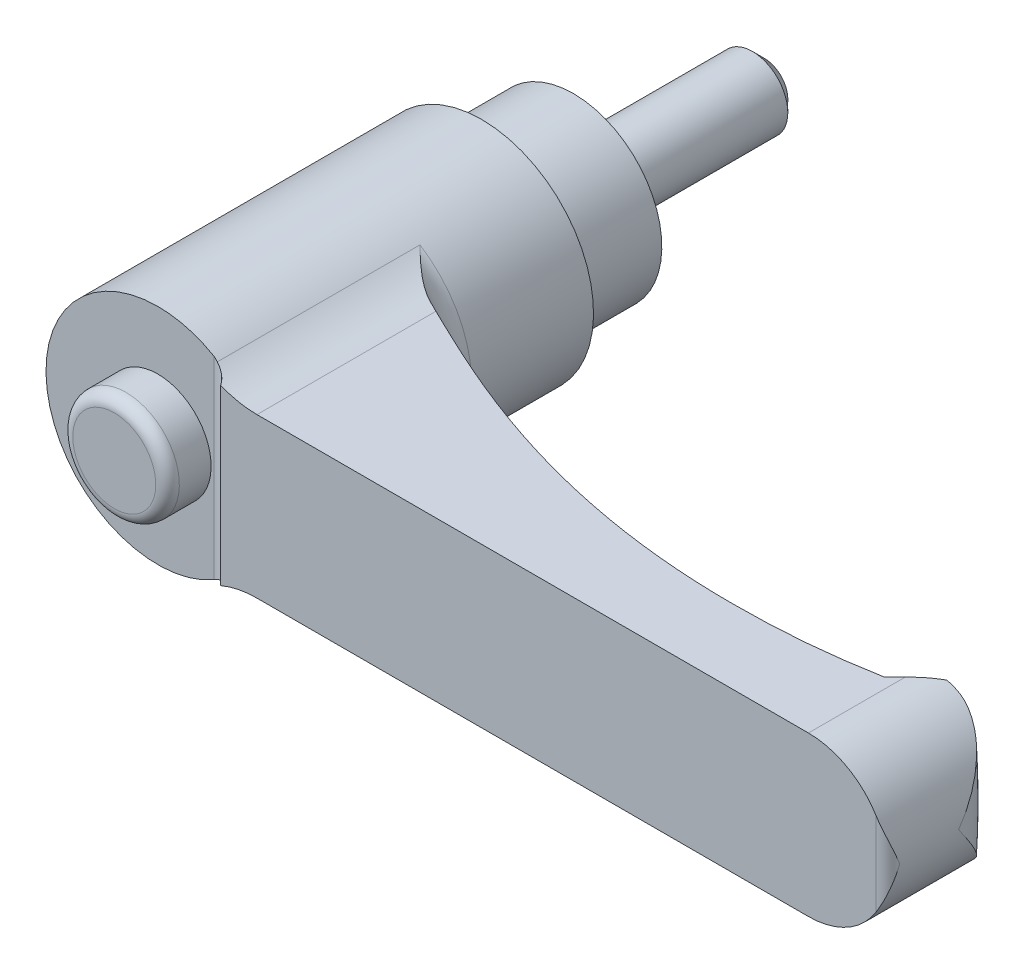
ISO-10303-21;
HEADER;
FILE_DESCRIPTION(('STEP AP214'),'2;1');
FILE_NAME('part.step','',(''),(''),'','','');
FILE_SCHEMA(('AUTOMOTIVE_DESIGN { 1 0 10303 214 1 1 1 1 }'));
ENDSEC;
DATA;
#1=APPLICATION_CONTEXT('core data for automotive mechanical design processes');
#2=APPLICATION_PROTOCOL_DEFINITION('international standard','automotive_design',2000,#1);
#3=PRODUCT_CONTEXT('',#1,'mechanical');
#4=PRODUCT('Part','Part','',(#3));
#5=PRODUCT_RELATED_PRODUCT_CATEGORY('part','',(#4));
#6=PRODUCT_DEFINITION_FORMATION('','',#4);
#7=PRODUCT_DEFINITION_CONTEXT('part definition',#1,'design');
#8=PRODUCT_DEFINITION('design','',#6,#7);
#9=PRODUCT_DEFINITION_SHAPE('','',#8);
#10=(LENGTH_UNIT() NAMED_UNIT(*) SI_UNIT(.MILLI.,.METRE.));
#11=(NAMED_UNIT(*) PLANE_ANGLE_UNIT() SI_UNIT($,.RADIAN.));
#12=(NAMED_UNIT(*) SI_UNIT($,.STERADIAN.) SOLID_ANGLE_UNIT());
#13=UNCERTAINTY_MEASURE_WITH_UNIT(LENGTH_MEASURE(1.E-05),#10,'distance_accuracy_value','');
#14=(GEOMETRIC_REPRESENTATION_CONTEXT(3) GLOBAL_UNCERTAINTY_ASSIGNED_CONTEXT((#13)) GLOBAL_UNIT_ASSIGNED_CONTEXT((#10,
#11,#12)) REPRESENTATION_CONTEXT('',''));
#15=CARTESIAN_POINT('',(0.,0.,0.));
#16=DIRECTION('',(0.,0.,1.));
#17=DIRECTION('',(1.,0.,0.));
#18=AXIS2_PLACEMENT_3D('',#15,#16,#17);
#19=CARTESIAN_POINT('',(6.,0.,0.));
#20=DIRECTION('',(0.,0.,1.));
#21=DIRECTION('',(0.,-1.,0.));
#22=AXIS2_PLACEMENT_3D('',#19,#20,#21);
#23=PLANE('',#22);
#24=CARTESIAN_POINT('',(0.,0.,0.));
#25=DIRECTION('',(0.,0.,-1.));
#26=DIRECTION('',(0.,1.,0.));
#27=AXIS2_PLACEMENT_3D('',#24,#25,#26);
#28=CIRCLE('',#27,3.);
#29=CARTESIAN_POINT('',(0.,3.,0.));
#30=VERTEX_POINT('',#29);
#31=EDGE_CURVE('E423',#30,#30,#28,.T.);
#32=ORIENTED_EDGE('',*,*,#31,.F.);
#33=EDGE_LOOP('',(#32));
#34=FACE_BOUND('',#33,.T.);
#35=CARTESIAN_POINT('',(0.,0.,0.));
#36=DIRECTION('',(0.,0.,-1.));
#37=DIRECTION('',(0.,1.,0.));
#38=AXIS2_PLACEMENT_3D('',#35,#36,#37);
#39=CIRCLE('',#38,6.);
#40=CARTESIAN_POINT('',(0.,6.,0.));
#41=VERTEX_POINT('',#40);
#42=EDGE_CURVE('E347',#41,#41,#39,.T.);
#43=ORIENTED_EDGE('',*,*,#42,.T.);
#44=EDGE_LOOP('',(#43));
#45=FACE_BOUND('',#44,.T.);
#46=ADVANCED_FACE('F14',(#34,#45),#23,.F.);
#47=CARTESIAN_POINT('',(0.,0.,35.5));
#48=DIRECTION('',(0.,0.,-1.));
#49=DIRECTION('',(0.,1.,0.));
#50=AXIS2_PLACEMENT_3D('',#47,#48,#49);
#51=PLANE('',#50);
#52=CARTESIAN_POINT('',(0.,0.,35.5));
#53=DIRECTION('',(0.,0.,-1.));
#54=DIRECTION('',(0.,1.,0.));
#55=AXIS2_PLACEMENT_3D('',#52,#53,#54);
#56=CIRCLE('',#55,9.5);
#57=CARTESIAN_POINT('',(4.75,-8.22724133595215,35.5));
#58=VERTEX_POINT('',#57);
#59=CARTESIAN_POINT('',(4.75,8.22724133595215,35.5));
#60=VERTEX_POINT('',#59);
#61=EDGE_CURVE('E332',#58,#60,#56,.T.);
#62=ORIENTED_EDGE('',*,*,#61,.F.);
#63=DIRECTION('',(0.,1.,0.));
#64=VECTOR('',#63,1.);
#65=CARTESIAN_POINT('',(4.75,-13.5,35.5));
#66=LINE('',#65,#64);
#67=EDGE_CURVE('E383',#58,#60,#66,.T.);
#68=ORIENTED_EDGE('',*,*,#67,.T.);
#69=EDGE_LOOP('',(#62,#68));
#70=FACE_BOUND('',#69,.T.);
#71=CARTESIAN_POINT('',(0.,0.,35.5));
#72=DIRECTION('',(0.,0.,-1.));
#73=DIRECTION('',(0.,1.,0.));
#74=AXIS2_PLACEMENT_3D('',#71,#72,#73);
#75=CIRCLE('',#74,4.52380952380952);
#76=CARTESIAN_POINT('',(0.,4.52380952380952,35.5));
#77=VERTEX_POINT('',#76);
#78=EDGE_CURVE('E183',#77,#77,#75,.F.);
#79=ORIENTED_EDGE('',*,*,#78,.F.);
#80=EDGE_LOOP('',(#79));
#81=FACE_BOUND('',#80,.T.);
#82=ADVANCED_FACE('F158',(#70,#81),#51,.F.);
#83=CARTESIAN_POINT('',(56.25,0.,0.));
#84=DIRECTION('',(0.,0.,1.));
#85=DIRECTION('',(0.,-1.,0.));
#86=AXIS2_PLACEMENT_3D('',#83,#84,#85);
#87=CYLINDRICAL_SURFACE('',#86,6.75);
#88=CARTESIAN_POINT('',(63.,0.,30.5));
#89=CARTESIAN_POINT('',(63.0000000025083,-0.0046874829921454,30.4965903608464));
#90=CARTESIAN_POINT('',(62.9999951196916,-0.0093750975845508,30.4931806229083));
#91=CARTESIAN_POINT('',(62.9990237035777,-0.475524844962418,30.1541065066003));
#92=CARTESIAN_POINT('',(62.9507141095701,-0.938185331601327,29.8175642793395));
#93=CARTESIAN_POINT('',(62.8060463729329,-1.62346497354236,29.3225480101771));
#94=CARTESIAN_POINT('',(62.7456147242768,-1.85084323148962,29.1588881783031));
#95=CARTESIAN_POINT('',(62.6000044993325,-2.30127271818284,28.8365968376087));
#96=CARTESIAN_POINT('',(62.5148384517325,-2.52432607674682,28.6779628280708));
#97=CARTESIAN_POINT('',(62.344804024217,-2.90644000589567,28.4087021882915));
#98=CARTESIAN_POINT('',(62.2657268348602,-3.06692788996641,28.2964051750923));
#99=CARTESIAN_POINT('',(62.0934111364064,-3.38371909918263,28.0768184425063));
#100=CARTESIAN_POINT('',(62.0001726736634,-3.5400224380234,27.9695287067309));
#101=CARTESIAN_POINT('',(61.7993668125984,-3.84715615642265,27.7614384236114));
#102=CARTESIAN_POINT('',(61.6918275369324,-3.99799655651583,27.6606257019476));
#103=CARTESIAN_POINT('',(61.4620426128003,-4.29326696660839,27.4668757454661));
#104=CARTESIAN_POINT('',(61.3398014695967,-4.43769892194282,27.3739361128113));
#105=CARTESIAN_POINT('',(61.0188552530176,-4.78536684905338,27.1560724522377));
#106=CARTESIAN_POINT('',(60.8112818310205,-4.9842025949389,27.0367418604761));
#107=CARTESIAN_POINT('',(60.4758984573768,-5.26551240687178,26.8795376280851));
#108=CARTESIAN_POINT('',(60.3601030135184,-5.35645651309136,26.8307690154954));
#109=CARTESIAN_POINT('',(60.1206554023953,-5.53195453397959,26.7416778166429));
#110=CARTESIAN_POINT('',(59.997005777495,-5.61651049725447,26.7013525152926));
#111=CARTESIAN_POINT('',(59.7699445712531,-5.76076929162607,26.6381973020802));
#112=CARTESIAN_POINT('',(59.667954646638,-5.82188686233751,26.6134697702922));
#113=CARTESIAN_POINT('',(59.4598154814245,-5.93917869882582,26.5707512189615));
#114=CARTESIAN_POINT('',(59.3536672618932,-5.99535416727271,26.5527585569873));
#115=CARTESIAN_POINT('',(59.1377410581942,-6.10229132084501,26.5242546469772));
#116=CARTESIAN_POINT('',(59.0279645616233,-6.15305518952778,26.5137403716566));
#117=CARTESIAN_POINT('',(58.8054681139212,-6.24873887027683,26.5009304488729));
#118=CARTESIAN_POINT('',(58.6927495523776,-6.29366138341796,26.4986309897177));
#119=CARTESIAN_POINT('',(58.4641163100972,-6.37770798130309,26.502966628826));
#120=CARTESIAN_POINT('',(58.3481815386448,-6.41677354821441,26.5096859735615));
#121=CARTESIAN_POINT('',(58.1152313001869,-6.48831686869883,26.5328398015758));
#122=CARTESIAN_POINT('',(57.9982157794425,-6.52079429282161,26.5492747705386));
#123=CARTESIAN_POINT('',(57.7644328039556,-6.57901960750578,26.5923251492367));
#124=CARTESIAN_POINT('',(57.6476652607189,-6.60477054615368,26.618935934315));
#125=CARTESIAN_POINT('',(57.41573023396,-6.64962508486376,26.6826067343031));
#126=CARTESIAN_POINT('',(57.3005622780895,-6.66873068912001,26.7196635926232));
#127=CARTESIAN_POINT('',(57.104290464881,-6.69624244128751,26.7926929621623));
#128=CARTESIAN_POINT('',(57.0224673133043,-6.70614558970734,26.8262017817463));
#129=CARTESIAN_POINT('',(56.8609556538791,-6.72278366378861,26.8986767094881));
#130=CARTESIAN_POINT('',(56.781266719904,-6.72951922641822,26.9376417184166));
#131=CARTESIAN_POINT('',(56.624433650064,-6.74006528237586,27.0209540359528));
#132=CARTESIAN_POINT('',(56.5472927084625,-6.74387222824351,27.0653077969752));
#133=CARTESIAN_POINT('',(56.3961054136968,-6.74884425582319,27.1591719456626));
#134=CARTESIAN_POINT('',(56.3220596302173,-6.75000885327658,27.2086832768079));
#135=CARTESIAN_POINT('',(56.2498,-6.74999999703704,27.2606710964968));
#136=B_SPLINE_CURVE_WITH_KNOTS('',3,(#88,#89,#90,#91,#92,#93,#94,#95,#96,#97,#98,#99,#100,#101,
#102,#103,#104,#105,#106,#107,#108,#109,#110,#111,#112,#113,#114,#115,#116,#117,#118,#119,#120,
#121,#122,#123,#124,#125,#126,#127,#128,#129,#130,#131,#132,#133,#134,#135),.UNSPECIFIED.,.F.,
.F.,(4,2,2,2,2,2,2,2,2,2,2,2,2,2,2,2,2,2,2,2,2,2,2,4),(0.,0.0173896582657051,1.7292315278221,
2.5882674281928,3.44686895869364,4.08007105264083,4.71327107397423,5.34524382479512,
5.97702340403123,6.9068284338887,7.37170994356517,7.83644173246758,8.20045511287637,
8.56437966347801,8.92815681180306,9.29176514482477,9.65879376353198,10.0258407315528,
10.3927210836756,10.7594906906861,11.0261722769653,11.2928002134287,11.5597506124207,
11.8267499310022),.UNSPECIFIED.);
#137=CARTESIAN_POINT('',(58.6622222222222,-6.30425919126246,26.5));
#138=VERTEX_POINT('',#137);
#139=CARTESIAN_POINT('',(63.,0.,30.5));
#140=VERTEX_POINT('',#139);
#141=EDGE_CURVE('E126',#138,#140,#136,.F.);
#142=ORIENTED_EDGE('',*,*,#141,.T.);
#143=CARTESIAN_POINT('',(63.,0.,30.5));
#144=CARTESIAN_POINT('',(63.0000000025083,0.00468748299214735,30.4965903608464));
#145=CARTESIAN_POINT('',(62.9999951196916,0.00937509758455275,30.4931806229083));
#146=CARTESIAN_POINT('',(62.9990237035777,0.47552484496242,30.1541065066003));
#147=CARTESIAN_POINT('',(62.9507141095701,0.938185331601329,29.8175642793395));
#148=CARTESIAN_POINT('',(62.8060463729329,1.62346497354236,29.3225480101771));
#149=CARTESIAN_POINT('',(62.7456147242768,1.85084323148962,29.1588881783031));
#150=CARTESIAN_POINT('',(62.6000044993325,2.30127271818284,28.8365968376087));
#151=CARTESIAN_POINT('',(62.5148384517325,2.52432607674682,28.6779628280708));
#152=CARTESIAN_POINT('',(62.344804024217,2.90644000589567,28.4087021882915));
#153=CARTESIAN_POINT('',(62.2657268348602,3.06692788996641,28.2964051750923));
#154=CARTESIAN_POINT('',(62.0934111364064,3.38371909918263,28.0768184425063));
#155=CARTESIAN_POINT('',(62.0001726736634,3.5400224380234,27.9695287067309));
#156=CARTESIAN_POINT('',(61.7993668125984,3.84715615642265,27.7614384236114));
#157=CARTESIAN_POINT('',(61.6918275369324,3.99799655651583,27.6606257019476));
#158=CARTESIAN_POINT('',(61.4620426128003,4.29326696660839,27.4668757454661));
#159=CARTESIAN_POINT('',(61.3398014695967,4.43769892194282,27.3739361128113));
#160=CARTESIAN_POINT('',(61.0188552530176,4.78536684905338,27.1560724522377));
#161=CARTESIAN_POINT('',(60.8112818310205,4.9842025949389,27.0367418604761));
#162=CARTESIAN_POINT('',(60.4758984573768,5.26551240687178,26.8795376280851));
#163=CARTESIAN_POINT('',(60.3601030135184,5.35645651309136,26.8307690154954));
#164=CARTESIAN_POINT('',(60.1206554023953,5.53195453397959,26.7416778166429));
#165=CARTESIAN_POINT('',(59.997005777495,5.61651049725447,26.7013525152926));
#166=CARTESIAN_POINT('',(59.7699445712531,5.76076929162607,26.6381973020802));
#167=CARTESIAN_POINT('',(59.667954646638,5.82188686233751,26.6134697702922));
#168=CARTESIAN_POINT('',(59.4598154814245,5.93917869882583,26.5707512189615));
#169=CARTESIAN_POINT('',(59.3536672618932,5.99535416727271,26.5527585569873));
#170=CARTESIAN_POINT('',(59.1377410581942,6.10229132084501,26.5242546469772));
#171=CARTESIAN_POINT('',(59.0279645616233,6.15305518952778,26.5137403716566));
#172=CARTESIAN_POINT('',(58.8054681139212,6.24873887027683,26.5009304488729));
#173=CARTESIAN_POINT('',(58.6927495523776,6.29366138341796,26.4986309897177));
#174=CARTESIAN_POINT('',(58.4641163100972,6.37770798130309,26.502966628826));
#175=CARTESIAN_POINT('',(58.3481815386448,6.41677354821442,26.5096859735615));
#176=CARTESIAN_POINT('',(58.1152313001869,6.48831686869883,26.5328398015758));
#177=CARTESIAN_POINT('',(57.9982157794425,6.52079429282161,26.5492747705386));
#178=CARTESIAN_POINT('',(57.7644328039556,6.57901960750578,26.5923251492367));
#179=CARTESIAN_POINT('',(57.6476652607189,6.60477054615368,26.618935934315));
#180=CARTESIAN_POINT('',(57.41573023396,6.64962508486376,26.6826067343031));
#181=CARTESIAN_POINT('',(57.3005622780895,6.66873068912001,26.7196635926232));
#182=CARTESIAN_POINT('',(57.1042904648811,6.69624244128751,26.7926929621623));
#183=CARTESIAN_POINT('',(57.0224673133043,6.70614558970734,26.8262017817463));
#184=CARTESIAN_POINT('',(56.8609556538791,6.72278366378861,26.8986767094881));
#185=CARTESIAN_POINT('',(56.781266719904,6.72951922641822,26.9376417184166));
#186=CARTESIAN_POINT('',(56.624433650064,6.74006528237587,27.0209540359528));
#187=CARTESIAN_POINT('',(56.5472927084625,6.74387222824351,27.0653077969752));
#188=CARTESIAN_POINT('',(56.3961054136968,6.74884425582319,27.1591719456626));
#189=CARTESIAN_POINT('',(56.3220596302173,6.75000885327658,27.2086832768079));
#190=CARTESIAN_POINT('',(56.2498,6.74999999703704,27.2606710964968));
#191=B_SPLINE_CURVE_WITH_KNOTS('',3,(#143,#144,#145,#146,#147,#148,#149,#150,#151,#152,#153,
#154,#155,#156,#157,#158,#159,#160,#161,#162,#163,#164,#165,#166,#167,#168,#169,#170,#171,#172,
#173,#174,#175,#176,#177,#178,#179,#180,#181,#182,#183,#184,#185,#186,#187,#188,#189,#190),
.UNSPECIFIED.,.F.,.F.,(4,2,2,2,2,2,2,2,2,2,2,2,2,2,2,2,2,2,2,2,2,2,2,4),(0.,0.0173896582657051,
1.7292315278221,2.5882674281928,3.44686895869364,4.08007105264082,4.71327107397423,
5.34524382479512,5.97702340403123,6.9068284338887,7.37170994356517,7.83644173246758,
8.20045511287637,8.56437966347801,8.92815681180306,9.29176514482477,9.65879376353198,
10.0258407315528,10.3927210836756,10.7594906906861,11.0261722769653,11.2928002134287,
11.5597506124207,11.8267499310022),.UNSPECIFIED.);
#192=CARTESIAN_POINT('',(58.6622222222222,6.30425919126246,26.5));
#193=VERTEX_POINT('',#192);
#194=EDGE_CURVE('E123',#140,#193,#191,.T.);
#195=ORIENTED_EDGE('',*,*,#194,.T.);
#196=CARTESIAN_POINT('',(56.25,0.,26.5));
#197=DIRECTION('',(0.,0.,-1.));
#198=DIRECTION('',(0.,1.,0.));
#199=AXIS2_PLACEMENT_3D('',#196,#197,#198);
#200=CIRCLE('',#199,6.75);
#201=CARTESIAN_POINT('',(58.,6.51920240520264,26.5));
#202=VERTEX_POINT('',#201);
#203=EDGE_CURVE('E308',#193,#202,#200,.F.);
#204=ORIENTED_EDGE('',*,*,#203,.T.);
#205=CARTESIAN_POINT('',(56.25,0.,28.25));
#206=DIRECTION('',(-0.707106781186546,0.,-0.70710678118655));
#207=DIRECTION('',(-0.70710678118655,0.,0.707106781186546));
#208=AXIS2_PLACEMENT_3D('',#205,#206,#207);
#209=ELLIPSE('',#208,9.54594154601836,6.75);
#210=CARTESIAN_POINT('',(56.25,6.75,28.25));
#211=VERTEX_POINT('',#210);
#212=EDGE_CURVE('E374',#202,#211,#209,.F.);
#213=ORIENTED_EDGE('',*,*,#212,.T.);
#214=DIRECTION('',(0.,0.,1.));
#215=VECTOR('',#214,1.);
#216=CARTESIAN_POINT('',(56.25,6.75,0.));
#217=LINE('',#216,#215);
#218=CARTESIAN_POINT('',(56.25,6.75,36.5));
#219=VERTEX_POINT('',#218);
#220=EDGE_CURVE('E330',#211,#219,#217,.T.);
#221=ORIENTED_EDGE('',*,*,#220,.T.);
#222=CARTESIAN_POINT('',(56.25,0.,36.5));
#223=DIRECTION('',(0.,0.,1.));
#224=DIRECTION('',(0.,-1.,0.));
#225=AXIS2_PLACEMENT_3D('',#222,#223,#224);
#226=CIRCLE('',#225,6.75);
#227=CARTESIAN_POINT('',(62.,3.53553390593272,36.5));
#228=VERTEX_POINT('',#227);
#229=EDGE_CURVE('E322',#228,#219,#226,.T.);
#230=ORIENTED_EDGE('',*,*,#229,.F.);
#231=CARTESIAN_POINT('',(62.,3.53553390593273,36.5));
#232=CARTESIAN_POINT('',(62.0299932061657,3.48675666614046,36.4999933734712));
#233=CARTESIAN_POINT('',(62.0593538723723,3.43761273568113,36.4986515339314));
#234=CARTESIAN_POINT('',(62.1167538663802,3.33870692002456,36.4935798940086));
#235=CARTESIAN_POINT('',(62.1447937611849,3.28894531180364,36.489851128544));
#236=CARTESIAN_POINT('',(62.2267562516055,3.13908056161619,36.4755285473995));
#237=CARTESIAN_POINT('',(62.2786643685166,3.03816514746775,36.4617957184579));
#238=CARTESIAN_POINT('',(62.3766467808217,2.83536966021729,36.4277987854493));
#239=CARTESIAN_POINT('',(62.4227515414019,2.73349792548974,36.4075709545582));
#240=CARTESIAN_POINT('',(62.509502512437,2.52854152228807,36.3618646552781));
#241=CARTESIAN_POINT('',(62.550144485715,2.42545597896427,36.3363821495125));
#242=CARTESIAN_POINT('',(62.6493297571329,2.15471359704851,36.2642737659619));
#243=CARTESIAN_POINT('',(62.7035065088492,1.98634279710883,36.2142841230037));
#244=CARTESIAN_POINT('',(62.7980553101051,1.64812969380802,36.1068184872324));
#245=CARTESIAN_POINT('',(62.8384218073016,1.4782868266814,36.0493394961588));
#246=CARTESIAN_POINT('',(62.9057483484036,1.1374266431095,35.9293690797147));
#247=CARTESIAN_POINT('',(62.9326868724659,0.966407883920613,35.8668697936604));
#248=CARTESIAN_POINT('',(62.9733111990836,0.623942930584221,35.7390768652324));
#249=CARTESIAN_POINT('',(62.9870036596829,0.452496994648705,35.6737846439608));
#250=CARTESIAN_POINT('',(62.997837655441,0.192449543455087,35.5740662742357));
#251=CARTESIAN_POINT('',(62.999781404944,0.103891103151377,35.539987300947));
#252=CARTESIAN_POINT('',(62.9999941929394,0.0102233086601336,35.5039349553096));
#253=CARTESIAN_POINT('',(62.9999999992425,0.00511164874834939,35.5019674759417));
#254=CARTESIAN_POINT('',(63.,0.,35.5));
#255=B_SPLINE_CURVE_WITH_KNOTS('',3,(#231,#232,#233,#234,#235,#236,#237,#238,#239,#240,#241,
#242,#243,#244,#245,#246,#247,#248,#249,#250,#251,#252,#253,#254),.UNSPECIFIED.,.F.,.F.,(4,2,2,
2,2,2,2,2,2,2,2,4),(0.,0.171732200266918,0.343389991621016,0.685890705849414,1.02651095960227,
1.36739390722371,1.91796289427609,2.46875297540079,3.02042294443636,3.57181547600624,
3.85648313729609,3.87291482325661),.UNSPECIFIED.);
#256=CARTESIAN_POINT('',(63.,0.,35.5));
#257=VERTEX_POINT('',#256);
#258=EDGE_CURVE('E169',#257,#228,#255,.F.);
#259=ORIENTED_EDGE('',*,*,#258,.F.);
#260=CARTESIAN_POINT('',(62.,-3.53553390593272,36.5));
#261=CARTESIAN_POINT('',(62.0299932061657,-3.48675666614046,36.4999933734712));
#262=CARTESIAN_POINT('',(62.0593538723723,-3.43761273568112,36.4986515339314));
#263=CARTESIAN_POINT('',(62.1167538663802,-3.33870692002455,36.4935798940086));
#264=CARTESIAN_POINT('',(62.1447937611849,-3.28894531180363,36.489851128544));
#265=CARTESIAN_POINT('',(62.2267562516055,-3.13908056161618,36.4755285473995));
#266=CARTESIAN_POINT('',(62.2786643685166,-3.03816514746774,36.4617957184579));
#267=CARTESIAN_POINT('',(62.3766467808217,-2.83536966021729,36.4277987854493));
#268=CARTESIAN_POINT('',(62.4227515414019,-2.73349792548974,36.4075709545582));
#269=CARTESIAN_POINT('',(62.509502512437,-2.52854152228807,36.3618646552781));
#270=CARTESIAN_POINT('',(62.550144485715,-2.42545597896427,36.3363821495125));
#271=CARTESIAN_POINT('',(62.6493297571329,-2.15471359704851,36.2642737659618));
#272=CARTESIAN_POINT('',(62.7035065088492,-1.98634279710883,36.2142841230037));
#273=CARTESIAN_POINT('',(62.7980553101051,-1.64812969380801,36.1068184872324));
#274=CARTESIAN_POINT('',(62.8384218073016,-1.4782868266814,36.0493394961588));
#275=CARTESIAN_POINT('',(62.9057483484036,-1.1374266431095,35.9293690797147));
#276=CARTESIAN_POINT('',(62.9326868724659,-0.966407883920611,35.8668697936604));
#277=CARTESIAN_POINT('',(62.9733111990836,-0.623942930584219,35.7390768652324));
#278=CARTESIAN_POINT('',(62.9870036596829,-0.452496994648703,35.6737846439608));
#279=CARTESIAN_POINT('',(62.997837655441,-0.192449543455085,35.5740662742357));
#280=CARTESIAN_POINT('',(62.999781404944,-0.103891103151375,35.539987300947));
#281=CARTESIAN_POINT('',(62.9999941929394,-0.0102233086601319,35.5039349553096));
#282=CARTESIAN_POINT('',(62.9999999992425,-0.00511164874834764,35.5019674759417));
#283=CARTESIAN_POINT('',(63.,0.,35.5));
#284=B_SPLINE_CURVE_WITH_KNOTS('',3,(#260,#261,#262,#263,#264,#265,#266,#267,#268,#269,#270,
#271,#272,#273,#274,#275,#276,#277,#278,#279,#280,#281,#282,#283),.UNSPECIFIED.,.F.,.F.,(4,2,2,
2,2,2,2,2,2,2,2,4),(0.,0.171732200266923,0.34338999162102,0.685890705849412,1.02651095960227,
1.36739390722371,1.91796289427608,2.46875297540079,3.02042294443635,3.57181547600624,
3.85648313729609,3.8729148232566),.UNSPECIFIED.);
#285=CARTESIAN_POINT('',(62.,-3.53553390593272,36.5));
#286=VERTEX_POINT('',#285);
#287=EDGE_CURVE('E177',#286,#257,#284,.T.);
#288=ORIENTED_EDGE('',*,*,#287,.F.);
#289=CARTESIAN_POINT('',(56.25,-6.75,36.5));
#290=VERTEX_POINT('',#289);
#291=EDGE_CURVE('E310',#290,#286,#226,.T.);
#292=ORIENTED_EDGE('',*,*,#291,.F.);
#293=DIRECTION('',(0.,0.,1.));
#294=VECTOR('',#293,1.);
#295=CARTESIAN_POINT('',(56.25,-6.75,0.));
#296=LINE('',#295,#294);
#297=CARTESIAN_POINT('',(56.25,-6.75,28.25));
#298=VERTEX_POINT('',#297);
#299=EDGE_CURVE('E355',#298,#290,#296,.T.);
#300=ORIENTED_EDGE('',*,*,#299,.F.);
#301=CARTESIAN_POINT('',(58.,-6.51920240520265,26.5));
#302=VERTEX_POINT('',#301);
#303=EDGE_CURVE('E375',#298,#302,#209,.F.);
#304=ORIENTED_EDGE('',*,*,#303,.T.);
#305=EDGE_CURVE('E134',#302,#138,#200,.F.);
#306=ORIENTED_EDGE('',*,*,#305,.T.);
#307=EDGE_LOOP('',(#142,#195,#204,#213,#221,#230,#259,#288,#292,#300,#304,#306));
#308=FACE_BOUND('',#307,.T.);
#309=ADVANCED_FACE('F132',(#308),#87,.T.);
#310=CARTESIAN_POINT('',(59.,-13.5,26.5));
#311=DIRECTION('',(0.,0.,-1.));
#312=DIRECTION('',(0.,1.,0.));
#313=AXIS2_PLACEMENT_3D('',#310,#311,#312);
#314=PLANE('',#313);
#315=ORIENTED_EDGE('',*,*,#203,.F.);
#316=CARTESIAN_POINT('',(0.,0.,26.5));
#317=DIRECTION('',(0.,0.,-1.));
#318=DIRECTION('',(0.,1.,0.));
#319=AXIS2_PLACEMENT_3D('',#316,#317,#318);
#320=CIRCLE('',#319,59.);
#321=EDGE_CURVE('E37',#193,#138,#320,.T.);
#322=ORIENTED_EDGE('',*,*,#321,.T.);
#323=ORIENTED_EDGE('',*,*,#305,.F.);
#324=DIRECTION('',(0.,1.,0.));
#325=VECTOR('',#324,1.);
#326=CARTESIAN_POINT('',(58.,-13.5,26.5));
#327=LINE('',#326,#325);
#328=EDGE_CURVE('E327',#302,#202,#327,.T.);
#329=ORIENTED_EDGE('',*,*,#328,.T.);
#330=EDGE_LOOP('',(#315,#322,#323,#329));
#331=FACE_BOUND('',#330,.T.);
#332=ADVANCED_FACE('F157',(#331),#314,.T.);
#333=CARTESIAN_POINT('',(0.,0.,36.5));
#334=DIRECTION('',(0.,0.,1.));
#335=DIRECTION('',(0.,-1.,0.));
#336=AXIS2_PLACEMENT_3D('',#333,#334,#335);
#337=PLANE('',#336);
#338=CARTESIAN_POINT('',(9.41740410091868,14.75,36.5));
#339=DIRECTION('',(0.,0.,1.));
#340=DIRECTION('',(1.,0.,0.));
#341=AXIS2_PLACEMENT_3D('',#338,#339,#340);
#342=CIRCLE('',#341,8.);
#343=CARTESIAN_POINT('',(6.33333333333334,7.36836688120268,36.5));
#344=VERTEX_POINT('',#343);
#345=CARTESIAN_POINT('',(9.41740410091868,6.75,36.5));
#346=VERTEX_POINT('',#345);
#347=EDGE_CURVE('E369',#344,#346,#342,.T.);
#348=ORIENTED_EDGE('',*,*,#347,.F.);
#349=DIRECTION('',(0.,1.,0.));
#350=VECTOR('',#349,1.);
#351=CARTESIAN_POINT('',(6.33333333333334,-13.5,36.5));
#352=LINE('',#351,#350);
#353=CARTESIAN_POINT('',(6.33333333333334,-7.36836688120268,36.5));
#354=VERTEX_POINT('',#353);
#355=EDGE_CURVE('E326',#354,#344,#352,.T.);
#356=ORIENTED_EDGE('',*,*,#355,.F.);
#357=CARTESIAN_POINT('',(9.41740410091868,-14.75,36.5));
#358=DIRECTION('',(0.,0.,1.));
#359=DIRECTION('',(1.,0.,0.));
#360=AXIS2_PLACEMENT_3D('',#357,#358,#359);
#361=CIRCLE('',#360,8.);
#362=CARTESIAN_POINT('',(9.41740410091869,-6.75,36.5));
#363=VERTEX_POINT('',#362);
#364=EDGE_CURVE('E361',#363,#354,#361,.T.);
#365=ORIENTED_EDGE('',*,*,#364,.F.);
#366=DIRECTION('',(-1.,0.,0.));
#367=VECTOR('',#366,1.);
#368=CARTESIAN_POINT('',(56.25,-6.75,36.5));
#369=LINE('',#368,#367);
#370=EDGE_CURVE('E364',#290,#363,#369,.T.);
#371=ORIENTED_EDGE('',*,*,#370,.F.);
#372=ORIENTED_EDGE('',*,*,#291,.T.);
#373=DIRECTION('',(0.,1.,0.));
#374=VECTOR('',#373,1.);
#375=CARTESIAN_POINT('',(62.,-13.5,36.5));
#376=LINE('',#375,#374);
#377=EDGE_CURVE('E315',#286,#228,#376,.T.);
#378=ORIENTED_EDGE('',*,*,#377,.T.);
#379=ORIENTED_EDGE('',*,*,#229,.T.);
#380=DIRECTION('',(1.,0.,0.));
#381=VECTOR('',#380,1.);
#382=CARTESIAN_POINT('',(9.41740410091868,6.75,36.5));
#383=LINE('',#382,#381);
#384=EDGE_CURVE('E367',#346,#219,#383,.T.);
#385=ORIENTED_EDGE('',*,*,#384,.F.);
#386=EDGE_LOOP('',(#348,#356,#365,#371,#372,#378,#379,#385));
#387=FACE_BOUND('',#386,.T.);
#388=ADVANCED_FACE('F240',(#387),#337,.T.);
#389=CARTESIAN_POINT('',(0.,0.,0.));
#390=DIRECTION('',(0.,0.,-1.));
#391=DIRECTION('',(0.,1.,0.));
#392=AXIS2_PLACEMENT_3D('',#389,#390,#391);
#393=CYLINDRICAL_SURFACE('',#392,9.5);
#394=CARTESIAN_POINT('',(0.,0.,18.3481601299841));
#395=DIRECTION('',(0.,0.,-1.));
#396=DIRECTION('',(0.,1.,0.));
#397=AXIS2_PLACEMENT_3D('',#394,#395,#396);
#398=CIRCLE('',#397,9.5);
#399=CARTESIAN_POINT('',(5.11230508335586,8.00714285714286,18.3481601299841));
#400=VERTEX_POINT('',#399);
#401=CARTESIAN_POINT('',(5.11230508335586,-8.00714285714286,18.3481601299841));
#402=VERTEX_POINT('',#401);
#403=EDGE_CURVE('E413',#400,#402,#398,.T.);
#404=ORIENTED_EDGE('',*,*,#403,.T.);
#405=DIRECTION('',(0.,0.,1.));
#406=VECTOR('',#405,1.);
#407=CARTESIAN_POINT('',(5.11230508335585,-8.00714285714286,0.));
#408=LINE('',#407,#406);
#409=CARTESIAN_POINT('',(5.11230508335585,-8.00714285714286,35.5614827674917));
#410=VERTEX_POINT('',#409);
#411=EDGE_CURVE('E359',#402,#410,#408,.T.);
#412=ORIENTED_EDGE('',*,*,#411,.T.);
#413=CARTESIAN_POINT('',(4.75,-8.22724133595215,35.5));
#414=CARTESIAN_POINT('',(4.82354897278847,-8.18479174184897,35.5056127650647));
#415=CARTESIAN_POINT('',(4.89626028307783,-8.1414834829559,35.5152432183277));
#416=CARTESIAN_POINT('',(5.03945202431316,-8.05362753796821,35.5421901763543));
#417=CARTESIAN_POINT('',(5.10993308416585,-8.00908020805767,35.5595044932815));
#418=CARTESIAN_POINT('',(5.24861636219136,-7.91889687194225,35.6016146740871));
#419=CARTESIAN_POINT('',(5.31680005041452,-7.87325555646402,35.6264601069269));
#420=CARTESIAN_POINT('',(5.44990684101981,-7.7817124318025,35.6832973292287));
#421=CARTESIAN_POINT('',(5.51483003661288,-7.7358106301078,35.7152889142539));
#422=CARTESIAN_POINT('',(5.69141984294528,-7.6077148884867,35.8145402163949));
#423=CARTESIAN_POINT('',(5.79903338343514,-7.52579740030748,35.8895684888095));
#424=CARTESIAN_POINT('',(5.99917718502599,-7.36722875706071,36.0610902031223));
#425=CARTESIAN_POINT('',(6.09178179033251,-7.29055280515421,36.157471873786));
#426=CARTESIAN_POINT('',(6.20382113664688,-7.19472379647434,36.3011658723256));
#427=CARTESIAN_POINT('',(6.23139044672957,-7.17084441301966,36.33916914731));
#428=CARTESIAN_POINT('',(6.28417716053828,-7.12462925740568,36.4176957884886));
#429=CARTESIAN_POINT('',(6.30939340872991,-7.1022942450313,36.4582203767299));
#430=CARTESIAN_POINT('',(6.33333333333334,-7.08088192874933,36.5));
#431=B_SPLINE_CURVE_WITH_KNOTS('',3,(#413,#414,#415,#416,#417,#418,#419,#420,#421,#422,#423,
#424,#425,#426,#427,#428,#429,#430),.UNSPECIFIED.,.F.,.F.,(4,2,2,2,2,2,2,2,4),(0.,
0.25516766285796,0.510262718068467,0.767074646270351,1.02387922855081,1.48566336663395,
1.94508518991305,2.10299549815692,2.26098294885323),.UNSPECIFIED.);
#432=EDGE_CURVE('E214',#58,#410,#431,.T.);
#433=ORIENTED_EDGE('',*,*,#432,.F.);
#434=ORIENTED_EDGE('',*,*,#61,.T.);
#435=CARTESIAN_POINT('',(6.33333333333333,7.08088192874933,36.5));
#436=CARTESIAN_POINT('',(6.30193651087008,7.10896982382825,36.4452145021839));
#437=CARTESIAN_POINT('',(6.26833956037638,7.13863883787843,36.3925689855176));
#438=CARTESIAN_POINT('',(6.19723055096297,7.20045324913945,36.2916619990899));
#439=CARTESIAN_POINT('',(6.15972345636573,7.23259549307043,36.243395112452));
#440=CARTESIAN_POINT('',(6.08131079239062,7.2986494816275,36.1513438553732));
#441=CARTESIAN_POINT('',(6.04041526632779,7.33255589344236,36.1075470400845));
#442=CARTESIAN_POINT('',(5.95546899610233,7.40171574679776,36.0242830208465));
#443=CARTESIAN_POINT('',(5.91141716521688,7.4369696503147,35.9848173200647));
#444=CARTESIAN_POINT('',(5.7754647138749,7.54368484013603,35.8733623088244));
#445=CARTESIAN_POINT('',(5.67929205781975,7.61650473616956,35.8077657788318));
#446=CARTESIAN_POINT('',(5.47750803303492,7.76289095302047,35.6942705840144));
#447=CARTESIAN_POINT('',(5.37189158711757,7.83645765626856,35.6463815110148));
#448=CARTESIAN_POINT('',(5.1806466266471,7.96370194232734,35.5790108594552));
#449=CARTESIAN_POINT('',(5.09668204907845,8.01772299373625,35.5554125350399));
#450=CARTESIAN_POINT('',(4.92555498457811,8.12398585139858,35.5192948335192));
#451=CARTESIAN_POINT('',(4.83839896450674,8.17623088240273,35.5067542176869));
#452=CARTESIAN_POINT('',(4.75,8.22724133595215,35.5));
#453=B_SPLINE_CURVE_WITH_KNOTS('',3,(#435,#436,#437,#438,#439,#440,#441,#442,#443,#444,#445,
#446,#447,#448,#449,#450,#451,#452),.UNSPECIFIED.,.F.,.F.,(4,2,2,2,2,2,2,2,4),(0.,
0.207163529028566,0.414067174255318,0.620378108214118,0.826760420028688,1.23705708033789,
1.64757566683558,1.9547198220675,2.26127274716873),.UNSPECIFIED.);
#454=CARTESIAN_POINT('',(5.11230508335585,8.00714285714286,35.5614827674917));
#455=VERTEX_POINT('',#454);
#456=EDGE_CURVE('E228',#455,#60,#453,.T.);
#457=ORIENTED_EDGE('',*,*,#456,.F.);
#458=DIRECTION('',(0.,0.,1.));
#459=VECTOR('',#458,1.);
#460=CARTESIAN_POINT('',(5.11230508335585,8.00714285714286,0.));
#461=LINE('',#460,#459);
#462=EDGE_CURVE('E350',#400,#455,#461,.T.);
#463=ORIENTED_EDGE('',*,*,#462,.F.);
#464=EDGE_LOOP('',(#404,#412,#433,#434,#457,#463));
#465=FACE_BOUND('',#464,.T.);
#466=CARTESIAN_POINT('',(0.,0.,8.));
#467=DIRECTION('',(0.,0.,-1.));
#468=DIRECTION('',(0.,1.,0.));
#469=AXIS2_PLACEMENT_3D('',#466,#467,#468);
#470=CIRCLE('',#469,9.5);
#471=CARTESIAN_POINT('',(0.,9.5,8.));
#472=VERTEX_POINT('',#471);
#473=EDGE_CURVE('E333',#472,#472,#470,.T.);
#474=ORIENTED_EDGE('',*,*,#473,.F.);
#475=EDGE_LOOP('',(#474));
#476=FACE_BOUND('',#475,.T.);
#477=ADVANCED_FACE('F238',(#465,#476),#393,.T.);
#478=CARTESIAN_POINT('',(9.41740410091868,14.75,0.));
#479=DIRECTION('',(0.,0.,1.));
#480=DIRECTION('',(0.,-1.,0.));
#481=AXIS2_PLACEMENT_3D('',#478,#479,#480);
#482=CYLINDRICAL_SURFACE('',#481,8.);
#483=DIRECTION('',(0.,0.,1.));
#484=VECTOR('',#483,1.);
#485=CARTESIAN_POINT('',(9.41740410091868,6.75,0.));
#486=LINE('',#485,#484);
#487=CARTESIAN_POINT('',(9.41740410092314,6.75,21.3021638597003));
#488=VERTEX_POINT('',#487);
#489=EDGE_CURVE('E352',#488,#346,#486,.T.);
#490=ORIENTED_EDGE('',*,*,#489,.F.);
#491=CARTESIAN_POINT('',(9.41760410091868,6.7500000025,21.3022609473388));
#492=CARTESIAN_POINT('',(9.34663199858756,6.74999859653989,21.2678090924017));
#493=CARTESIAN_POINT('',(9.27552780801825,6.75094090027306,21.2336266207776));
#494=CARTESIAN_POINT('',(9.13312349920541,6.75473540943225,21.1659081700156));
#495=CARTESIAN_POINT('',(9.06182355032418,6.75758629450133,21.1323717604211));
#496=CARTESIAN_POINT('',(8.91899698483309,6.7652204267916,21.066004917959));
#497=CARTESIAN_POINT('',(8.84747036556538,6.77000369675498,21.0331744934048));
#498=CARTESIAN_POINT('',(8.704162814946,6.78153362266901,20.9682923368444));
#499=CARTESIAN_POINT('',(8.63238174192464,6.78828163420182,20.9362411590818));
#500=CARTESIAN_POINT('',(8.56050869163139,6.79602424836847,20.9046385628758));
#501=B_SPLINE_CURVE_WITH_KNOTS('',3,(#491,#492,#493,#494,#495,#496,#497,#498,#499,#500),
.UNSPECIFIED.,.F.,.F.,(4,2,2,2,4),(0.,0.236671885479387,0.473180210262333,0.709691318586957,
0.946365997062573),.UNSPECIFIED.);
#502=CARTESIAN_POINT('',(8.56096354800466,6.79597525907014,20.9048385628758));
#503=VERTEX_POINT('',#502);
#504=EDGE_CURVE('E246',#488,#503,#501,.T.);
#505=ORIENTED_EDGE('',*,*,#504,.T.);
#506=CARTESIAN_POINT('',(8.56141843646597,6.79592629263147,20.9050385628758));
#507=CARTESIAN_POINT('',(8.47420918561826,6.80531273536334,20.8666951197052));
#508=CARTESIAN_POINT('',(8.38798367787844,6.81604134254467,20.8265142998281));
#509=CARTESIAN_POINT('',(8.21753113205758,6.84002445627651,20.7428900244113));
#510=CARTESIAN_POINT('',(8.13330325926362,6.85327788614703,20.6994479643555));
#511=CARTESIAN_POINT('',(7.88393651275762,6.89653514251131,20.5650030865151));
#512=CARTESIAN_POINT('',(7.72171249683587,6.9300806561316,20.4697011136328));
#513=CARTESIAN_POINT('',(7.40583761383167,7.00533652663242,20.2709379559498));
#514=CARTESIAN_POINT('',(7.25214096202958,7.0469964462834,20.1675294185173));
#515=CARTESIAN_POINT('',(6.95163567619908,7.13786246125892,19.9540740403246));
#516=CARTESIAN_POINT('',(6.80483124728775,7.18707308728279,19.8440232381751));
#517=CARTESIAN_POINT('',(6.52235248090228,7.29074005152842,19.6227797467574));
#518=CARTESIAN_POINT('',(6.38647079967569,7.34497015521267,19.5117441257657));
#519=CARTESIAN_POINT('',(6.12012077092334,7.45966750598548,19.286442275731));
#520=CARTESIAN_POINT('',(5.98965290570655,7.5201353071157,19.1721757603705));
#521=CARTESIAN_POINT('',(5.73356790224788,7.64719834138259,18.9415280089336));
#522=CARTESIAN_POINT('',(5.60795285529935,7.71379617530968,18.825145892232));
#523=CARTESIAN_POINT('',(5.36116691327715,7.853115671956,18.5913699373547));
#524=CARTESIAN_POINT('',(5.23999538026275,7.92583645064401,18.4739762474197));
#525=CARTESIAN_POINT('',(5.11800178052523,8.00350824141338,18.3537764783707));
#526=CARTESIAN_POINT('',(5.11515285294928,8.00532465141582,18.3509683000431));
#527=CARTESIAN_POINT('',(5.11230508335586,8.00714285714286,18.3481601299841));
#528=B_SPLINE_CURVE_WITH_KNOTS('',3,(#506,#507,#508,#509,#510,#511,#512,#513,#514,#515,#516,
#517,#518,#519,#520,#521,#522,#523,#524,#525,#526,#527),.UNSPECIFIED.,.F.,.F.,(4,2,2,2,2,2,2,2,
2,2,4),(0.,0.287104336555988,0.574086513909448,1.14672714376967,1.7159158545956,
2.28544744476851,2.83621563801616,3.38703279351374,3.93808473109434,4.48905724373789,
4.50223731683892),.UNSPECIFIED.);
#529=EDGE_CURVE('E393',#503,#400,#528,.T.);
#530=ORIENTED_EDGE('',*,*,#529,.T.);
#531=ORIENTED_EDGE('',*,*,#462,.T.);
#532=CARTESIAN_POINT('',(6.33333333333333,7.36836688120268,36.5));
#533=CARTESIAN_POINT('',(6.30572631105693,7.37990157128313,36.4517939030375));
#534=CARTESIAN_POINT('',(6.27620115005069,7.39241872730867,36.4049318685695));
#535=CARTESIAN_POINT('',(6.21369042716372,7.41942165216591,36.3142041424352));
#536=CARTESIAN_POINT('',(6.18070621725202,7.433906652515,36.2703372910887));
#537=CARTESIAN_POINT('',(6.11180020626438,7.46478219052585,36.1860768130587));
#538=CARTESIAN_POINT('',(6.07589356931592,7.48116305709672,36.1456672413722));
#539=CARTESIAN_POINT('',(6.001409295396,7.51586753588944,36.0683091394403));
#540=CARTESIAN_POINT('',(5.96283154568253,7.53419123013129,36.0313607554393));
#541=CARTESIAN_POINT('',(5.84377892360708,7.59200134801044,35.9260570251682));
#542=CARTESIAN_POINT('',(5.75985492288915,7.63438377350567,35.8630866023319));
#543=CARTESIAN_POINT('',(5.58613979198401,7.72639161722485,35.7523382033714));
#544=CARTESIAN_POINT('',(5.49634385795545,7.77602300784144,35.7045728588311));
#545=CARTESIAN_POINT('',(5.35683601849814,7.85689272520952,35.6430239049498));
#546=CARTESIAN_POINT('',(5.30809845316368,7.88582630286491,35.6238148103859));
#547=CARTESIAN_POINT('',(5.21035384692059,7.94529574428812,35.5895762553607));
#548=CARTESIAN_POINT('',(5.1613480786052,7.975826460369,35.5745342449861));
#549=CARTESIAN_POINT('',(5.11230508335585,8.00714285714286,35.5614827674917));
#550=B_SPLINE_CURVE_WITH_KNOTS('',3,(#532,#533,#534,#535,#536,#537,#538,#539,#540,#541,#542,
#543,#544,#545,#546,#547,#548,#549),.UNSPECIFIED.,.F.,.F.,(4,2,2,2,2,2,2,2,4),(0.,
0.170139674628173,0.340213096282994,0.50945430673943,0.678702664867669,1.01657399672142,
1.35472528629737,1.53411415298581,1.7129567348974),.UNSPECIFIED.);
#551=EDGE_CURVE('E222',#344,#455,#550,.T.);
#552=ORIENTED_EDGE('',*,*,#551,.F.);
#553=ORIENTED_EDGE('',*,*,#347,.T.);
#554=EDGE_LOOP('',(#490,#505,#530,#531,#552,#553));
#555=FACE_BOUND('',#554,.T.);
#556=ADVANCED_FACE('F234',(#555),#482,.F.);
#557=CARTESIAN_POINT('',(9.41740410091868,6.75,0.));
#558=DIRECTION('',(0.,-1.,0.));
#559=DIRECTION('',(1.,0.,0.));
#560=AXIS2_PLACEMENT_3D('',#557,#558,#559);
#561=PLANE('',#560);
#562=CARTESIAN_POINT('',(43.8904150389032,6.75,-32.7854085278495));
#563=DIRECTION('',(0.,-1.,0.));
#564=DIRECTION('',(1.,0.,0.));
#565=AXIS2_PLACEMENT_3D('',#562,#563,#564);
#566=CIRCLE('',#565,63.);
#567=CARTESIAN_POINT('',(43.630890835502,6.75000000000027,30.2140569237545));
#568=VERTEX_POINT('',#567);
#569=CARTESIAN_POINT('',(55.3333333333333,6.75,29.1666666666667));
#570=VERTEX_POINT('',#569);
#571=EDGE_CURVE('E376',#568,#570,#566,.F.);
#572=ORIENTED_EDGE('',*,*,#571,.F.);
#573=CARTESIAN_POINT('',(31.7211018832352,6.75,29.163677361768));
#574=CARTESIAN_POINT('',(30.4815814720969,6.75,28.9394124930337));
#575=CARTESIAN_POINT('',(29.248337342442,6.75,28.6800208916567));
#576=CARTESIAN_POINT('',(26.798292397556,6.75,28.093381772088));
#577=CARTESIAN_POINT('',(25.5814894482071,6.75,27.7661431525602));
#578=CARTESIAN_POINT('',(23.7726077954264,6.75,27.2275084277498));
#579=CARTESIAN_POINT('',(23.1732161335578,6.75,27.0403034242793));
#580=CARTESIAN_POINT('',(21.9794838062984,6.75,26.6504397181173));
#581=CARTESIAN_POINT('',(21.3851430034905,6.75,26.4477814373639));
#582=CARTESIAN_POINT('',(20.20172109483,6.75,26.027681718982));
#583=CARTESIAN_POINT('',(19.6126399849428,6.75,25.8102402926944));
#584=CARTESIAN_POINT('',(18.4398233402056,6.75,25.3614109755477));
#585=CARTESIAN_POINT('',(17.8560877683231,6.75,25.1300231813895));
#586=CARTESIAN_POINT('',(16.8264520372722,6.75,24.7086305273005));
#587=CARTESIAN_POINT('',(16.3794839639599,6.75,24.5212256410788));
#588=CARTESIAN_POINT('',(15.4885644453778,6.75,24.1393775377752));
#589=CARTESIAN_POINT('',(15.0446130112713,6.75,23.9449342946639));
#590=CARTESIAN_POINT('',(14.1595159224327,6.75,23.5498036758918));
#591=CARTESIAN_POINT('',(13.7183701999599,6.75,23.3491164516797));
#592=CARTESIAN_POINT('',(12.8384969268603,6.75,22.9425083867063));
#593=CARTESIAN_POINT('',(12.3997694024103,6.75,22.7365874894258));
#594=CARTESIAN_POINT('',(11.5213847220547,6.75,22.3195357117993));
#595=CARTESIAN_POINT('',(11.0817393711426,6.75,22.1083800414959));
#596=CARTESIAN_POINT('',(10.2034650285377,6.75,21.6840048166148));
#597=CARTESIAN_POINT('',(9.76483601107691,6.75,21.4707853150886));
#598=CARTESIAN_POINT('',(8.88741279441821,6.75,21.0449308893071));
#599=CARTESIAN_POINT('',(8.4486186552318,6.75,20.832295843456));
#600=CARTESIAN_POINT('',(7.7888040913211,6.75,20.5166390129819));
#601=CARTESIAN_POINT('',(7.56857842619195,6.75,20.4119614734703));
#602=CARTESIAN_POINT('',(7.12729129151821,6.75,20.2043820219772));
#603=CARTESIAN_POINT('',(6.90622982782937,6.75,20.1014800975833));
#604=CARTESIAN_POINT('',(6.48691851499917,6.75,19.9092503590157));
#605=CARTESIAN_POINT('',(6.28878981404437,6.75,19.8196589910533));
#606=CARTESIAN_POINT('',(5.89131318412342,6.75,19.6432260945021));
#607=CARTESIAN_POINT('',(5.69196528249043,6.75,19.5563845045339));
#608=CARTESIAN_POINT('',(5.29178648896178,6.75,19.3863184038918));
#609=CARTESIAN_POINT('',(5.09095599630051,6.75,19.3030929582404));
#610=CARTESIAN_POINT('',(4.68744730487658,6.75,19.1412674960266));
#611=CARTESIAN_POINT('',(4.48476921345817,6.75,19.0626672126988));
#612=CARTESIAN_POINT('',(4.07928382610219,6.75,18.9120884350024));
#613=CARTESIAN_POINT('',(3.87649877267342,6.75,18.8400507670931));
#614=CARTESIAN_POINT('',(3.46854334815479,6.75,18.7031281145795));
#615=CARTESIAN_POINT('',(3.26337283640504,6.75,18.6382435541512));
#616=CARTESIAN_POINT('',(2.64418711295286,6.75,18.4568464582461));
#617=CARTESIAN_POINT('',(2.22603982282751,6.75,18.3534128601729));
#618=CARTESIAN_POINT('',(1.65420364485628,6.75,18.2467177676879));
#619=CARTESIAN_POINT('',(1.50442360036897,6.75,18.2219398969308));
#620=CARTESIAN_POINT('',(1.20392315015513,6.75,18.1790422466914));
#621=CARTESIAN_POINT('',(1.05320291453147,6.75,18.1609212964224));
#622=CARTESIAN_POINT('',(0.751090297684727,6.75,18.1317837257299));
#623=CARTESIAN_POINT('',(0.599697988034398,6.75,18.1207663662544));
#624=CARTESIAN_POINT('',(0.296553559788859,6.75,18.1061196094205));
#625=CARTESIAN_POINT('',(0.144801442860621,6.75,18.1024901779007));
#626=CARTESIAN_POINT('',(-0.159091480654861,6.75,18.1027184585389));
#627=CARTESIAN_POINT('',(-0.311232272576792,6.75,18.1065956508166));
#628=CARTESIAN_POINT('',(-0.615143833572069,6.75,18.121770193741));
#629=CARTESIAN_POINT('',(-0.766914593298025,6.75,18.1330677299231));
#630=CARTESIAN_POINT('',(-1.06969262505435,6.75,18.1627811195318));
#631=CARTESIAN_POINT('',(-1.220700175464,6.75,18.1811941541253));
#632=CARTESIAN_POINT('',(-1.5217232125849,6.75,18.2246820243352));
#633=CARTESIAN_POINT('',(-1.67173881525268,6.75,18.2497560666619));
#634=CARTESIAN_POINT('',(-2.07224275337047,6.75,18.3251477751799));
#635=CARTESIAN_POINT('',(-2.32169003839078,6.75,18.381037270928));
#636=CARTESIAN_POINT('',(-2.81697540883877,6.75,18.507138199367));
#637=CARTESIAN_POINT('',(-3.06281183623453,6.75,18.5773560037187));
#638=CARTESIAN_POINT('',(-3.55135994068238,6.75,18.7293420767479));
#639=CARTESIAN_POINT('',(-3.79406482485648,6.75,18.8111319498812));
#640=CARTESIAN_POINT('',(-4.27623455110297,6.75,18.9835884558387));
#641=CARTESIAN_POINT('',(-4.51569977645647,6.75,19.0742540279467));
#642=CARTESIAN_POINT('',(-4.99367008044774,6.75,19.2630221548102));
#643=CARTESIAN_POINT('',(-5.23215559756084,6.75,19.3611738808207));
#644=CARTESIAN_POINT('',(-5.70695626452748,6.75,19.5625758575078));
#645=CARTESIAN_POINT('',(-5.94327137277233,6.75,19.6658262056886));
#646=CARTESIAN_POINT('',(-6.41402120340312,6.75,19.8759260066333));
#647=CARTESIAN_POINT('',(-6.64845749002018,6.75,19.9827719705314));
#648=CARTESIAN_POINT('',(-7.11612805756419,6.75,20.199046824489));
#649=CARTESIAN_POINT('',(-7.34936235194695,6.75,20.3084756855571));
#650=CARTESIAN_POINT('',(-7.820481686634,6.75,20.5316181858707));
#651=CARTESIAN_POINT('',(-8.05834758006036,6.75,20.6453721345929));
#652=CARTESIAN_POINT('',(-8.53358360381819,6.75,20.8739082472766));
#653=CARTESIAN_POINT('',(-8.77095373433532,6.75,20.9886904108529));
#654=CARTESIAN_POINT('',(-9.48285175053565,6.75,21.3336726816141));
#655=CARTESIAN_POINT('',(-9.95708901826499,6.75,21.5644709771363));
#656=CARTESIAN_POINT('',(-10.904589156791,6.75,22.0230894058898));
#657=CARTESIAN_POINT('',(-11.3778479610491,6.75,22.2509179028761));
#658=CARTESIAN_POINT('',(-12.3264717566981,6.75,22.702156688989));
#659=CARTESIAN_POINT('',(-12.8018367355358,6.75,22.9255670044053));
#660=CARTESIAN_POINT('',(-13.7472574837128,6.75,23.3624658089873));
#661=CARTESIAN_POINT('',(-14.217264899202,6.75,23.5760586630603));
#662=CARTESIAN_POINT('',(-15.160466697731,6.75,23.9960838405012));
#663=CARTESIAN_POINT('',(-15.6336610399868,6.75,24.2025162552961));
#664=CARTESIAN_POINT('',(-16.5835181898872,6.75,24.6072968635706));
#665=CARTESIAN_POINT('',(-17.0601810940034,6.75,24.8056448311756));
#666=CARTESIAN_POINT('',(-18.0170761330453,6.75,25.1935214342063));
#667=CARTESIAN_POINT('',(-18.4973082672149,6.75,25.3830500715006));
#668=CARTESIAN_POINT('',(-19.9446532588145,6.75,25.9379698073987));
#669=CARTESIAN_POINT('',(-20.9172563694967,6.75,26.2891978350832));
#670=CARTESIAN_POINT('',(-22.8764349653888,6.75,26.9503282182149));
#671=CARTESIAN_POINT('',(-23.8630106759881,6.75,27.2602299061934));
#672=CARTESIAN_POINT('',(-25.8434483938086,6.75,27.8346774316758));
#673=CARTESIAN_POINT('',(-26.8372408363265,6.75,28.0994625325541));
#674=CARTESIAN_POINT('',(-28.8357706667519,6.75,28.5839273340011));
#675=CARTESIAN_POINT('',(-29.8405080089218,6.75,28.8036072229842));
#676=CARTESIAN_POINT('',(-31.8589765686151,6.75,29.1964952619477));
#677=CARTESIAN_POINT('',(-32.8727072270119,6.75,29.3697062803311));
#678=CARTESIAN_POINT('',(-34.9071605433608,6.75,29.6686480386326));
#679=CARTESIAN_POINT('',(-35.9278832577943,6.75,29.7943783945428));
#680=CARTESIAN_POINT('',(-37.9963261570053,6.75,29.9997968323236));
#681=CARTESIAN_POINT('',(-39.0441517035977,6.75,30.0784270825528));
#682=CARTESIAN_POINT('',(-41.14239334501,6.75,30.1847467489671));
#683=CARTESIAN_POINT('',(-42.1928094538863,6.75,30.2124358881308));
#684=CARTESIAN_POINT('',(-44.2938118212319,6.75,30.2165051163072));
#685=CARTESIAN_POINT('',(-45.344398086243,6.75,30.1928819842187));
#686=CARTESIAN_POINT('',(-47.4431477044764,6.75,30.0941408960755));
#687=CARTESIAN_POINT('',(-48.4913110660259,6.75,30.0190231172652));
#688=CARTESIAN_POINT('',(-50.5819392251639,6.75,29.8173590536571));
#689=CARTESIAN_POINT('',(-51.6244075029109,6.75,29.6908488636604));
#690=CARTESIAN_POINT('',(-53.7018393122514,6.75,29.3865594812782));
#691=CARTESIAN_POINT('',(-54.7368028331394,6.75,29.2087802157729));
#692=CARTESIAN_POINT('',(-56.796555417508,6.75,28.8022916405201));
#693=CARTESIAN_POINT('',(-57.8213456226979,6.75,28.5735881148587));
#694=CARTESIAN_POINT('',(-59.8583175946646,6.75,28.0657058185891));
#695=CARTESIAN_POINT('',(-60.8704998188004,6.75,27.7865288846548));
#696=CARTESIAN_POINT('',(-62.7386591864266,6.75,27.2210237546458));
#697=CARTESIAN_POINT('',(-63.596613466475,6.75,26.9412039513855));
#698=CARTESIAN_POINT('',(-65.2998711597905,6.75,26.3451620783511));
#699=CARTESIAN_POINT('',(-66.1451735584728,6.75,26.0289371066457));
#700=CARTESIAN_POINT('',(-67.8213142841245,6.75,25.3607166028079));
#701=CARTESIAN_POINT('',(-68.6521555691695,6.75,25.008728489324));
#702=CARTESIAN_POINT('',(-70.2981029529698,6.75,24.2695044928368));
#703=CARTESIAN_POINT('',(-71.1132075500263,6.75,23.8822652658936));
#704=CARTESIAN_POINT('',(-72.7262028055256,6.75,23.0731962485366));
#705=CARTESIAN_POINT('',(-73.524091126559,6.75,22.6513617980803));
#706=CARTESIAN_POINT('',(-75.1011409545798,6.75,21.7738568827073));
#707=CARTESIAN_POINT('',(-75.880300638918,6.75,21.3181831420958));
#708=CARTESIAN_POINT('',(-77.4183136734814,6.75,20.3738879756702));
#709=CARTESIAN_POINT('',(-78.1771685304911,6.75,19.8852690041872));
#710=CARTESIAN_POINT('',(-79.6732930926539,6.75,18.8758914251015));
#711=CARTESIAN_POINT('',(-80.4105607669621,6.75,18.3551298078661));
#712=CARTESIAN_POINT('',(-81.8513021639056,6.75,17.290405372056));
#713=CARTESIAN_POINT('',(-82.5551151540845,6.75,16.746901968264));
#714=CARTESIAN_POINT('',(-83.9391504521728,6.75,15.6306111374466));
#715=CARTESIAN_POINT('',(-84.6193705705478,6.75,15.0578210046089));
#716=CARTESIAN_POINT('',(-86.6226170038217,6.75,13.2971348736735));
#717=CARTESIAN_POINT('',(-87.9086425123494,6.75,12.0666177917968));
#718=CARTESIAN_POINT('',(-90.3715260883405,6.75,9.50168917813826));
#719=CARTESIAN_POINT('',(-91.5484103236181,6.75,8.16730269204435));
#720=CARTESIAN_POINT('',(-93.7851188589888,6.75,5.40369634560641));
#721=CARTESIAN_POINT('',(-94.8449429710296,6.75,3.97447633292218));
#722=CARTESIAN_POINT('',(-96.8361244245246,6.75,1.03692343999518));
#723=CARTESIAN_POINT('',(-97.767942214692,6.75,-0.471097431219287));
#724=CARTESIAN_POINT('',(-99.5010623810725,6.75,-3.56036164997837));
#725=CARTESIAN_POINT('',(-100.302365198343,6.75,-5.14160475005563));
#726=CARTESIAN_POINT('',(-101.768771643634,6.75,-8.36619229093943));
#727=CARTESIAN_POINT('',(-102.433863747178,6.75,-10.0095419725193));
#728=CARTESIAN_POINT('',(-103.622996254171,6.75,-13.3465069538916));
#729=CARTESIAN_POINT('',(-104.147036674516,6.75,-15.0401222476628));
#730=CARTESIAN_POINT('',(-105.049640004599,6.75,-18.4630084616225));
#731=CARTESIAN_POINT('',(-105.428416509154,6.75,-20.1922230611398));
#732=CARTESIAN_POINT('',(-106.038877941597,6.75,-23.6764228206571));
#733=CARTESIAN_POINT('',(-106.270563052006,6.75,-25.4314079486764));
#734=CARTESIAN_POINT('',(-106.585179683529,6.75,-28.9546005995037));
#735=CARTESIAN_POINT('',(-106.668116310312,6.75,-30.7228076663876));
#736=CARTESIAN_POINT('',(-106.684658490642,6.75,-34.2599203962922));
#737=CARTESIAN_POINT('',(-106.618264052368,6.75,-36.0288260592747));
#738=CARTESIAN_POINT('',(-106.336687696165,6.75,-39.5538875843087));
#739=CARTESIAN_POINT('',(-106.121578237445,6.75,-41.3100492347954));
#740=CARTESIAN_POINT('',(-105.544185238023,6.75,-44.7980086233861));
#741=CARTESIAN_POINT('',(-105.181901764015,6.75,-46.5298063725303));
#742=CARTESIAN_POINT('',(-104.312743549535,6.75,-49.9567519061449));
#743=CARTESIAN_POINT('',(-103.805867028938,6.75,-51.651899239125));
#744=CARTESIAN_POINT('',(-102.651145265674,6.75,-54.9934802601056));
#745=CARTESIAN_POINT('',(-102.003299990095,6.75,-56.6399139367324));
#746=CARTESIAN_POINT('',(-100.571184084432,6.75,-59.8725679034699));
#747=CARTESIAN_POINT('',(-99.7868975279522,6.75,-61.4587811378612));
#748=CARTESIAN_POINT('',(-98.0875527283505,6.75,-64.5595376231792));
#749=CARTESIAN_POINT('',(-97.1724945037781,6.75,-66.0740808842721));
#750=CARTESIAN_POINT('',(-95.2181592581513,6.75,-69.02073707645));
#751=CARTESIAN_POINT('',(-94.1788847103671,6.75,-70.452851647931));
#752=CARTESIAN_POINT('',(-91.9835199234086,6.75,-73.2245536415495));
#753=CARTESIAN_POINT('',(-90.8274296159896,6.75,-74.564141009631));
#754=CARTESIAN_POINT('',(-88.4057386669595,6.75,-77.1423361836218));
#755=CARTESIAN_POINT('',(-87.1400537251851,6.75,-78.380864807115));
#756=CARTESIAN_POINT('',(-84.5089879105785,6.75,-80.7470553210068));
#757=CARTESIAN_POINT('',(-83.1436070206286,6.75,-81.8747171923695));
#758=CARTESIAN_POINT('',(-80.3227939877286,6.75,-84.0113309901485));
#759=CARTESIAN_POINT('',(-78.8673570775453,6.75,-85.0202766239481));
#760=CARTESIAN_POINT('',(-75.8769461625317,6.75,-86.9123338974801));
#761=CARTESIAN_POINT('',(-74.3419720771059,6.75,-87.7954454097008));
#762=CARTESIAN_POINT('',(-71.1998351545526,6.75,-89.431561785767));
#763=CARTESIAN_POINT('',(-69.5925280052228,6.75,-90.1842905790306));
#764=CARTESIAN_POINT('',(-67.1388562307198,6.75,-91.2100668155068));
#765=CARTESIAN_POINT('',(-66.3137332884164,6.75,-91.5348094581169));
#766=CARTESIAN_POINT('',(-64.6506068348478,6.75,-92.1493747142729));
#767=CARTESIAN_POINT('',(-63.8126045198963,6.75,-92.4392005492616));
#768=CARTESIAN_POINT('',(-62.1252437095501,6.75,-92.9834437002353));
#769=CARTESIAN_POINT('',(-61.2758857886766,6.75,-93.2378628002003));
#770=CARTESIAN_POINT('',(-59.5673372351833,6.75,-93.7108951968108));
#771=CARTESIAN_POINT('',(-58.7081475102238,6.75,-93.9295117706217));
#772=CARTESIAN_POINT('',(-56.9813119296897,6.75,-94.330650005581));
#773=CARTESIAN_POINT('',(-56.1136653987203,6.75,-94.5131687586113));
#774=CARTESIAN_POINT('',(-54.371590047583,6.75,-94.8418182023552));
#775=CARTESIAN_POINT('',(-53.4971618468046,6.75,-94.9879521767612));
#776=CARTESIAN_POINT('',(-51.7381452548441,6.75,-95.2443772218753));
#777=CARTESIAN_POINT('',(-50.853527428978,6.75,-95.3544663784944));
#778=CARTESIAN_POINT('',(-49.0805458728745,6.75,-95.5375819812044));
#779=CARTESIAN_POINT('',(-48.192182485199,6.75,-95.6106117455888));
#780=CARTESIAN_POINT('',(-46.4130642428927,6.75,-95.7196121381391));
#781=CARTESIAN_POINT('',(-45.5223090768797,6.75,-95.7555776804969));
#782=CARTESIAN_POINT('',(-43.7401549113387,6.75,-95.7905002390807));
#783=CARTESIAN_POINT('',(-42.8487559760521,6.75,-95.7894605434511));
#784=CARTESIAN_POINT('',(-41.0665202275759,6.75,-95.7505392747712));
#785=CARTESIAN_POINT('',(-40.1756836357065,6.75,-95.7126475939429));
#786=CARTESIAN_POINT('',(-38.3964008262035,6.75,-95.6002786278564));
#787=CARTESIAN_POINT('',(-37.5079544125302,6.75,-95.5258044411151));
#788=CARTESIAN_POINT('',(-35.7349776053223,6.75,-95.3406622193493));
#789=CARTESIAN_POINT('',(-34.8504466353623,6.75,-95.2299997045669));
#790=CARTESIAN_POINT('',(-33.0866559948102,6.75,-94.9729961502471));
#791=CARTESIAN_POINT('',(-32.2073960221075,6.75,-94.8266571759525));
#792=CARTESIAN_POINT('',(-30.2088075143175,6.75,-94.4528004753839));
#793=CARTESIAN_POINT('',(-29.0915678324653,6.75,-94.2140271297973));
#794=CARTESIAN_POINT('',(-26.870729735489,6.75,-93.680789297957));
#795=CARTESIAN_POINT('',(-25.7671289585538,6.75,-93.3863346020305));
#796=CARTESIAN_POINT('',(-23.5794007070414,6.75,-92.7452706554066));
#797=CARTESIAN_POINT('',(-22.4952182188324,6.75,-92.3988492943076));
#798=CARTESIAN_POINT('',(-20.8818413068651,6.75,-91.8421742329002));
#799=CARTESIAN_POINT('',(-20.3461750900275,6.75,-91.6504327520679));
#800=CARTESIAN_POINT('',(-19.2791955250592,6.75,-91.2551758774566));
#801=CARTESIAN_POINT('',(-18.7478821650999,6.75,-91.0516605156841));
#802=CARTESIAN_POINT('',(-17.7341015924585,6.75,-90.6511286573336));
#803=CARTESIAN_POINT('',(-17.2512814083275,6.75,-90.4550030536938));
#804=CARTESIAN_POINT('',(-16.2892277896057,6.75,-90.054140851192));
#805=CARTESIAN_POINT('',(-15.8099943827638,6.75,-89.8494041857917));
#806=CARTESIAN_POINT('',(-14.8549276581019,6.75,-89.4321783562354));
#807=CARTESIAN_POINT('',(-14.3790942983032,6.75,-89.2196892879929));
#808=CARTESIAN_POINT('',(-13.4304626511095,6.75,-88.7880630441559));
#809=CARTESIAN_POINT('',(-12.9576643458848,6.75,-88.5689259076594));
#810=CARTESIAN_POINT('',(-12.0107866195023,6.75,-88.1237287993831));
#811=CARTESIAN_POINT('',(-11.5367265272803,6.75,-87.8976278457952));
#812=CARTESIAN_POINT('',(-10.5901348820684,6.75,-87.4422263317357));
#813=CARTESIAN_POINT('',(-10.1176033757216,6.75,-87.2129256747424));
#814=CARTESIAN_POINT('',(-9.40891081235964,6.75,-86.8688571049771));
#815=CARTESIAN_POINT('',(-9.17271619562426,6.75,-86.754157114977));
#816=CARTESIAN_POINT('',(-8.70009930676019,6.75,-86.525227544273));
#817=CARTESIAN_POINT('',(-8.46367703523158,6.75,-86.4109979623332));
#818=CARTESIAN_POINT('',(-7.99032304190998,6.75,-86.1836245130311));
#819=CARTESIAN_POINT('',(-7.75339134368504,6.75,-86.0704805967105));
#820=CARTESIAN_POINT('',(-7.27865658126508,6.75,-85.8460384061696));
#821=CARTESIAN_POINT('',(-7.04085352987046,6.75,-85.7347401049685));
#822=CARTESIAN_POINT('',(-6.59371126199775,6.75,-85.5286626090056));
#823=CARTESIAN_POINT('',(-6.38452366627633,6.75,-85.4335553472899));
#824=CARTESIAN_POINT('',(-5.96482585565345,6.75,-85.2462863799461));
#825=CARTESIAN_POINT('',(-5.75431562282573,6.75,-85.1541247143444));
#826=CARTESIAN_POINT('',(-5.33149356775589,6.75,-84.9736760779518));
#827=CARTESIAN_POINT('',(-5.11918079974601,6.75,-84.8853913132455));
#828=CARTESIAN_POINT('',(-4.69248281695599,6.75,-84.7139542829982));
#829=CARTESIAN_POINT('',(-4.47809761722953,6.75,-84.6308019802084));
#830=CARTESIAN_POINT('',(-4.04974384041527,6.75,-84.4721558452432));
#831=CARTESIAN_POINT('',(-3.83580783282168,6.75,-84.3965746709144));
#832=CARTESIAN_POINT('',(-3.40521230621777,6.75,-84.2535001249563));
#833=CARTESIAN_POINT('',(-3.18855265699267,6.75,-84.1860071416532));
#834=CARTESIAN_POINT('',(-2.7525433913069,6.75,-84.0610936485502));
#835=CARTESIAN_POINT('',(-2.53319651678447,6.75,-84.0036636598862));
#836=CARTESIAN_POINT('',(-2.09168832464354,6.75,-83.9008827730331));
#837=CARTESIAN_POINT('',(-1.86952759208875,6.75,-83.855529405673));
#838=CARTESIAN_POINT('',(-1.49130549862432,6.75,-83.7906550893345));
#839=CARTESIAN_POINT('',(-1.33586865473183,6.75,-83.7674774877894));
#840=CARTESIAN_POINT('',(-1.02408077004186,6.75,-83.7284590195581));
#841=CARTESIAN_POINT('',(-0.867729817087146,6.75,-83.7126174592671));
#842=CARTESIAN_POINT('',(-0.554462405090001,6.75,-83.6887013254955));
#843=CARTESIAN_POINT('',(-0.39754606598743,6.75,-83.680625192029));
#844=CARTESIAN_POINT('',(-0.0835038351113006,6.75,-83.6724647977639));
#845=CARTESIAN_POINT('',(0.0736220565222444,6.75,-83.6723805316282));
#846=CARTESIAN_POINT('',(0.388412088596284,6.75,-83.6802250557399));
#847=CARTESIAN_POINT('',(0.546075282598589,6.75,-83.6881915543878));
#848=CARTESIAN_POINT('',(0.860809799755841,6.75,-83.7119647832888));
#849=CARTESIAN_POINT('',(1.01788109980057,6.75,-83.7277718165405));
#850=CARTESIAN_POINT('',(1.33107186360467,6.75,-83.7667915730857));
#851=CARTESIAN_POINT('',(1.48719146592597,6.75,-83.7900031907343));
#852=CARTESIAN_POINT('',(1.79822732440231,6.75,-83.8432471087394));
#853=CARTESIAN_POINT('',(1.95314372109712,6.75,-83.8732785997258));
#854=CARTESIAN_POINT('',(2.62162776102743,6.75,-84.0167635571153));
#855=CARTESIAN_POINT('',(3.12861672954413,6.75,-84.1613638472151));
#856=CARTESIAN_POINT('',(3.87795406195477,6.75,-84.4106972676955));
#857=CARTESIAN_POINT('',(4.12616139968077,6.75,-84.4993375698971));
#858=CARTESIAN_POINT('',(4.61946607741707,6.75,-84.6849296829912));
#859=CARTESIAN_POINT('',(4.86456379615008,6.75,-84.781880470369));
#860=CARTESIAN_POINT('',(5.35373795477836,6.75,-84.9826129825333));
#861=CARTESIAN_POINT('',(5.59779784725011,6.75,-85.0864344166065));
#862=CARTESIAN_POINT('',(6.08391986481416,6.75,-85.2986549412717));
#863=CARTESIAN_POINT('',(6.32598194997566,6.75,-85.4070541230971));
#864=CARTESIAN_POINT('',(6.80840591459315,6.75,-85.626981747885));
#865=CARTESIAN_POINT('',(7.04876914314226,6.75,-85.738507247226));
#866=CARTESIAN_POINT('',(7.52847328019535,6.75,-85.9637227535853));
#867=CARTESIAN_POINT('',(7.76781419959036,6.75,-86.0774127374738));
#868=CARTESIAN_POINT('',(8.25058393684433,6.75,-86.3083743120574));
#869=CARTESIAN_POINT('',(8.49400009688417,6.75,-86.4256722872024));
#870=CARTESIAN_POINT('',(8.98050911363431,6.75,-86.6609348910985));
#871=CARTESIAN_POINT('',(9.22360197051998,6.75,-86.7788995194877));
#872=CARTESIAN_POINT('',(9.95291032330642,6.75,-87.1329433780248));
#873=CARTESIAN_POINT('',(10.43907279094,6.75,-87.3691324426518));
#874=CARTESIAN_POINT('',(11.4111644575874,6.75,-87.8375363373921));
#875=CARTESIAN_POINT('',(11.8970882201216,6.75,-88.0697623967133));
#876=CARTESIAN_POINT('',(12.8714835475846,6.75,-88.5288181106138));
#877=CARTESIAN_POINT('',(13.3599550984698,6.75,-88.7556477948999));
#878=CARTESIAN_POINT('',(14.3351346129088,6.75,-89.1999837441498));
#879=CARTESIAN_POINT('',(14.8218099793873,6.75,-89.4175613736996));
#880=CARTESIAN_POINT('',(15.7987012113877,6.75,-89.8446134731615));
#881=CARTESIAN_POINT('',(16.2889170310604,6.75,-90.0540880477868));
#882=CARTESIAN_POINT('',(17.2731304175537,6.75,-90.4640285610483));
#883=CARTESIAN_POINT('',(17.7671281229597,6.75,-90.6644941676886));
#884=CARTESIAN_POINT('',(18.7589568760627,6.75,-91.0556890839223));
#885=CARTESIAN_POINT('',(19.2567879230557,6.75,-91.246418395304));
#886=CARTESIAN_POINT('',(20.7571720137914,6.75,-91.8035253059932));
#887=CARTESIAN_POINT('',(21.7655568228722,6.75,-92.1543779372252));
#888=CARTESIAN_POINT('',(23.7968768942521,6.75,-92.8111424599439));
#889=CARTESIAN_POINT('',(24.8198123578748,6.75,-93.1170537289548));
#890=CARTESIAN_POINT('',(26.8755254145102,6.75,-93.6806238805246));
#891=CARTESIAN_POINT('',(27.9082628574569,6.75,-93.938428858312));
#892=CARTESIAN_POINT('',(29.9847437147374,6.75,-94.4051396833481));
#893=CARTESIAN_POINT('',(31.0284871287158,6.75,-94.6140455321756));
#894=CARTESIAN_POINT('',(33.1247380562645,6.75,-94.9815983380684));
#895=CARTESIAN_POINT('',(34.1772450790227,6.75,-95.1402480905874));
#896=CARTESIAN_POINT('',(36.2887235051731,6.75,-95.406294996));
#897=CARTESIAN_POINT('',(37.3476948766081,6.75,-95.513692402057));
#898=CARTESIAN_POINT('',(39.4383732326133,6.75,-95.6741075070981));
#899=CARTESIAN_POINT('',(40.4699645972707,6.75,-95.7286336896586));
#900=CARTESIAN_POINT('',(42.5345754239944,6.75,-95.7882677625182));
#901=CARTESIAN_POINT('',(43.5675948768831,6.75,-95.7933759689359));
#902=CARTESIAN_POINT('',(45.6326882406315,6.75,-95.7539054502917));
#903=CARTESIAN_POINT('',(46.6647621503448,6.75,-95.7093266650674));
#904=CARTESIAN_POINT('',(48.7255562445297,6.75,-95.5703832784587));
#905=CARTESIAN_POINT('',(49.7542764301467,6.75,-95.47601869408));
#906=CARTESIAN_POINT('',(51.8044254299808,6.75,-95.237739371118));
#907=CARTESIAN_POINT('',(52.8258627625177,6.75,-95.0938979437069));
#908=CARTESIAN_POINT('',(54.8605635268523,6.75,-94.756843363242));
#909=CARTESIAN_POINT('',(55.8738269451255,6.75,-94.5636301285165));
#910=CARTESIAN_POINT('',(57.8896776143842,6.75,-94.1282028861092));
#911=CARTESIAN_POINT('',(58.8922657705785,6.75,-93.8859930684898));
#912=CARTESIAN_POINT('',(60.8844423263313,6.75,-93.3530529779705));
#913=CARTESIAN_POINT('',(61.8740311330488,6.75,-93.0623242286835));
#914=CARTESIAN_POINT('',(63.713667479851,6.75,-92.4727675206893));
#915=CARTESIAN_POINT('',(64.565538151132,6.75,-92.1796114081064));
#916=CARTESIAN_POINT('',(66.2560827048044,6.75,-91.5572141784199));
#917=CARTESIAN_POINT('',(67.0947555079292,6.75,-91.2279701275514));
#918=CARTESIAN_POINT('',(68.7571178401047,6.75,-90.5340537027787));
#919=CARTESIAN_POINT('',(69.5808102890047,6.75,-90.1693883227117));
#920=CARTESIAN_POINT('',(71.2119472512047,6.75,-89.4051741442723));
#921=CARTESIAN_POINT('',(72.0193902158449,6.75,-89.0056220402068));
#922=CARTESIAN_POINT('',(73.6167343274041,6.75,-88.1722263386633));
#923=CARTESIAN_POINT('',(74.4066293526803,6.75,-87.73837100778));
#924=CARTESIAN_POINT('',(75.9672090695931,6.75,-86.8372182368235));
#925=CARTESIAN_POINT('',(76.7378918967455,6.75,-86.3699175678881));
#926=CARTESIAN_POINT('',(78.2584875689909,6.75,-85.4027854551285));
#927=CARTESIAN_POINT('',(79.0084019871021,6.75,-84.9029564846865));
#928=CARTESIAN_POINT('',(80.4862020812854,6.75,-83.8715925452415));
#929=CARTESIAN_POINT('',(81.2140856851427,6.75,-83.3400546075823));
#930=CARTESIAN_POINT('',(82.6366380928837,6.75,-82.253731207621));
#931=CARTESIAN_POINT('',(83.3316246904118,6.75,-81.699362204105));
#932=CARTESIAN_POINT('',(84.6975587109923,6.75,-80.5617264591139));
#933=CARTESIAN_POINT('',(85.368503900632,6.75,-79.9784570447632));
#934=CARTESIAN_POINT('',(87.3432818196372,6.75,-78.1869423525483));
#935=CARTESIAN_POINT('',(88.6094629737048,6.75,-76.9366804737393));
#936=CARTESIAN_POINT('',(91.0310464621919,6.75,-74.3340775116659));
#937=CARTESIAN_POINT('',(92.1864789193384,6.75,-72.98176436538));
#938=CARTESIAN_POINT('',(94.3788698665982,6.75,-70.1842028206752));
#939=CARTESIAN_POINT('',(95.4158281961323,6.75,-68.7389542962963));
#940=CARTESIAN_POINT('',(97.360308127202,6.75,-65.7711255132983));
#941=CARTESIAN_POINT('',(98.2682706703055,6.75,-64.2488340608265));
#942=CARTESIAN_POINT('',(99.9525691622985,6.75,-61.1330949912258));
#943=CARTESIAN_POINT('',(100.728905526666,6.75,-59.5396475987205));
#944=CARTESIAN_POINT('',(102.14444719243,6.75,-56.2927997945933));
#945=CARTESIAN_POINT('',(102.783640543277,6.75,-54.6393941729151));
#946=CARTESIAN_POINT('',(103.920229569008,6.75,-51.284541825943));
#947=CARTESIAN_POINT('',(104.417625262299,6.75,-49.5830951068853));
#948=CARTESIAN_POINT('',(105.266449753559,6.75,-46.1467335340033));
#949=CARTESIAN_POINT('',(105.618084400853,6.75,-44.4118695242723));
#950=CARTESIAN_POINT('',(106.173886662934,6.75,-40.918679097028));
#951=CARTESIAN_POINT('',(106.378054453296,6.75,-39.1603527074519));
#952=CARTESIAN_POINT('',(106.63745907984,6.75,-35.6328053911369));
#953=CARTESIAN_POINT('',(106.692700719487,6.75,-33.863584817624));
#954=CARTESIAN_POINT('',(106.653871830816,6.75,-30.3267827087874));
#955=CARTESIAN_POINT('',(106.559801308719,6.75,-28.5592011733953));
#956=CARTESIAN_POINT('',(106.223097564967,6.75,-25.039056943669));
#957=CARTESIAN_POINT('',(105.980531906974,6.75,-23.2864877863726));
#958=CARTESIAN_POINT('',(105.348629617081,6.75,-19.8080128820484));
#959=CARTESIAN_POINT('',(104.959293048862,6.75,-18.0821071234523));
#960=CARTESIAN_POINT('',(104.036625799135,6.75,-14.6692067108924));
#961=CARTESIAN_POINT('',(103.503293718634,6.75,-12.9822124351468));
#962=CARTESIAN_POINT('',(102.296446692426,6.75,-9.65913461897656));
#963=CARTESIAN_POINT('',(101.622931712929,6.75,-8.02305109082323));
#964=CARTESIAN_POINT('',(100.140421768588,6.75,-4.81317579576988));
#965=CARTESIAN_POINT('',(99.331407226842,6.75,-3.23939307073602));
#966=CARTESIAN_POINT('',(97.5837445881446,6.75,-0.165533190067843));
#967=CARTESIAN_POINT('',(96.6450965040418,6.75,1.33454397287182));
#968=CARTESIAN_POINT('',(94.6448869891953,6.75,4.25033983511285));
#969=CARTESIAN_POINT('',(93.5833278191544,6.75,5.66606008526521));
#970=CARTESIAN_POINT('',(91.3448583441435,6.75,8.40316188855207));
#971=CARTESIAN_POINT('',(90.1679479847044,6.75,9.72454339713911));
#972=CARTESIAN_POINT('',(87.7061788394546,6.75,12.2646707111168));
#973=CARTESIAN_POINT('',(86.4212338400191,6.75,13.4833329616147));
#974=CARTESIAN_POINT('',(83.7533888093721,6.75,15.8082511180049));
#975=CARTESIAN_POINT('',(82.3704887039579,6.75,16.9145069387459));
#976=CARTESIAN_POINT('',(79.5164948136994,6.75,19.0069377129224));
#977=CARTESIAN_POINT('',(78.0453946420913,6.75,19.9931039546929));
#978=CARTESIAN_POINT('',(75.0255771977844,6.75,21.8384016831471));
#979=CARTESIAN_POINT('',(73.4768600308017,6.75,22.6975333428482));
#980=CARTESIAN_POINT('',(70.3092725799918,6.75,24.2846363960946));
#981=CARTESIAN_POINT('',(68.6902527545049,6.75,25.0123093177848));
#982=CARTESIAN_POINT('',(65.3968310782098,6.75,26.3291953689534));
#983=CARTESIAN_POINT('',(63.7224285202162,6.75,26.9184067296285));
#984=CARTESIAN_POINT('',(60.3306421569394,6.75,27.9543579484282));
#985=CARTESIAN_POINT('',(58.6132703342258,6.75,28.401137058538));
#986=CARTESIAN_POINT('',(55.1472728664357,6.75,29.1497014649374));
#987=CARTESIAN_POINT('',(53.3986487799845,6.75,29.4514939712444));
#988=CARTESIAN_POINT('',(49.9873848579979,6.75,29.8949635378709));
#989=CARTESIAN_POINT('',(48.325836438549,6.75,30.0451162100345));
#990=CARTESIAN_POINT('',(44.9959240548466,6.75,30.2156585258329));
#991=CARTESIAN_POINT('',(43.3275601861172,6.75,30.2360499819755));
#992=CARTESIAN_POINT('',(40.8278480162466,6.75,30.1700137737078));
#993=CARTESIAN_POINT('',(39.9949434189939,6.75,30.1318832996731));
#994=CARTESIAN_POINT('',(38.3312308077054,6.75,30.0236448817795));
#995=CARTESIAN_POINT('',(37.5004226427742,6.75,29.9535393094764));
#996=CARTESIAN_POINT('',(35.8421572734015,6.75,29.7816602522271));
#997=CARTESIAN_POINT('',(35.0146998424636,6.75,29.6798889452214));
#998=CARTESIAN_POINT('',(33.3642796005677,6.75,29.4450971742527));
#999=CARTESIAN_POINT('',(32.541316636,6.75,29.3120777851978));
#1000=CARTESIAN_POINT('',(31.7211018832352,6.75,29.163677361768));
#1001=B_SPLINE_CURVE_WITH_KNOTS('',3,(#573,#574,#575,#576,#577,#578,#579,#580,#581,#582,#583,
#584,#585,#586,#587,#588,#589,#590,#591,#592,#593,#594,#595,#596,#597,#598,#599,#600,#601,#602,
#603,#604,#605,#606,#607,#608,#609,#610,#611,#612,#613,#614,#615,#616,#617,#618,#619,#620,#621,
#622,#623,#624,#625,#626,#627,#628,#629,#630,#631,#632,#633,#634,#635,#636,#637,#638,#639,#640,
#641,#642,#643,#644,#645,#646,#647,#648,#649,#650,#651,#652,#653,#654,#655,#656,#657,#658,#659,
#660,#661,#662,#663,#664,#665,#666,#667,#668,#669,#670,#671,#672,#673,#674,#675,#676,#677,#678,
#679,#680,#681,#682,#683,#684,#685,#686,#687,#688,#689,#690,#691,#692,#693,#694,#695,#696,#697,
#698,#699,#700,#701,#702,#703,#704,#705,#706,#707,#708,#709,#710,#711,#712,#713,#714,#715,#716,
#717,#718,#719,#720,#721,#722,#723,#724,#725,#726,#727,#728,#729,#730,#731,#732,#733,#734,#735,
#736,#737,#738,#739,#740,#741,#742,#743,#744,#745,#746,#747,#748,#749,#750,#751,#752,#753,#754,
#755,#756,#757,#758,#759,#760,#761,#762,#763,#764,#765,#766,#767,#768,#769,#770,#771,#772,#773,
#774,#775,#776,#777,#778,#779,#780,#781,#782,#783,#784,#785,#786,#787,#788,#789,#790,#791,#792,
#793,#794,#795,#796,#797,#798,#799,#800,#801,#802,#803,#804,#805,#806,#807,#808,#809,#810,#811,
#812,#813,#814,#815,#816,#817,#818,#819,#820,#821,#822,#823,#824,#825,#826,#827,#828,#829,#830,
#831,#832,#833,#834,#835,#836,#837,#838,#839,#840,#841,#842,#843,#844,#845,#846,#847,#848,#849,
#850,#851,#852,#853,#854,#855,#856,#857,#858,#859,#860,#861,#862,#863,#864,#865,#866,#867,#868,
#869,#870,#871,#872,#873,#874,#875,#876,#877,#878,#879,#880,#881,#882,#883,#884,#885,#886,#887,
#888,#889,#890,#891,#892,#893,#894,#895,#896,#897,#898,#899,#900,#901,#902,#903,#904,#905,#906,
#907,#908,#909,#910,#911,#912,#913,#914,#915,#916,#917,#918,#919,#920,#921,#922,#923,#924,#925,
#926,#927,#928,#929,#930,#931,#932,#933,#934,#935,#936,#937,#938,#939,#940,#941,#942,#943,#944,
#945,#946,#947,#948,#949,#950,#951,#952,#953,#954,#955,#956,#957,#958,#959,#960,#961,#962,#963,
#964,#965,#966,#967,#968,#969,#970,#971,#972,#973,#974,#975,#976,#977,#978,#979,#980,#981,#982,
#983,#984,#985,#986,#987,#988,#989,#990,#991,#992,#993,#994,#995,#996,#997,#998,#999,#1000),
.UNSPECIFIED.,.T.,.F.,(4,2,2,2,2,2,2,2,2,2,2,2,2,2,2,2,2,2,2,2,2,2,2,2,2,2,2,2,2,2,2,2,2,2,2,2,
2,2,2,2,2,2,2,2,2,2,2,2,2,2,2,2,2,2,2,2,2,2,2,2,2,2,2,2,2,2,2,2,2,2,2,2,2,2,2,2,2,2,2,2,2,2,2,2,
2,2,2,2,2,2,2,2,2,2,2,2,2,2,2,2,2,2,2,2,2,2,2,2,2,2,2,2,2,2,2,2,2,2,2,2,2,2,2,2,2,2,2,2,2,2,2,2,
2,2,2,2,2,2,2,2,2,2,2,2,2,2,2,2,2,2,2,2,2,2,2,2,2,2,2,2,2,2,2,2,2,2,2,2,2,2,2,2,2,2,2,2,2,2,2,2,
2,2,2,2,2,2,2,2,2,2,2,2,2,2,2,2,2,2,2,2,2,2,2,2,2,2,2,2,2,2,2,2,2,4),(0.,3.77861670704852,
7.5567381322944,9.44040078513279,11.3240120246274,13.2076218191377,15.0912185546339,
16.5451550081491,17.9990968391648,19.4530034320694,20.906925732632,22.370085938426,
23.8332086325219,25.2959995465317,26.027506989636,26.7590093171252,27.411323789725,
28.0636236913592,28.7157539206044,29.3678464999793,30.0133125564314,30.6588168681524,
31.9483552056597,32.4036871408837,32.8589389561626,33.3141433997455,33.7693457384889,
34.2257309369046,34.6821275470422,35.1383435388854,35.5945052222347,36.3608361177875,
37.127508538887,37.8956316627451,38.663663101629,39.4372651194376,40.2108819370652,
40.9837686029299,41.7566465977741,42.5476425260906,43.3386381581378,44.9208898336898,
46.4966058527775,48.0723124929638,49.6210544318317,51.1697765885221,52.7185419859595,
54.2673070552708,57.3686159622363,60.469974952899,63.5543370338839,66.6386862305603,
69.7228449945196,72.8070287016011,75.9581097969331,79.1092080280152,82.2605040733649,
85.4117892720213,88.5608650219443,91.709945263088,94.8586680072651,98.0072761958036,
100.713776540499,103.420492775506,106.126648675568,108.833061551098,111.539839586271,
114.246879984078,116.953718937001,119.660811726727,122.327701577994,124.994838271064,
130.327575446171,135.659030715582,140.990494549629,146.30224829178,151.613984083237,
156.926169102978,162.238353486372,167.542696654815,172.847033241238,178.151187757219,
183.455341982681,188.756913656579,194.058482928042,199.360117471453,204.661753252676,
209.96400829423,215.266262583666,220.568411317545,225.870563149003,231.1768302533,
236.483098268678,241.789647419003,247.096201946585,252.413858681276,255.0734024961,
257.732700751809,260.391864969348,263.05078564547,265.70992044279,268.368815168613,
271.042359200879,273.715663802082,276.389335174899,279.062768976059,281.736936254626,
284.410877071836,287.084410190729,289.757788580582,293.183656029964,296.608921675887,
300.022088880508,301.728823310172,303.435553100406,304.998868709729,306.562196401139,
308.125504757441,309.688803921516,311.26443859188,312.840120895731,313.627836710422,
314.415550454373,315.203228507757,315.990895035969,316.680257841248,317.369630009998,
318.059389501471,318.749143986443,319.429700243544,320.110289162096,320.790233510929,
321.470038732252,321.941350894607,322.412618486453,322.883791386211,323.354963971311,
323.828353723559,324.301761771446,324.775099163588,325.24838041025,326.825981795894,
327.616648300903,328.407217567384,329.202841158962,329.998480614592,330.793394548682,
331.588299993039,332.398910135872,333.209519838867,334.831015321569,336.446685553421,
338.062346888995,339.66157483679,341.260782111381,342.860048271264,344.459314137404,
347.661288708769,350.863307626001,354.055438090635,357.247568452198,360.439521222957,
363.631458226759,366.729382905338,369.82728776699,372.925196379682,376.023103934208,
379.116440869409,382.209782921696,385.302860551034,388.395841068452,391.097749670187,
393.799878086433,396.501474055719,399.20332629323,401.90610672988,404.609148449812,
407.311984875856,410.015074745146,412.681260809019,415.347693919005,420.679032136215,
426.00891613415,431.338807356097,436.650017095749,441.961210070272,447.272865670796,
452.584520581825,457.888648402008,463.192769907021,468.496720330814,473.800670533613,
479.102209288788,484.40374574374,489.70533370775,495.00692294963,500.309278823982,
505.611634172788,510.913892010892,516.216152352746,521.522684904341,526.829221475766,
532.136142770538,537.443056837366,542.761872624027,548.080756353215,553.398173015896,
558.715325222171,563.715371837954,568.715348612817,571.216176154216,573.716818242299,
576.217288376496,578.717672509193),.UNSPECIFIED.);
#1002=EDGE_CURVE('E255',#568,#488,#1001,.T.);
#1003=ORIENTED_EDGE('',*,*,#1002,.T.);
#1004=ORIENTED_EDGE('',*,*,#489,.T.);
#1005=ORIENTED_EDGE('',*,*,#384,.T.);
#1006=ORIENTED_EDGE('',*,*,#220,.F.);
#1007=DIRECTION('',(0.70710678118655,0.,-0.707106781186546));
#1008=VECTOR('',#1007,1.);
#1009=CARTESIAN_POINT('',(46.9587020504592,6.75,37.5412979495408));
#1010=LINE('',#1009,#1008);
#1011=EDGE_CURVE('E372',#570,#211,#1010,.T.);
#1012=ORIENTED_EDGE('',*,*,#1011,.F.);
#1013=EDGE_LOOP('',(#572,#1003,#1004,#1005,#1006,#1012));
#1014=FACE_BOUND('',#1013,.T.);
#1015=ADVANCED_FACE('F162',(#1014),#561,.F.);
#1016=CARTESIAN_POINT('',(56.25,-6.75,0.));
#1017=DIRECTION('',(0.,1.,0.));
#1018=DIRECTION('',(-1.,0.,0.));
#1019=AXIS2_PLACEMENT_3D('',#1016,#1017,#1018);
#1020=PLANE('',#1019);
#1021=DIRECTION('',(0.,0.,1.));
#1022=VECTOR('',#1021,1.);
#1023=CARTESIAN_POINT('',(9.41740410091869,-6.75,0.));
#1024=LINE('',#1023,#1022);
#1025=CARTESIAN_POINT('',(9.4174041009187,-6.75,21.3021638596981));
#1026=VERTEX_POINT('',#1025);
#1027=EDGE_CURVE('E357',#1026,#363,#1024,.T.);
#1028=ORIENTED_EDGE('',*,*,#1027,.F.);
#1029=CARTESIAN_POINT('',(31.7211018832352,-6.75,29.163677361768));
#1030=CARTESIAN_POINT('',(32.6221696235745,-6.75,29.326704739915));
#1031=CARTESIAN_POINT('',(33.5265795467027,-6.75,29.471175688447));
#1032=CARTESIAN_POINT('',(35.3407094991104,-6.75,29.7223484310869));
#1033=CARTESIAN_POINT('',(36.2504299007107,-6.75,29.8290475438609));
#1034=CARTESIAN_POINT('',(38.0737199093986,-6.75,30.0041551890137));
#1035=CARTESIAN_POINT('',(38.9872901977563,-6.75,30.0725566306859));
#1036=CARTESIAN_POINT('',(40.8165927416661,-6.75,30.170661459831));
#1037=CARTESIAN_POINT('',(41.7323251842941,-6.75,30.2003613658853));
#1038=CARTESIAN_POINT('',(43.5625278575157,-6.75,30.2207719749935));
#1039=CARTESIAN_POINT('',(44.476997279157,-6.75,30.2115548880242));
#1040=CARTESIAN_POINT('',(46.3047997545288,-6.75,30.1541435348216));
#1041=CARTESIAN_POINT('',(47.218132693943,-6.75,30.1059456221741));
#1042=CARTESIAN_POINT('',(49.0417644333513,-6.75,29.9705318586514));
#1043=CARTESIAN_POINT('',(49.9520636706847,-6.75,29.8833219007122));
#1044=CARTESIAN_POINT('',(51.7681713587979,-6.75,29.6699256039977));
#1045=CARTESIAN_POINT('',(52.6739793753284,-6.75,29.543735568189));
#1046=CARTESIAN_POINT('',(54.4764363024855,-6.75,29.2529912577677));
#1047=CARTESIAN_POINT('',(55.3731052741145,-6.75,29.088561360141));
#1048=CARTESIAN_POINT('',(57.1586413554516,-6.75,28.7213295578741));
#1049=CARTESIAN_POINT('',(58.0475077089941,-6.75,28.5185239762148));
#1050=CARTESIAN_POINT('',(59.8156260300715,-6.75,28.0748800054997));
#1051=CARTESIAN_POINT('',(60.6948787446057,-6.75,27.8340445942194));
#1052=CARTESIAN_POINT('',(62.4422754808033,-6.75,27.3147013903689));
#1053=CARTESIAN_POINT('',(63.3104184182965,-6.75,27.0361899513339));
#1054=CARTESIAN_POINT('',(65.0345493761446,-6.75,26.441750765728));
#1055=CARTESIAN_POINT('',(65.890527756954,-6.75,26.1257950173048));
#1056=CARTESIAN_POINT('',(67.5880601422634,-6.75,25.457196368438));
#1057=CARTESIAN_POINT('',(68.429612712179,-6.75,25.1045498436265));
#1058=CARTESIAN_POINT('',(70.930037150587,-6.75,23.9925432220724));
#1059=CARTESIAN_POINT('',(72.5651973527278,-6.75,23.1789362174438));
#1060=CARTESIAN_POINT('',(75.7229837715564,-6.75,21.4331598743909));
#1061=CARTESIAN_POINT('',(77.2473091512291,-6.75,20.50405007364));
#1062=CARTESIAN_POINT('',(80.2118464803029,-6.75,18.5200477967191));
#1063=CARTESIAN_POINT('',(81.6520597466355,-6.75,17.4651572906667));
#1064=CARTESIAN_POINT('',(84.4373441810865,-6.75,15.2375248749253));
#1065=CARTESIAN_POINT('',(85.7824510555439,-6.75,14.0648275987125));
#1066=CARTESIAN_POINT('',(88.3684002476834,-6.75,11.6096020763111));
#1067=CARTESIAN_POINT('',(89.6092425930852,-6.75,10.3270738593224));
#1068=CARTESIAN_POINT('',(91.9710228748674,-6.75,7.66884410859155));
#1069=CARTESIAN_POINT('',(93.0925929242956,-6.75,6.29370412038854));
#1070=CARTESIAN_POINT('',(95.2156780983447,-6.75,3.45368029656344));
#1071=CARTESIAN_POINT('',(96.2171937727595,-6.75,1.9887968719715));
#1072=CARTESIAN_POINT('',(98.0930692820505,-6.75,-1.02042751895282));
#1073=CARTESIAN_POINT('',(98.9674174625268,-6.75,-2.56477575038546));
#1074=CARTESIAN_POINT('',(100.582569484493,-6.75,-5.72179634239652));
#1075=CARTESIAN_POINT('',(101.323373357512,-6.75,-7.33446868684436));
#1076=CARTESIAN_POINT('',(102.664699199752,-6.75,-10.6131654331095));
#1077=CARTESIAN_POINT('',(103.265513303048,-6.75,-12.2790703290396));
#1078=CARTESIAN_POINT('',(104.324559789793,-6.75,-15.6555993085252));
#1079=CARTESIAN_POINT('',(104.78279241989,-6.75,-17.3662233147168));
#1080=CARTESIAN_POINT('',(105.553385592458,-6.75,-20.819963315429));
#1081=CARTESIAN_POINT('',(105.865750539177,-6.75,-22.5630783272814));
#1082=CARTESIAN_POINT('',(106.342393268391,-6.75,-26.0694392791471));
#1083=CARTESIAN_POINT('',(106.506671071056,-6.75,-27.8326852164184));
#1084=CARTESIAN_POINT('',(106.685893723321,-6.75,-31.3653673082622));
#1085=CARTESIAN_POINT('',(106.700955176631,-6.75,-33.1347975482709));
#1086=CARTESIAN_POINT('',(106.581941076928,-6.75,-36.6686344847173));
#1087=CARTESIAN_POINT('',(106.447865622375,-6.75,-38.4330411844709));
#1088=CARTESIAN_POINT('',(106.031535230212,-6.75,-41.9442908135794));
#1089=CARTESIAN_POINT('',(105.749279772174,-6.75,-43.6911336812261));
#1090=CARTESIAN_POINT('',(105.038606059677,-6.75,-47.1548299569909));
#1091=CARTESIAN_POINT('',(104.610187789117,-6.75,-48.8716833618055));
#1092=CARTESIAN_POINT('',(103.610305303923,-6.75,-52.2630098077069));
#1093=CARTESIAN_POINT('',(103.038856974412,-6.75,-53.9374875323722));
#1094=CARTESIAN_POINT('',(101.7569725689,-6.75,-57.232368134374));
#1095=CARTESIAN_POINT('',(101.046536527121,-6.75,-58.8527710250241));
#1096=CARTESIAN_POINT('',(99.491754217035,-6.75,-62.0279950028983));
#1097=CARTESIAN_POINT('',(98.6474086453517,-6.75,-63.5828164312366));
#1098=CARTESIAN_POINT('',(96.8308327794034,-6.75,-66.6158648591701));
#1099=CARTESIAN_POINT('',(95.8586024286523,-6.75,-68.0940918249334));
#1100=CARTESIAN_POINT('',(93.7926967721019,-6.75,-70.9641802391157));
#1101=CARTESIAN_POINT('',(92.6989630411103,-6.75,-72.3559996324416));
#1102=CARTESIAN_POINT('',(90.3982440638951,-6.75,-75.042651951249));
#1103=CARTESIAN_POINT('',(89.1912588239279,-6.75,-76.3374848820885));
#1104=CARTESIAN_POINT('',(86.6726051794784,-6.75,-78.8210764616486));
#1105=CARTESIAN_POINT('',(85.3609331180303,-6.75,-80.0098314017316));
#1106=CARTESIAN_POINT('',(82.6423023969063,-6.75,-82.2728625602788));
#1107=CARTESIAN_POINT('',(81.235343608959,-6.75,-83.3471386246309));
#1108=CARTESIAN_POINT('',(78.333931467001,-6.75,-85.3752569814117));
#1109=CARTESIAN_POINT('',(76.8393479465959,-6.75,-86.328913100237));
#1110=CARTESIAN_POINT('',(73.7753858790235,-6.75,-88.1072173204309));
#1111=CARTESIAN_POINT('',(72.2060073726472,-6.75,-88.9318654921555));
#1112=CARTESIAN_POINT('',(69.0036771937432,-6.75,-90.4464325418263));
#1113=CARTESIAN_POINT('',(67.3707387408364,-6.75,-91.1363792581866));
#1114=CARTESIAN_POINT('',(64.8827114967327,-6.75,-92.0667665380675));
#1115=CARTESIAN_POINT('',(64.0468175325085,-6.75,-92.3595058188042));
#1116=CARTESIAN_POINT('',(62.3635248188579,-6.75,-92.9097177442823));
#1117=CARTESIAN_POINT('',(61.5161271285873,-6.75,-93.1671936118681));
#1118=CARTESIAN_POINT('',(59.8084206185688,-6.75,-93.6472831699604));
#1119=CARTESIAN_POINT('',(58.9480777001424,-6.75,-93.8697753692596));
#1120=CARTESIAN_POINT('',(57.218898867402,-6.75,-94.2784901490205));
#1121=CARTESIAN_POINT('',(56.3500637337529,-6.75,-94.4647160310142));
#1122=CARTESIAN_POINT('',(54.6052922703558,-6.75,-94.8006694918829));
#1123=CARTESIAN_POINT('',(53.7293553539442,-6.75,-94.9503940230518));
#1124=CARTESIAN_POINT('',(51.972074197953,-6.75,-95.2131245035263));
#1125=CARTESIAN_POINT('',(51.0907304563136,-6.75,-95.3261337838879));
#1126=CARTESIAN_POINT('',(49.323243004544,-6.75,-95.5154348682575));
#1127=CARTESIAN_POINT('',(48.4370954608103,-6.75,-95.5916908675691));
#1128=CARTESIAN_POINT('',(46.6624770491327,-6.75,-95.707290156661));
#1129=CARTESIAN_POINT('',(45.7740063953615,-6.75,-95.7466367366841));
#1130=CARTESIAN_POINT('',(43.9961083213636,-6.75,-95.7884918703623));
#1131=CARTESIAN_POINT('',(43.1066808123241,-6.75,-95.7909966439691));
#1132=CARTESIAN_POINT('',(41.3285593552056,-6.75,-95.7593135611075));
#1133=CARTESIAN_POINT('',(40.4398653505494,-6.75,-95.7251288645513));
#1134=CARTESIAN_POINT('',(38.653238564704,-6.75,-95.6196524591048));
#1135=CARTESIAN_POINT('',(37.75533356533,-6.75,-95.5478902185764));
#1136=CARTESIAN_POINT('',(35.9633257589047,-6.75,-95.3673754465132));
#1137=CARTESIAN_POINT('',(35.0692226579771,-6.75,-95.2586258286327));
#1138=CARTESIAN_POINT('',(33.2862132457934,-6.75,-95.0046428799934));
#1139=CARTESIAN_POINT('',(32.397306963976,-6.75,-94.8594093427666));
#1140=CARTESIAN_POINT('',(30.6261033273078,-6.75,-94.5331196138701));
#1141=CARTESIAN_POINT('',(29.7438059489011,-6.75,-94.352063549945));
#1142=CARTESIAN_POINT('',(27.9908400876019,-6.75,-93.9558125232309));
#1143=CARTESIAN_POINT('',(27.120138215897,-6.75,-93.7407650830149));
#1144=CARTESIAN_POINT('',(25.3877340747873,-6.75,-93.2770464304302));
#1145=CARTESIAN_POINT('',(24.5260319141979,-6.75,-93.0283748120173));
#1146=CARTESIAN_POINT('',(22.8127176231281,-6.75,-92.4988153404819));
#1147=CARTESIAN_POINT('',(21.9611042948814,-6.75,-92.2179313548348));
#1148=CARTESIAN_POINT('',(20.2685720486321,-6.75,-91.6257191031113));
#1149=CARTESIAN_POINT('',(19.4276527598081,-6.75,-91.3143918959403));
#1150=CARTESIAN_POINT('',(18.092544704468,-6.75,-90.7945361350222));
#1151=CARTESIAN_POINT('',(17.5948346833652,-6.75,-90.5949801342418));
#1152=CARTESIAN_POINT('',(16.6032436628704,-6.75,-90.1865768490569));
#1153=CARTESIAN_POINT('',(16.1093626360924,-6.75,-89.9777296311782));
#1154=CARTESIAN_POINT('',(15.1253228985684,-6.75,-89.5516567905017));
#1155=CARTESIAN_POINT('',(14.6351636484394,-6.75,-89.3344324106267));
#1156=CARTESIAN_POINT('',(13.6581342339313,-6.75,-88.8927212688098));
#1157=CARTESIAN_POINT('',(13.17126407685,-6.75,-88.6682344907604));
#1158=CARTESIAN_POINT('',(12.1958801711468,-6.75,-88.2115032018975));
#1159=CARTESIAN_POINT('',(11.7073905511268,-6.75,-87.9792073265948));
#1160=CARTESIAN_POINT('',(10.7321683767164,-6.75,-87.5109370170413));
#1161=CARTESIAN_POINT('',(10.2454358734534,-6.75,-87.2749624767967));
#1162=CARTESIAN_POINT('',(9.51555044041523,-6.75,-86.9206428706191));
#1163=CARTESIAN_POINT('',(9.27230614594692,-6.75,-86.8024841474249));
#1164=CARTESIAN_POINT('',(8.7856127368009,-6.75,-86.566589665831));
#1165=CARTESIAN_POINT('',(8.54216362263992,-6.75,-86.4488539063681));
#1166=CARTESIAN_POINT('',(8.0547592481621,-6.75,-86.214461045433));
#1167=CARTESIAN_POINT('',(7.81080401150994,-6.75,-86.0978038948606));
#1168=CARTESIAN_POINT('',(7.32199848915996,-6.75,-85.8663828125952));
#1169=CARTESIAN_POINT('',(7.07714821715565,-6.75,-85.7516188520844));
#1170=CARTESIAN_POINT('',(6.61768174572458,-6.75,-85.539594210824));
#1171=CARTESIAN_POINT('',(6.40322858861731,-6.75,-85.4419812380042));
#1172=CARTESIAN_POINT('',(5.97293942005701,-6.75,-85.2498316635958));
#1173=CARTESIAN_POINT('',(5.75710338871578,-6.75,-85.155295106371));
#1174=CARTESIAN_POINT('',(5.32353035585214,-6.75,-84.9702971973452));
#1175=CARTESIAN_POINT('',(5.10579229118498,-6.75,-84.8798383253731));
#1176=CARTESIAN_POINT('',(4.66812465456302,-6.75,-84.7043572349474));
#1177=CARTESIAN_POINT('',(4.44819509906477,-6.75,-84.6193349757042));
#1178=CARTESIAN_POINT('',(4.00923021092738,-6.75,-84.4576048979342));
#1179=CARTESIAN_POINT('',(3.79023580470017,-6.75,-84.3807867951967));
#1180=CARTESIAN_POINT('',(3.34937489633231,-6.75,-84.2357596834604));
#1181=CARTESIAN_POINT('',(3.12750824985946,-6.75,-84.1675511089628));
#1182=CARTESIAN_POINT('',(2.68096607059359,-6.75,-84.0418891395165));
#1183=CARTESIAN_POINT('',(2.45629367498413,-6.75,-83.9844247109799));
#1184=CARTESIAN_POINT('',(2.00403485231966,-6.75,-83.8824032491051));
#1185=CARTESIAN_POINT('',(1.7764490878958,-6.75,-83.8378433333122));
#1186=CARTESIAN_POINT('',(1.38954722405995,-6.75,-83.7751878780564));
#1187=CARTESIAN_POINT('',(1.23086312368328,-6.75,-83.7531694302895));
#1188=CARTESIAN_POINT('',(0.912616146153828,-6.75,-83.7168752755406));
#1189=CARTESIAN_POINT('',(0.753053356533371,-6.75,-83.7025988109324));
#1190=CARTESIAN_POINT('',(0.43344695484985,-6.75,-83.6821990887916));
#1191=CARTESIAN_POINT('',(0.273403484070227,-6.75,-83.676073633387));
#1192=CARTESIAN_POINT('',(-0.0467865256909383,-6.75,-83.6721516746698));
#1193=CARTESIAN_POINT('',(-0.20693306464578,-6.75,-83.6743551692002));
#1194=CARTESIAN_POINT('',(-0.528067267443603,-6.75,-83.687071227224));
#1195=CARTESIAN_POINT('',(-0.689052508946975,-6.75,-83.697644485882));
#1196=CARTESIAN_POINT('',(-1.01028975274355,-6.75,-83.7268606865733));
#1197=CARTESIAN_POINT('',(-1.17054171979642,-6.75,-83.7455040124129));
#1198=CARTESIAN_POINT('',(-1.48997428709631,-6.75,-83.7903410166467));
#1199=CARTESIAN_POINT('',(-1.6491549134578,-6.75,-83.8165345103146));
#1200=CARTESIAN_POINT('',(-1.96618153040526,-6.75,-83.8758044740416));
#1201=CARTESIAN_POINT('',(-2.12402778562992,-6.75,-83.908879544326));
#1202=CARTESIAN_POINT('',(-2.59294502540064,-6.75,-84.01676947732));
#1203=CARTESIAN_POINT('',(-2.90194686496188,-6.75,-84.1006301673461));
#1204=CARTESIAN_POINT('',(-3.5143825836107,-6.75,-84.2868428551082));
#1205=CARTESIAN_POINT('',(-3.81781271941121,-6.75,-84.3892068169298));
#1206=CARTESIAN_POINT('',(-4.42049244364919,-6.75,-84.6076421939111));
#1207=CARTESIAN_POINT('',(-4.71972977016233,-6.75,-84.723747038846));
#1208=CARTESIAN_POINT('',(-5.31422892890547,-6.75,-84.965446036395));
#1209=CARTESIAN_POINT('',(-5.60949157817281,-6.75,-85.0910382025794));
#1210=CARTESIAN_POINT('',(-6.19939618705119,-6.75,-85.3496919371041));
#1211=CARTESIAN_POINT('',(-6.49401618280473,-6.75,-85.4828032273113));
#1212=CARTESIAN_POINT('',(-7.08129088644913,-6.75,-85.753293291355));
#1213=CARTESIAN_POINT('',(-7.37394552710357,-6.75,-85.8906722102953));
#1214=CARTESIAN_POINT('',(-7.95766182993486,-6.75,-86.1677627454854));
#1215=CARTESIAN_POINT('',(-8.24872510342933,-6.75,-86.3074709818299));
#1216=CARTESIAN_POINT('',(-8.8302695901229,-6.75,-86.5880780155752));
#1217=CARTESIAN_POINT('',(-9.12075081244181,-6.75,-86.7289767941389));
#1218=CARTESIAN_POINT('',(-9.70681861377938,-6.75,-87.0134711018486));
#1219=CARTESIAN_POINT('',(-10.0024036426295,-6.75,-87.1570698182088));
#1220=CARTESIAN_POINT('',(-10.593890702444,-6.75,-87.4436157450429));
#1221=CARTESIAN_POINT('',(-10.8897927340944,-6.75,-87.5865629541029));
#1222=CARTESIAN_POINT('',(-11.482317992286,-6.75,-87.871188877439));
#1223=CARTESIAN_POINT('',(-11.778941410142,-6.75,-88.0128671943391));
#1224=CARTESIAN_POINT('',(-12.3730588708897,-6.75,-88.2943857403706));
#1225=CARTESIAN_POINT('',(-12.6705529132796,-6.75,-88.4342259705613));
#1226=CARTESIAN_POINT('',(-13.5623243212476,-6.75,-88.8492520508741));
#1227=CARTESIAN_POINT('',(-14.1581856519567,-6.75,-89.1210541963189));
#1228=CARTESIAN_POINT('',(-15.355068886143,-6.75,-89.6530141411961));
#1229=CARTESIAN_POINT('',(-15.9560905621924,-6.75,-89.9131724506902));
#1230=CARTESIAN_POINT('',(-17.0316803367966,-6.75,-90.3646174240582));
#1231=CARTESIAN_POINT('',(-17.5051495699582,-6.75,-90.5585205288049));
#1232=CARTESIAN_POINT('',(-18.4556070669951,-6.75,-90.9374749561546));
#1233=CARTESIAN_POINT('',(-18.9325952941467,-6.75,-91.1225263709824));
#1234=CARTESIAN_POINT('',(-20.368937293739,-6.75,-91.6635981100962));
#1235=CARTESIAN_POINT('',(-21.3336559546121,-6.75,-92.0055306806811));
#1236=CARTESIAN_POINT('',(-23.2777656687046,-6.75,-92.6488997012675));
#1237=CARTESIAN_POINT('',(-24.2571726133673,-6.75,-92.9502881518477));
#1238=CARTESIAN_POINT('',(-26.2282679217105,-6.75,-93.5098075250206));
#1239=CARTESIAN_POINT('',(-27.219955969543,-6.75,-93.7679395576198));
#1240=CARTESIAN_POINT('',(-29.2151919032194,-6.75,-94.2395212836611));
#1241=CARTESIAN_POINT('',(-30.2187527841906,-6.75,-94.4529160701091));
#1242=CARTESIAN_POINT('',(-32.2346440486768,-6.75,-94.8333270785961));
#1243=CARTESIAN_POINT('',(-33.2469744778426,-6.75,-95.0003430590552));
#1244=CARTESIAN_POINT('',(-35.2781891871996,-6.75,-95.286990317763));
#1245=CARTESIAN_POINT('',(-36.2970725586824,-6.75,-95.4066280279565));
#1246=CARTESIAN_POINT('',(-38.3393421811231,-6.75,-95.5978201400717));
#1247=CARTESIAN_POINT('',(-39.3627283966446,-6.75,-95.6693749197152));
#1248=CARTESIAN_POINT('',(-41.3768642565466,-6.75,-95.7622786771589));
#1249=CARTESIAN_POINT('',(-42.3675391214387,-6.75,-95.785253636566));
#1250=CARTESIAN_POINT('',(-44.3490059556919,-6.75,-95.7855618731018));
#1251=CARTESIAN_POINT('',(-45.3397979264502,-6.75,-95.7628903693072));
#1252=CARTESIAN_POINT('',(-47.3191691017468,-6.75,-95.6717514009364));
#1253=CARTESIAN_POINT('',(-48.3077485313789,-6.75,-95.6032888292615));
#1254=CARTESIAN_POINT('',(-50.2807757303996,-6.75,-95.4205517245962));
#1255=CARTESIAN_POINT('',(-51.265223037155,-6.75,-95.3062721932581));
#1256=CARTESIAN_POINT('',(-53.2244949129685,-6.75,-95.0324731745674));
#1257=CARTESIAN_POINT('',(-54.1993405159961,-6.75,-94.8731042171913));
#1258=CARTESIAN_POINT('',(-56.1405722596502,-6.75,-94.5092149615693));
#1259=CARTESIAN_POINT('',(-57.1069583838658,-6.75,-94.3046945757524));
#1260=CARTESIAN_POINT('',(-59.0290967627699,-6.75,-93.8508755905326));
#1261=CARTESIAN_POINT('',(-59.9848496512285,-6.75,-93.6015796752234));
#1262=CARTESIAN_POINT('',(-61.8836808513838,-6.75,-93.0586732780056));
#1263=CARTESIAN_POINT('',(-62.826759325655,-6.75,-92.7650633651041));
#1264=CARTESIAN_POINT('',(-64.614144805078,-6.75,-92.1624428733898));
#1265=CARTESIAN_POINT('',(-65.4597182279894,-6.75,-91.8571812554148));
#1266=CARTESIAN_POINT('',(-67.1371835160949,-6.75,-91.2109144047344));
#1267=CARTESIAN_POINT('',(-67.9690742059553,-6.75,-90.8699061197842));
#1268=CARTESIAN_POINT('',(-69.617436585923,-6.75,-90.1528142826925));
#1269=CARTESIAN_POINT('',(-70.4339107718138,-6.75,-89.7767364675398));
#1270=CARTESIAN_POINT('',(-72.0501580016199,-6.75,-88.9900806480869));
#1271=CARTESIAN_POINT('',(-72.8499294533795,-6.75,-88.5794993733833));
#1272=CARTESIAN_POINT('',(-74.4320628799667,-6.75,-87.7241332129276));
#1273=CARTESIAN_POINT('',(-75.2144058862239,-6.75,-87.2793132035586));
#1274=CARTESIAN_POINT('',(-76.7593932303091,-6.75,-86.3566434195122));
#1275=CARTESIAN_POINT('',(-77.5220356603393,-6.75,-85.8787904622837));
#1276=CARTESIAN_POINT('',(-79.7781472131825,-6.75,-84.3970019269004));
#1277=CARTESIAN_POINT('',(-81.2402217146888,-6.75,-83.3446089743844));
#1278=CARTESIAN_POINT('',(-84.0513631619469,-6.75,-81.1325241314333));
#1279=CARTESIAN_POINT('',(-85.4016008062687,-6.75,-79.9743145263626));
#1280=CARTESIAN_POINT('',(-87.9993973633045,-6.75,-77.5478912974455));
#1281=CARTESIAN_POINT('',(-89.2469577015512,-6.75,-76.2796792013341));
#1282=CARTESIAN_POINT('',(-91.629803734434,-6.75,-73.6429131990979));
#1283=CARTESIAN_POINT('',(-92.7651405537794,-6.75,-72.274405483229));
#1284=CARTESIAN_POINT('',(-94.9160314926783,-6.75,-69.4462789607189));
#1285=CARTESIAN_POINT('',(-95.9315855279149,-6.75,-67.9866600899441));
#1286=CARTESIAN_POINT('',(-97.8324584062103,-6.75,-64.9916720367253));
#1287=CARTESIAN_POINT('',(-98.718193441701,-6.75,-63.456566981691));
#1288=CARTESIAN_POINT('',(-100.357042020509,-6.75,-60.3171281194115));
#1289=CARTESIAN_POINT('',(-101.110155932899,-6.75,-58.7127945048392));
#1290=CARTESIAN_POINT('',(-102.478457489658,-6.75,-55.4461017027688));
#1291=CARTESIAN_POINT('',(-103.09362695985,-6.75,-53.7837349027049));
#1292=CARTESIAN_POINT('',(-104.181503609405,-6.75,-50.4130213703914));
#1293=CARTESIAN_POINT('',(-104.654210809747,-6.75,-48.7046746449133));
#1294=CARTESIAN_POINT('',(-105.453221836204,-6.75,-45.2565660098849));
#1295=CARTESIAN_POINT('',(-105.779726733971,-6.75,-43.5168506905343));
#1296=CARTESIAN_POINT('',(-106.284952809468,-6.75,-40.0160931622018));
#1297=CARTESIAN_POINT('',(-106.463674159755,-6.75,-38.2550509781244));
#1298=CARTESIAN_POINT('',(-106.672050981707,-6.75,-34.7242454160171));
#1299=CARTESIAN_POINT('',(-106.7017128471,-6.75,-32.9544824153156));
#1300=CARTESIAN_POINT('',(-106.611775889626,-6.75,-29.4187529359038));
#1301=CARTESIAN_POINT('',(-106.492177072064,-6.75,-27.6527864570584));
#1302=CARTESIAN_POINT('',(-106.104656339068,-6.75,-24.1379621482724));
#1303=CARTESIAN_POINT('',(-105.836797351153,-6.75,-22.3890973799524));
#1304=CARTESIAN_POINT('',(-105.154713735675,-6.75,-18.9201479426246));
#1305=CARTESIAN_POINT('',(-104.740489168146,-6.75,-17.2000632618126));
#1306=CARTESIAN_POINT('',(-103.768625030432,-6.75,-13.8008665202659));
#1307=CARTESIAN_POINT('',(-103.210982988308,-6.75,-12.1217551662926));
#1308=CARTESIAN_POINT('',(-101.956270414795,-6.75,-8.81646079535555));
#1309=CARTESIAN_POINT('',(-101.259199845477,-6.75,-7.19027779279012));
#1310=CARTESIAN_POINT('',(-99.7304743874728,-6.75,-4.00210198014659));
#1311=CARTESIAN_POINT('',(-98.898795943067,-6.75,-2.44012046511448));
#1312=CARTESIAN_POINT('',(-97.1068819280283,-6.75,0.608272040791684));
#1313=CARTESIAN_POINT('',(-96.1466463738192,-6.75,2.09468304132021));
#1314=CARTESIAN_POINT('',(-94.1045112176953,-6.75,4.98135485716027));
#1315=CARTESIAN_POINT('',(-93.0226160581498,-6.75,6.38161881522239));
#1316=CARTESIAN_POINT('',(-90.744854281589,-6.75,9.08615819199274));
#1317=CARTESIAN_POINT('',(-89.548987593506,-6.75,10.3904335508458));
#1318=CARTESIAN_POINT('',(-87.0507711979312,-6.75,12.8948425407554));
#1319=CARTESIAN_POINT('',(-85.7483337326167,-6.75,14.0948886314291));
#1320=CARTESIAN_POINT('',(-83.0471443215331,-6.75,16.3811760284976));
#1321=CARTESIAN_POINT('',(-81.6483923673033,-6.75,17.4674173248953));
#1322=CARTESIAN_POINT('',(-78.7643657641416,-6.75,19.5186163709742));
#1323=CARTESIAN_POINT('',(-77.2790813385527,-6.75,20.4835603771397));
#1324=CARTESIAN_POINT('',(-74.2327929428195,-6.75,22.285295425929));
#1325=CARTESIAN_POINT('',(-72.6717888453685,-6.75,23.1220862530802));
#1326=CARTESIAN_POINT('',(-69.4811505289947,-6.75,24.6636681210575));
#1327=CARTESIAN_POINT('',(-67.8513645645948,-6.75,25.3681463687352));
#1328=CARTESIAN_POINT('',(-65.3670865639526,-6.75,26.3202979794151));
#1329=CARTESIAN_POINT('',(-64.5322799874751,-6.75,26.620287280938));
#1330=CARTESIAN_POINT('',(-62.8508377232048,-6.75,27.1849745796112));
#1331=CARTESIAN_POINT('',(-62.0042031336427,-6.75,27.4496758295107));
#1332=CARTESIAN_POINT('',(-60.300813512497,-6.75,27.9432996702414));
#1333=CARTESIAN_POINT('',(-59.4440610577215,-6.75,28.1722311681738));
#1334=CARTESIAN_POINT('',(-57.7218041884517,-6.75,28.5940330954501));
#1335=CARTESIAN_POINT('',(-56.8563005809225,-6.75,28.7869068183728));
#1336=CARTESIAN_POINT('',(-55.1179198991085,-6.75,29.136353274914));
#1337=CARTESIAN_POINT('',(-54.2450421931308,-6.75,29.2929228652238));
#1338=CARTESIAN_POINT('',(-52.4935984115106,-6.75,29.5695250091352));
#1339=CARTESIAN_POINT('',(-51.6150328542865,-6.75,29.689560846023));
#1340=CARTESIAN_POINT('',(-49.848460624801,-6.75,29.8935915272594));
#1341=CARTESIAN_POINT('',(-48.9604288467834,-6.75,29.9773689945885));
#1342=CARTESIAN_POINT('',(-47.1817244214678,-6.75,30.1077969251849));
#1343=CARTESIAN_POINT('',(-46.2910520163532,-6.75,30.1544506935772));
#1344=CARTESIAN_POINT('',(-44.508440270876,-6.75,30.2106906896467));
#1345=CARTESIAN_POINT('',(-43.6165008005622,-6.75,30.2202727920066));
#1346=CARTESIAN_POINT('',(-41.8330711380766,-6.75,30.2024953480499));
#1347=CARTESIAN_POINT('',(-40.9415809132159,-6.75,30.175139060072));
#1348=CARTESIAN_POINT('',(-39.159828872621,-6.75,30.0836929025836));
#1349=CARTESIAN_POINT('',(-38.2695684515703,-6.75,30.0195759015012));
#1350=CARTESIAN_POINT('',(-36.4924961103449,-6.75,29.8549399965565));
#1351=CARTESIAN_POINT('',(-35.6056839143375,-6.75,29.754424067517));
#1352=CARTESIAN_POINT('',(-33.8369505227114,-6.75,29.5174682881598));
#1353=CARTESIAN_POINT('',(-32.9550289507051,-6.75,29.3810312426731));
#1354=CARTESIAN_POINT('',(-31.1974056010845,-6.75,29.0728398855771));
#1355=CARTESIAN_POINT('',(-30.3217035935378,-6.75,28.9010868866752));
#1356=CARTESIAN_POINT('',(-28.7865909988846,-6.75,28.5683104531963));
#1357=CARTESIAN_POINT('',(-28.125591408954,-6.75,28.4145628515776));
#1358=CARTESIAN_POINT('',(-26.8084494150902,-6.75,28.0875182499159));
#1359=CARTESIAN_POINT('',(-26.1523069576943,-6.75,27.9142214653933));
#1360=CARTESIAN_POINT('',(-24.8454648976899,-6.75,27.5486202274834));
#1361=CARTESIAN_POINT('',(-24.1947643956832,-6.75,27.3563189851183));
#1362=CARTESIAN_POINT('',(-22.8990899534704,-6.75,26.9533036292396));
#1363=CARTESIAN_POINT('',(-22.2541160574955,-6.75,26.7425893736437));
#1364=CARTESIAN_POINT('',(-20.972701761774,-6.75,26.304367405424));
#1365=CARTESIAN_POINT('',(-20.3362379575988,-6.75,26.0769280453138));
#1366=CARTESIAN_POINT('',(-19.0694736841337,-6.75,25.6054868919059));
#1367=CARTESIAN_POINT('',(-18.4391732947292,-6.75,25.3614848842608));
#1368=CARTESIAN_POINT('',(-17.1847802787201,-6.75,24.8581631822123));
#1369=CARTESIAN_POINT('',(-16.5606872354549,-6.75,24.5988445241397));
#1370=CARTESIAN_POINT('',(-15.318396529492,-6.75,24.0664879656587));
#1371=CARTESIAN_POINT('',(-14.7001988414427,-6.75,23.7934501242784));
#1372=CARTESIAN_POINT('',(-13.6992886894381,-6.75,23.3402014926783));
#1373=CARTESIAN_POINT('',(-13.3149910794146,-6.75,23.1634723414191));
#1374=CARTESIAN_POINT('',(-12.5481366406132,-6.75,22.8062768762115));
#1375=CARTESIAN_POINT('',(-12.165579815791,-6.75,22.6258105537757));
#1376=CARTESIAN_POINT('',(-11.4017091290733,-6.75,22.2620448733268));
#1377=CARTESIAN_POINT('',(-11.0203955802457,-6.75,22.0787448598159));
#1378=CARTESIAN_POINT('',(-10.2585227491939,-6.75,21.7106025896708));
#1379=CARTESIAN_POINT('',(-9.877963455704,-6.75,21.5257603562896));
#1380=CARTESIAN_POINT('',(-9.11370355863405,-6.75,21.1547167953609));
#1381=CARTESIAN_POINT('',(-8.73000243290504,-6.75,20.9685165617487));
#1382=CARTESIAN_POINT('',(-7.96135236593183,-6.75,20.5985931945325));
#1383=CARTESIAN_POINT('',(-7.57640331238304,-6.75,20.4148702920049));
#1384=CARTESIAN_POINT('',(-6.99697646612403,-6.75,20.1437579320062));
#1385=CARTESIAN_POINT('',(-6.80353952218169,-6.75,20.0541500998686));
#1386=CARTESIAN_POINT('',(-6.41572937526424,-6.75,19.8769871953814));
#1387=CARTESIAN_POINT('',(-6.22135618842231,-6.75,19.7894320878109));
#1388=CARTESIAN_POINT('',(-5.83143353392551,-6.75,19.6170551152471));
#1389=CARTESIAN_POINT('',(-5.63588425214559,-6.75,19.5322328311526));
#1390=CARTESIAN_POINT('',(-5.24329260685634,-6.75,19.3661258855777));
#1391=CARTESIAN_POINT('',(-5.0462503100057,-6.75,19.28484106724));
#1392=CARTESIAN_POINT('',(-4.66241268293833,-6.75,19.1316026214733));
#1393=CARTESIAN_POINT('',(-4.47572430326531,-6.75,19.0593822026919));
#1394=CARTESIAN_POINT('',(-4.10049310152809,-6.75,18.9198935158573));
#1395=CARTESIAN_POINT('',(-3.91195025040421,-6.75,18.8526253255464));
#1396=CARTESIAN_POINT('',(-3.53275773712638,-6.75,18.7241613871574));
#1397=CARTESIAN_POINT('',(-3.34210772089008,-6.75,18.6629666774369));
#1398=CARTESIAN_POINT('',(-2.95858032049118,-6.75,18.5479490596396));
#1399=CARTESIAN_POINT('',(-2.76570295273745,-6.75,18.4941260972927));
#1400=CARTESIAN_POINT('',(-2.3812628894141,-6.75,18.3961640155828));
#1401=CARTESIAN_POINT('',(-2.18974132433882,-6.75,18.3518649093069));
#1402=CARTESIAN_POINT('',(-1.80469589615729,-6.75,18.2730796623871));
#1403=CARTESIAN_POINT('',(-1.61117231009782,-6.75,18.2385921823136));
#1404=CARTESIAN_POINT('',(-1.22261169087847,-6.75,18.1806912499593));
#1405=CARTESIAN_POINT('',(-1.02757597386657,-6.75,18.1572690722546));
#1406=CARTESIAN_POINT('',(-0.636426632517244,-6.75,18.1224205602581));
#1407=CARTESIAN_POINT('',(-0.440313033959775,-6.75,18.1109939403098));
#1408=CARTESIAN_POINT('',(-0.0445844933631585,-6.75,18.100562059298));
#1409=CARTESIAN_POINT('',(0.155035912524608,-6.75,18.101760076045));
#1410=CARTESIAN_POINT('',(0.553781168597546,-6.75,18.1170122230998));
#1411=CARTESIAN_POINT('',(0.752906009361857,-6.75,18.1310665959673));
#1412=CARTESIAN_POINT('',(1.15002945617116,-6.75,18.1714059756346));
#1413=CARTESIAN_POINT('',(1.34802722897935,-6.75,18.1976990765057));
#1414=CARTESIAN_POINT('',(1.74220640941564,-6.75,18.261429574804));
#1415=CARTESIAN_POINT('',(1.93838774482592,-6.75,18.298867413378));
#1416=CARTESIAN_POINT('',(2.33241533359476,-6.75,18.3843665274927));
#1417=CARTESIAN_POINT('',(2.53021921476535,-6.75,18.4326210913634));
#1418=CARTESIAN_POINT('',(2.92348846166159,-6.75,18.5378055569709));
#1419=CARTESIAN_POINT('',(3.11895377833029,-6.75,18.5947356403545));
#1420=CARTESIAN_POINT('',(3.50765250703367,-6.75,18.7158337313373));
#1421=CARTESIAN_POINT('',(3.70088549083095,-6.75,18.7800031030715));
#1422=CARTESIAN_POINT('',(4.08525373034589,-6.75,18.9142636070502));
#1423=CARTESIAN_POINT('',(4.27638912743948,-6.75,18.9843543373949));
#1424=CARTESIAN_POINT('',(4.78536183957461,-6.75,19.1782812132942));
#1425=CARTESIAN_POINT('',(5.10154981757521,-6.75,19.3064333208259));
#1426=CARTESIAN_POINT('',(5.73010115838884,-6.75,19.5718375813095));
#1427=CARTESIAN_POINT('',(6.04246373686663,-6.75,19.7090915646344));
#1428=CARTESIAN_POINT('',(6.66471057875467,-6.75,19.9896151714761));
#1429=CARTESIAN_POINT('',(6.97459305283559,-6.75,20.1328887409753));
#1430=CARTESIAN_POINT('',(7.59264126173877,-6.75,20.4230088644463));
#1431=CARTESIAN_POINT('',(7.90080712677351,-6.75,20.5698551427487));
#1432=CARTESIAN_POINT('',(8.51664288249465,-6.75,20.8655792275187));
#1433=CARTESIAN_POINT('',(8.82431163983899,-6.75,21.014459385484));
#1434=CARTESIAN_POINT('',(9.43939575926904,-6.75,21.3127518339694));
#1435=CARTESIAN_POINT('',(9.74681111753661,-6.75,21.4621641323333));
#1436=CARTESIAN_POINT('',(10.3617605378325,-6.75,21.7604517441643));
#1437=CARTESIAN_POINT('',(10.6692945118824,-6.75,21.9093272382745));
#1438=CARTESIAN_POINT('',(11.2849692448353,-6.75,22.2058172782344));
#1439=CARTESIAN_POINT('',(11.5931100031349,-6.75,22.3534318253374));
#1440=CARTESIAN_POINT('',(12.5138448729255,-6.75,22.7910210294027));
#1441=CARTESIAN_POINT('',(13.1277745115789,-6.75,23.078204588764));
#1442=CARTESIAN_POINT('',(14.3607611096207,-6.75,23.6415471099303));
#1443=CARTESIAN_POINT('',(14.9798185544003,-6.75,23.9177050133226));
#1444=CARTESIAN_POINT('',(16.2234633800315,-6.75,24.4564467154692));
#1445=CARTESIAN_POINT('',(16.8480478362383,-6.75,24.7190372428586));
#1446=CARTESIAN_POINT('',(18.1033505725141,-6.75,25.2290536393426));
#1447=CARTESIAN_POINT('',(18.7340686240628,-6.75,25.4764800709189));
#1448=CARTESIAN_POINT('',(20.3663267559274,-6.75,26.0924581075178));
#1449=CARTESIAN_POINT('',(21.3725066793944,-6.75,26.4488275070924));
#1450=CARTESIAN_POINT('',(23.3995616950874,-6.75,27.1170262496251));
#1451=CARTESIAN_POINT('',(24.4204367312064,-6.75,27.4288557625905));
#1452=CARTESIAN_POINT('',(26.4812779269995,-6.75,28.0070763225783));
#1453=CARTESIAN_POINT('',(27.5213197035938,-6.75,28.273198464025));
#1454=CARTESIAN_POINT('',(29.6130757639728,-6.75,28.7559464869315));
#1455=CARTESIAN_POINT('',(30.6647923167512,-6.75,28.9725625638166));
#1456=CARTESIAN_POINT('',(31.7211018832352,-6.75,29.163677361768));
#1457=B_SPLINE_CURVE_WITH_KNOTS('',3,(#1029,#1030,#1031,#1032,#1033,#1034,#1035,#1036,#1037,
#1038,#1039,#1040,#1041,#1042,#1043,#1044,#1045,#1046,#1047,#1048,#1049,#1050,#1051,#1052,#1053,
#1054,#1055,#1056,#1057,#1058,#1059,#1060,#1061,#1062,#1063,#1064,#1065,#1066,#1067,#1068,#1069,
#1070,#1071,#1072,#1073,#1074,#1075,#1076,#1077,#1078,#1079,#1080,#1081,#1082,#1083,#1084,#1085,
#1086,#1087,#1088,#1089,#1090,#1091,#1092,#1093,#1094,#1095,#1096,#1097,#1098,#1099,#1100,#1101,
#1102,#1103,#1104,#1105,#1106,#1107,#1108,#1109,#1110,#1111,#1112,#1113,#1114,#1115,#1116,#1117,
#1118,#1119,#1120,#1121,#1122,#1123,#1124,#1125,#1126,#1127,#1128,#1129,#1130,#1131,#1132,#1133,
#1134,#1135,#1136,#1137,#1138,#1139,#1140,#1141,#1142,#1143,#1144,#1145,#1146,#1147,#1148,#1149,
#1150,#1151,#1152,#1153,#1154,#1155,#1156,#1157,#1158,#1159,#1160,#1161,#1162,#1163,#1164,#1165,
#1166,#1167,#1168,#1169,#1170,#1171,#1172,#1173,#1174,#1175,#1176,#1177,#1178,#1179,#1180,#1181,
#1182,#1183,#1184,#1185,#1186,#1187,#1188,#1189,#1190,#1191,#1192,#1193,#1194,#1195,#1196,#1197,
#1198,#1199,#1200,#1201,#1202,#1203,#1204,#1205,#1206,#1207,#1208,#1209,#1210,#1211,#1212,#1213,
#1214,#1215,#1216,#1217,#1218,#1219,#1220,#1221,#1222,#1223,#1224,#1225,#1226,#1227,#1228,#1229,
#1230,#1231,#1232,#1233,#1234,#1235,#1236,#1237,#1238,#1239,#1240,#1241,#1242,#1243,#1244,#1245,
#1246,#1247,#1248,#1249,#1250,#1251,#1252,#1253,#1254,#1255,#1256,#1257,#1258,#1259,#1260,#1261,
#1262,#1263,#1264,#1265,#1266,#1267,#1268,#1269,#1270,#1271,#1272,#1273,#1274,#1275,#1276,#1277,
#1278,#1279,#1280,#1281,#1282,#1283,#1284,#1285,#1286,#1287,#1288,#1289,#1290,#1291,#1292,#1293,
#1294,#1295,#1296,#1297,#1298,#1299,#1300,#1301,#1302,#1303,#1304,#1305,#1306,#1307,#1308,#1309,
#1310,#1311,#1312,#1313,#1314,#1315,#1316,#1317,#1318,#1319,#1320,#1321,#1322,#1323,#1324,#1325,
#1326,#1327,#1328,#1329,#1330,#1331,#1332,#1333,#1334,#1335,#1336,#1337,#1338,#1339,#1340,#1341,
#1342,#1343,#1344,#1345,#1346,#1347,#1348,#1349,#1350,#1351,#1352,#1353,#1354,#1355,#1356,#1357,
#1358,#1359,#1360,#1361,#1362,#1363,#1364,#1365,#1366,#1367,#1368,#1369,#1370,#1371,#1372,#1373,
#1374,#1375,#1376,#1377,#1378,#1379,#1380,#1381,#1382,#1383,#1384,#1385,#1386,#1387,#1388,#1389,
#1390,#1391,#1392,#1393,#1394,#1395,#1396,#1397,#1398,#1399,#1400,#1401,#1402,#1403,#1404,#1405,
#1406,#1407,#1408,#1409,#1410,#1411,#1412,#1413,#1414,#1415,#1416,#1417,#1418,#1419,#1420,#1421,
#1422,#1423,#1424,#1425,#1426,#1427,#1428,#1429,#1430,#1431,#1432,#1433,#1434,#1435,#1436,#1437,
#1438,#1439,#1440,#1441,#1442,#1443,#1444,#1445,#1446,#1447,#1448,#1449,#1450,#1451,#1452,#1453,
#1454,#1455,#1456),.UNSPECIFIED.,.T.,.F.,(4,2,2,2,2,2,2,2,2,2,2,2,2,2,2,2,2,2,2,2,2,2,2,2,2,2,2,
2,2,2,2,2,2,2,2,2,2,2,2,2,2,2,2,2,2,2,2,2,2,2,2,2,2,2,2,2,2,2,2,2,2,2,2,2,2,2,2,2,2,2,2,2,2,2,2,
2,2,2,2,2,2,2,2,2,2,2,2,2,2,2,2,2,2,2,2,2,2,2,2,2,2,2,2,2,2,2,2,2,2,2,2,2,2,2,2,2,2,2,2,2,2,2,2,
2,2,2,2,2,2,2,2,2,2,2,2,2,2,2,2,2,2,2,2,2,2,2,2,2,2,2,2,2,2,2,2,2,2,2,2,2,2,2,2,2,2,2,2,2,2,2,2,
2,2,2,2,2,2,2,2,2,2,2,2,2,2,2,2,2,2,2,2,2,2,2,2,2,2,2,2,2,2,2,2,2,2,2,2,2,2,2,2,2,2,4),(0.,
2.74686574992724,5.49392645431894,8.24149560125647,10.9893118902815,13.732031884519,
16.4750084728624,19.217570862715,21.9603934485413,24.6944166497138,27.4287019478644,
30.1627732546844,32.8971093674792,35.6335033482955,38.3701678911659,43.8418472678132,
49.1911196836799,54.5403083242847,59.8874779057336,65.234646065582,70.5518922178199,
75.8691140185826,81.1868228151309,86.5045303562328,91.8110393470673,97.1175391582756,
102.423878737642,107.730217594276,113.032409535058,118.334597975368,123.636805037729,
128.939012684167,134.240631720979,139.542249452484,144.843839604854,150.145432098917,
155.44958500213,160.753737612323,166.058075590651,171.362420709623,176.674855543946,
181.987287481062,187.2986203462,189.955001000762,192.611138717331,195.276306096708,
197.941230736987,200.606377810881,203.27128301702,205.938779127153,208.606037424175,
211.273569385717,213.940871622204,216.642400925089,219.343717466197,222.045049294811,
224.746371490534,227.436276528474,230.126214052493,232.815828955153,235.505350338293,
237.113941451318,238.72252104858,240.330862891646,241.939208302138,243.561911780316,
245.184662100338,245.995935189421,246.807206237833,247.618440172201,248.429661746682,
249.136515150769,249.843378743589,250.550666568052,251.25794908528,251.954038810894,
252.650163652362,253.345569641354,254.040820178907,254.521265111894,255.001663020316,
255.481931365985,255.962199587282,256.445982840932,256.929789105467,257.413583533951,
257.897279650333,258.856953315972,259.81724973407,260.779932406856,261.742414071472,
262.712246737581,263.682112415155,264.650675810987,265.619223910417,266.605083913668,
267.590946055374,268.577106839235,269.563267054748,271.527939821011,273.49252643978,
275.027348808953,276.562155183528,279.631808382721,282.705064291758,285.77824132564,
288.855168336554,291.932111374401,295.008636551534,298.085137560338,301.05692206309,
304.029017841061,307.000796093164,309.972898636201,312.93519365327,315.897494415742,
318.859617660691,321.821702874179,324.517866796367,327.2142611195,329.91021511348,
332.606424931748,335.305438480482,338.004712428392,343.401828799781,348.732427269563,
354.062951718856,359.391036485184,364.719125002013,370.029739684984,375.340339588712,
380.651638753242,385.962937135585,391.266908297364,396.570873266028,401.874610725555,
407.178347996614,412.47983587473,417.781321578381,423.082898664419,428.384477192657,
433.686984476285,438.989491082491,444.291804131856,449.594120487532,454.900847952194,
460.207575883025,465.514904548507,470.822242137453,476.141972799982,478.802548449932,
481.462878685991,484.122545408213,486.781969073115,489.441622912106,492.10103765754,
494.776182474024,497.451089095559,500.126293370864,502.80126168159,505.478206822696,
508.154933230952,510.831450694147,513.507868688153,515.543517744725,517.579144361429,
519.614427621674,521.649726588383,523.677126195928,525.704552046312,527.731840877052,
529.759120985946,531.028061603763,532.297005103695,533.566246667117,534.835469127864,
536.114952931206,537.394555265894,538.034098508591,538.673630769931,539.313064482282,
539.952469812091,540.552926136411,541.153391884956,541.75396011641,542.354523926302,
542.944035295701,543.533466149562,544.122431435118,544.711382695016,545.309831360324,
545.908291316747,546.507147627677,547.106027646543,547.716609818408,548.327204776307,
548.937914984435,549.548583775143,550.571858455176,551.595339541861,552.619502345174,
553.643586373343,554.66897611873,555.694381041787,556.719400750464,557.744419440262,
559.777674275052,561.811123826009,563.843555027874,565.875910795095,569.077167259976,
572.278411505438,575.497888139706,578.71800183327),.UNSPECIFIED.);
#1458=CARTESIAN_POINT('',(43.630890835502,-6.75000000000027,30.2140569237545));
#1459=VERTEX_POINT('',#1458);
#1460=EDGE_CURVE('E287',#1026,#1459,#1457,.T.);
#1461=ORIENTED_EDGE('',*,*,#1460,.T.);
#1462=CARTESIAN_POINT('',(43.8904150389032,-6.75,-32.7854085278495));
#1463=DIRECTION('',(0.,1.,0.));
#1464=DIRECTION('',(-1.,0.,0.));
#1465=AXIS2_PLACEMENT_3D('',#1462,#1463,#1464);
#1466=CIRCLE('',#1465,63.);
#1467=CARTESIAN_POINT('',(55.3333333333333,-6.75,29.1666666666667));
#1468=VERTEX_POINT('',#1467);
#1469=EDGE_CURVE('E304',#1468,#1459,#1466,.F.);
#1470=ORIENTED_EDGE('',*,*,#1469,.F.);
#1471=DIRECTION('',(-0.70710678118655,0.,0.707106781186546));
#1472=VECTOR('',#1471,1.);
#1473=CARTESIAN_POINT('',(70.375,-6.75,14.125));
#1474=LINE('',#1473,#1472);
#1475=EDGE_CURVE('E307',#298,#1468,#1474,.T.);
#1476=ORIENTED_EDGE('',*,*,#1475,.F.);
#1477=ORIENTED_EDGE('',*,*,#299,.T.);
#1478=ORIENTED_EDGE('',*,*,#370,.T.);
#1479=EDGE_LOOP('',(#1028,#1461,#1470,#1476,#1477,#1478));
#1480=FACE_BOUND('',#1479,.T.);
#1481=ADVANCED_FACE('F159',(#1480),#1020,.F.);
#1482=CARTESIAN_POINT('',(9.41740410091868,-14.75,0.));
#1483=DIRECTION('',(0.,0.,1.));
#1484=DIRECTION('',(0.,-1.,0.));
#1485=AXIS2_PLACEMENT_3D('',#1482,#1483,#1484);
#1486=CYLINDRICAL_SURFACE('',#1485,8.);
#1487=CARTESIAN_POINT('',(5.11230508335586,-8.00714285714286,18.3481601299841));
#1488=CARTESIAN_POINT('',(5.11515285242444,-8.00532465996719,18.3509682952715));
#1489=CARTESIAN_POINT('',(5.11800177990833,-8.00350824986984,18.3537764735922));
#1490=CARTESIAN_POINT('',(5.32693843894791,-7.87048031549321,18.5596411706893));
#1491=CARTESIAN_POINT('',(5.5390965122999,-7.74860731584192,18.7627289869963));
#1492=CARTESIAN_POINT('',(5.97792429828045,-7.52290056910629,19.1638675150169));
#1493=CARTESIAN_POINT('',(6.20461026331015,-7.41908752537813,19.361912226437));
#1494=CARTESIAN_POINT('',(6.55694757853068,-7.27780743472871,19.6500680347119));
#1495=CARTESIAN_POINT('',(6.67623412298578,-7.23318355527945,19.7444836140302));
#1496=CARTESIAN_POINT('',(6.91941978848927,-7.14890447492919,19.9295871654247));
#1497=CARTESIAN_POINT('',(7.04331949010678,-7.10924990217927,20.020274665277));
#1498=CARTESIAN_POINT('',(7.2957985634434,-7.0353350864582,20.1966810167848));
#1499=CARTESIAN_POINT('',(7.42436827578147,-7.00106441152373,20.2824092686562));
#1500=CARTESIAN_POINT('',(7.68666300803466,-6.93829660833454,20.4478244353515));
#1501=CARTESIAN_POINT('',(7.82038589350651,-6.90979711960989,20.527513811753));
#1502=CARTESIAN_POINT('',(8.0547262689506,-6.86628064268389,20.6579859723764));
#1503=CARTESIAN_POINT('',(8.15404693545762,-6.8497278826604,20.7105838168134));
#1504=CARTESIAN_POINT('',(8.35558558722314,-6.82012499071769,20.8113334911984));
#1505=CARTESIAN_POINT('',(8.45780717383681,-6.80707944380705,20.8594794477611));
#1506=CARTESIAN_POINT('',(8.56141843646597,-6.79592629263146,20.9050385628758));
#1507=B_SPLINE_CURVE_WITH_KNOTS('',3,(#1487,#1488,#1489,#1490,#1491,#1492,#1493,#1494,#1495,
#1496,#1497,#1498,#1499,#1500,#1501,#1502,#1503,#1504,#1505,#1506),.UNSPECIFIED.,.F.,.F.,(4,2,2,
2,2,2,2,2,2,4),(0.,0.0131800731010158,0.966215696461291,1.9203367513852,2.39580274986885,
2.87132878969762,3.34592176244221,3.82032022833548,4.16095664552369,4.50203623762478),.UNSPECIFIED.);
#1508=CARTESIAN_POINT('',(8.56096354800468,-6.79597525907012,20.9048385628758));
#1509=VERTEX_POINT('',#1508);
#1510=EDGE_CURVE('E399',#402,#1509,#1507,.T.);
#1511=ORIENTED_EDGE('',*,*,#1510,.T.);
#1512=CARTESIAN_POINT('',(8.56050869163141,-6.79602424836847,20.9046385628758));
#1513=CARTESIAN_POINT('',(8.63238174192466,-6.78828163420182,20.9362411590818));
#1514=CARTESIAN_POINT('',(8.70416281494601,-6.78153362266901,20.9682923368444));
#1515=CARTESIAN_POINT('',(8.8474703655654,-6.77000369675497,21.0331744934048));
#1516=CARTESIAN_POINT('',(8.91899698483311,-6.7652204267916,21.066004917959));
#1517=CARTESIAN_POINT('',(9.0618235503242,-6.75758629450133,21.1323717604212));
#1518=CARTESIAN_POINT('',(9.13312349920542,-6.75473540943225,21.1659081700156));
#1519=CARTESIAN_POINT('',(9.27552780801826,-6.75094090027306,21.2336266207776));
#1520=CARTESIAN_POINT('',(9.34663199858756,-6.74999859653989,21.2678090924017));
#1521=CARTESIAN_POINT('',(9.41760410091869,-6.7500000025,21.3022609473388));
#1522=B_SPLINE_CURVE_WITH_KNOTS('',3,(#1512,#1513,#1514,#1515,#1516,#1517,#1518,#1519,#1520,
#1521),.UNSPECIFIED.,.F.,.F.,(4,2,2,2,4),(0.,0.236674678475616,0.473185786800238,
0.709694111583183,0.946365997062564),.UNSPECIFIED.);
#1523=EDGE_CURVE('E254',#1509,#1026,#1522,.T.);
#1524=ORIENTED_EDGE('',*,*,#1523,.T.);
#1525=ORIENTED_EDGE('',*,*,#1027,.T.);
#1526=ORIENTED_EDGE('',*,*,#364,.T.);
#1527=CARTESIAN_POINT('',(5.11230508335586,-8.00714285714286,35.5614827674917));
#1528=CARTESIAN_POINT('',(5.16377998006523,-7.9742735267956,35.5751823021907));
#1529=CARTESIAN_POINT('',(5.21521094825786,-7.94227159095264,35.5910725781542));
#1530=CARTESIAN_POINT('',(5.31763218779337,-7.88010522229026,35.6273910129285));
#1531=CARTESIAN_POINT('',(5.36862210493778,-7.84994216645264,35.6478225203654));
#1532=CARTESIAN_POINT('',(5.5207779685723,-7.76215273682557,35.7163504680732));
#1533=CARTESIAN_POINT('',(5.62062061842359,-7.7075490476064,35.7715498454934));
#1534=CARTESIAN_POINT('',(5.81286065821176,-7.60723469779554,35.9012652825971));
#1535=CARTESIAN_POINT('',(5.90522051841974,-7.56156741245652,35.9758716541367));
#1536=CARTESIAN_POINT('',(6.03399380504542,-7.50053065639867,36.1008803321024));
#1537=CARTESIAN_POINT('',(6.07523145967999,-7.4814540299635,36.1446515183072));
#1538=CARTESIAN_POINT('',(6.15400935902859,-7.4457466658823,36.2363047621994));
#1539=CARTESIAN_POINT('',(6.19155226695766,-7.42911416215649,36.2841838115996));
#1540=CARTESIAN_POINT('',(6.24596616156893,-7.40545020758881,36.3605770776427));
#1541=CARTESIAN_POINT('',(6.26434450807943,-7.39754542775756,36.3877656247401));
#1542=CARTESIAN_POINT('',(6.29981673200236,-7.38243464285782,36.4431445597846));
#1543=CARTESIAN_POINT('',(6.31691096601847,-7.37522844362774,36.4713346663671));
#1544=CARTESIAN_POINT('',(6.33333333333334,-7.36836688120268,36.5));
#1545=B_SPLINE_CURVE_WITH_KNOTS('',3,(#1527,#1528,#1529,#1530,#1531,#1532,#1533,#1534,#1535,
#1536,#1537,#1538,#1539,#1540,#1541,#1542,#1543,#1544),.UNSPECIFIED.,.F.,.F.,(4,2,2,2,2,2,2,2,
4),(0.,0.187697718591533,0.375534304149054,0.753037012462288,1.13232890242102,1.32136254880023,
1.5102589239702,1.61148640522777,1.71268567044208),.UNSPECIFIED.);
#1546=EDGE_CURVE('E204',#410,#354,#1545,.T.);
#1547=ORIENTED_EDGE('',*,*,#1546,.F.);
#1548=ORIENTED_EDGE('',*,*,#411,.F.);
#1549=EDGE_LOOP('',(#1511,#1524,#1525,#1526,#1547,#1548));
#1550=FACE_BOUND('',#1549,.T.);
#1551=ADVANCED_FACE('F199',(#1550),#1486,.F.);
#1552=CARTESIAN_POINT('',(9.5,0.,8.));
#1553=DIRECTION('',(0.,0.,1.));
#1554=DIRECTION('',(0.,-1.,0.));
#1555=AXIS2_PLACEMENT_3D('',#1552,#1553,#1554);
#1556=PLANE('',#1555);
#1557=CARTESIAN_POINT('',(0.,0.,8.));
#1558=DIRECTION('',(0.,0.,-1.));
#1559=DIRECTION('',(0.,1.,0.));
#1560=AXIS2_PLACEMENT_3D('',#1557,#1558,#1559);
#1561=CIRCLE('',#1560,7.5);
#1562=CARTESIAN_POINT('',(0.,7.5,8.));
#1563=VERTEX_POINT('',#1562);
#1564=EDGE_CURVE('E338',#1563,#1563,#1561,.T.);
#1565=ORIENTED_EDGE('',*,*,#1564,.F.);
#1566=EDGE_LOOP('',(#1565));
#1567=FACE_BOUND('',#1566,.T.);
#1568=ORIENTED_EDGE('',*,*,#473,.T.);
#1569=EDGE_LOOP('',(#1568));
#1570=FACE_BOUND('',#1569,.T.);
#1571=ADVANCED_FACE('F447',(#1567,#1570),#1556,.F.);
#1572=CARTESIAN_POINT('',(0.,0.,0.));
#1573=DIRECTION('',(0.,0.,-1.));
#1574=DIRECTION('',(0.,1.,0.));
#1575=AXIS2_PLACEMENT_3D('',#1572,#1573,#1574);
#1576=CYLINDRICAL_SURFACE('',#1575,7.5);
#1577=CARTESIAN_POINT('',(0.,0.,0.2));
#1578=DIRECTION('',(0.,0.,-1.));
#1579=DIRECTION('',(0.,1.,0.));
#1580=AXIS2_PLACEMENT_3D('',#1577,#1578,#1579);
#1581=CIRCLE('',#1580,7.5);
#1582=CARTESIAN_POINT('',(0.,7.5,0.2));
#1583=VERTEX_POINT('',#1582);
#1584=EDGE_CURVE('E341',#1583,#1583,#1581,.T.);
#1585=ORIENTED_EDGE('',*,*,#1584,.F.);
#1586=EDGE_LOOP('',(#1585));
#1587=FACE_BOUND('',#1586,.T.);
#1588=ORIENTED_EDGE('',*,*,#1564,.T.);
#1589=EDGE_LOOP('',(#1588));
#1590=FACE_BOUND('',#1589,.T.);
#1591=ADVANCED_FACE('F441',(#1587,#1590),#1576,.T.);
#1592=CARTESIAN_POINT('',(7.5,0.,0.2));
#1593=DIRECTION('',(0.,0.,1.));
#1594=DIRECTION('',(0.,-1.,0.));
#1595=AXIS2_PLACEMENT_3D('',#1592,#1593,#1594);
#1596=PLANE('',#1595);
#1597=CARTESIAN_POINT('',(0.,0.,0.200000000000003));
#1598=DIRECTION('',(0.,0.,-1.));
#1599=DIRECTION('',(0.,1.,0.));
#1600=AXIS2_PLACEMENT_3D('',#1597,#1598,#1599);
#1601=CIRCLE('',#1600,6.);
#1602=CARTESIAN_POINT('',(0.,6.,0.200000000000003));
#1603=VERTEX_POINT('',#1602);
#1604=EDGE_CURVE('E344',#1603,#1603,#1601,.T.);
#1605=ORIENTED_EDGE('',*,*,#1604,.F.);
#1606=EDGE_LOOP('',(#1605));
#1607=FACE_BOUND('',#1606,.T.);
#1608=ORIENTED_EDGE('',*,*,#1584,.T.);
#1609=EDGE_LOOP('',(#1608));
#1610=FACE_BOUND('',#1609,.T.);
#1611=ADVANCED_FACE('F435',(#1607,#1610),#1596,.F.);
#1612=CARTESIAN_POINT('',(0.,0.,0.));
#1613=DIRECTION('',(0.,0.,-1.));
#1614=DIRECTION('',(0.,1.,0.));
#1615=AXIS2_PLACEMENT_3D('',#1612,#1613,#1614);
#1616=CYLINDRICAL_SURFACE('',#1615,6.);
#1617=ORIENTED_EDGE('',*,*,#42,.F.);
#1618=EDGE_LOOP('',(#1617));
#1619=FACE_BOUND('',#1618,.T.);
#1620=ORIENTED_EDGE('',*,*,#1604,.T.);
#1621=EDGE_LOOP('',(#1620));
#1622=FACE_BOUND('',#1621,.T.);
#1623=ADVANCED_FACE('F197',(#1619,#1622),#1616,.T.);
#1624=CARTESIAN_POINT('',(4.59795375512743,-13.5,37.4942121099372));
#1625=DIRECTION('',(0.,1.,0.));
#1626=DIRECTION('',(-1.,0.,0.));
#1627=AXIS2_PLACEMENT_3D('',#1624,#1625,#1626);
#1628=CYLINDRICAL_SURFACE('',#1627,1.99999999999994);
#1629=ORIENTED_EDGE('',*,*,#456,.T.);
#1630=ORIENTED_EDGE('',*,*,#67,.F.);
#1631=ORIENTED_EDGE('',*,*,#432,.T.);
#1632=ORIENTED_EDGE('',*,*,#1546,.T.);
#1633=ORIENTED_EDGE('',*,*,#355,.T.);
#1634=ORIENTED_EDGE('',*,*,#551,.T.);
#1635=EDGE_LOOP('',(#1629,#1630,#1631,#1632,#1633,#1634));
#1636=FACE_BOUND('',#1635,.T.);
#1637=ADVANCED_FACE('F192',(#1636),#1628,.F.);
#1638=CARTESIAN_POINT('',(43.8904150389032,-13.5,-32.7854085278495));
#1639=DIRECTION('',(0.,1.,0.));
#1640=DIRECTION('',(-1.,0.,0.));
#1641=AXIS2_PLACEMENT_3D('',#1638,#1639,#1640);
#1642=CYLINDRICAL_SURFACE('',#1641,63.);
#1643=ORIENTED_EDGE('',*,*,#571,.T.);
#1644=DIRECTION('',(0.,1.,0.));
#1645=VECTOR('',#1644,1.);
#1646=CARTESIAN_POINT('',(55.3333333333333,-13.5,29.1666666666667));
#1647=LINE('',#1646,#1645);
#1648=EDGE_CURVE('E305',#1468,#570,#1647,.T.);
#1649=ORIENTED_EDGE('',*,*,#1648,.F.);
#1650=ORIENTED_EDGE('',*,*,#1469,.T.);
#1651=CARTESIAN_POINT('',(43.8904150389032,0.,-95.7854085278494));
#1652=CARTESIAN_POINT('',(43.8904150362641,-0.0987597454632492,-95.7854085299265));
#1653=CARTESIAN_POINT('',(43.8902483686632,-0.197519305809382,-95.7854085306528));
#1654=CARTESIAN_POINT('',(43.8894468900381,-0.434981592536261,-95.7854085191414));
#1655=CARTESIAN_POINT('',(43.8886499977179,-0.573683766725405,-95.7854085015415));
#1656=CARTESIAN_POINT('',(43.8830216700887,-1.26720709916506,-95.7854083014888));
#1657=CARTESIAN_POINT('',(43.8732587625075,-1.82199555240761,-95.7854077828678));
#1658=CARTESIAN_POINT('',(43.8390417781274,-3.08576917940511,-95.785390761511));
#1659=CARTESIAN_POINT('',(43.8112533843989,-3.79466650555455,-95.7853698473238));
#1660=CARTESIAN_POINT('',(43.741530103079,-5.15384076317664,-95.7852409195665));
#1661=CARTESIAN_POINT('',(43.7009321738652,-5.80418828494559,-95.7851401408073));
#1662=CARTESIAN_POINT('',(43.5574950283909,-7.7549786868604,-95.7846046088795));
#1663=CARTESIAN_POINT('',(43.4330487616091,-9.053925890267,-95.7839364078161));
#1664=CARTESIAN_POINT('',(43.2039182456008,-10.9973973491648,-95.7817129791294));
#1665=CARTESIAN_POINT('',(43.1204446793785,-11.6445186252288,-95.7807680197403));
#1666=CARTESIAN_POINT('',(42.9394948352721,-12.9368728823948,-95.7782966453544));
#1667=CARTESIAN_POINT('',(42.8420171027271,-13.5821056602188,-95.7767701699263));
#1668=CARTESIAN_POINT('',(42.525851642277,-15.5329344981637,-95.7709868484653));
#1669=CARTESIAN_POINT('',(42.2856223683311,-16.8350966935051,-95.765536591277));
#1670=CARTESIAN_POINT('',(41.7500214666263,-19.4281385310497,-95.7496077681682));
#1671=CARTESIAN_POINT('',(41.4546414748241,-20.7190164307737,-95.7391284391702));
#1672=CARTESIAN_POINT('',(40.8106663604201,-23.2881248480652,-95.7109125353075));
#1673=CARTESIAN_POINT('',(40.4620410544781,-24.5663477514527,-95.6931718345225));
#1674=CARTESIAN_POINT('',(39.7140602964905,-27.1076070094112,-95.6479441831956));
#1675=CARTESIAN_POINT('',(39.3147067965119,-28.3706439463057,-95.6204576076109));
#1676=CARTESIAN_POINT('',(38.4666573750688,-30.8834333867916,-95.5529497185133));
#1677=CARTESIAN_POINT('',(38.01783363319,-32.1331418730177,-95.5128954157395));
#1678=CARTESIAN_POINT('',(37.0744038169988,-34.6145979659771,-95.417403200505));
#1679=CARTESIAN_POINT('',(36.5797936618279,-35.8463439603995,-95.3619639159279));
#1680=CARTESIAN_POINT('',(35.0316977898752,-39.5122682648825,-95.1681382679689));
#1681=CARTESIAN_POINT('',(33.9136131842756,-41.9181102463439,-95.0022224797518));
#1682=CARTESIAN_POINT('',(31.533239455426,-46.6368465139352,-94.573406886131));
#1683=CARTESIAN_POINT('',(30.2714944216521,-48.9500494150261,-94.3108651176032));
#1684=CARTESIAN_POINT('',(27.6240895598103,-53.4872818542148,-93.6644946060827));
#1685=CARTESIAN_POINT('',(26.238420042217,-55.7113043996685,-93.2806563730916));
#1686=CARTESIAN_POINT('',(23.3695555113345,-60.0616606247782,-92.3686066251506));
#1687=CARTESIAN_POINT('',(21.8864613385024,-62.1880915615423,-91.8405426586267));
#1688=CARTESIAN_POINT('',(18.8478891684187,-66.3386220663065,-90.6175224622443));
#1689=CARTESIAN_POINT('',(17.2924245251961,-68.3627403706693,-89.9225969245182));
#1690=CARTESIAN_POINT('',(14.3950562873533,-71.9789376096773,-88.4738349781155));
#1691=CARTESIAN_POINT('',(13.05978596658,-73.5875695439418,-87.7481777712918));
#1692=CARTESIAN_POINT('',(11.0475013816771,-75.9379409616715,-86.5529833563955));
#1693=CARTESIAN_POINT('',(10.3751016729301,-76.7110508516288,-86.1367484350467));
#1694=CARTESIAN_POINT('',(9.02958280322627,-78.2355827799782,-85.2674410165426));
#1695=CARTESIAN_POINT('',(8.35646370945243,-78.987006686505,-84.8143717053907));
#1696=CARTESIAN_POINT('',(7.01257518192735,-80.4666497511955,-83.8706174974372));
#1697=CARTESIAN_POINT('',(6.3418042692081,-81.1948875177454,-83.3799638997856));
#1698=CARTESIAN_POINT('',(5.00475241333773,-82.6277478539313,-82.3597198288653));
#1699=CARTESIAN_POINT('',(4.33847117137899,-83.3323720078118,-81.8301319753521));
#1700=CARTESIAN_POINT('',(3.01332125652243,-84.7167599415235,-80.7312511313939));
#1701=CARTESIAN_POINT('',(2.35445053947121,-85.396530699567,-80.1619694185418));
#1702=CARTESIAN_POINT('',(1.04672335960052,-86.7303557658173,-78.9827415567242));
#1703=CARTESIAN_POINT('',(0.397869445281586,-87.3844035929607,-78.3727852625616));
#1704=CARTESIAN_POINT('',(-1.26057712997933,-89.0382481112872,-76.7446528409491));
#1705=CARTESIAN_POINT('',(-2.26032628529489,-90.0177172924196,-75.6955080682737));
#1706=CARTESIAN_POINT('',(-4.21385465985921,-91.9029589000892,-73.4934463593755));
#1707=CARTESIAN_POINT('',(-5.16764392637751,-92.8087474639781,-72.3405522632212));
#1708=CARTESIAN_POINT('',(-6.55368814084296,-94.1075882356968,-70.5341730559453));
#1709=CARTESIAN_POINT('',(-7.0083405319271,-94.5306320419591,-69.919089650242));
#1710=CARTESIAN_POINT('',(-7.90100584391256,-95.3559544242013,-68.6635597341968));
#1711=CARTESIAN_POINT('',(-8.33902150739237,-95.7582364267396,-68.0231174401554));
#1712=CARTESIAN_POINT('',(-9.19673274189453,-96.5412923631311,-66.7171803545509));
#1713=CARTESIAN_POINT('',(-9.61642641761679,-96.9220640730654,-66.0516829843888));
#1714=CARTESIAN_POINT('',(-10.4356862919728,-97.6612366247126,-64.6962500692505));
#1715=CARTESIAN_POINT('',(-10.8352515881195,-98.0196364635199,-64.0063134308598));
#1716=CARTESIAN_POINT('',(-11.6160313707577,-98.7163936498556,-62.5963093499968));
#1717=CARTESIAN_POINT('',(-11.997042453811,-99.0545354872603,-61.8760225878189));
#1718=CARTESIAN_POINT('',(-12.7348904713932,-99.7062627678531,-60.4123240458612));
#1719=CARTESIAN_POINT('',(-13.0917277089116,-100.019848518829,-59.6689125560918));
#1720=CARTESIAN_POINT('',(-13.7794632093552,-100.621618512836,-58.1600529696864));
#1721=CARTESIAN_POINT('',(-14.1103598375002,-100.909801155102,-57.3946034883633));
#1722=CARTESIAN_POINT('',(-14.7444500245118,-101.459893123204,-55.8430521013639));
#1723=CARTESIAN_POINT('',(-15.0476436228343,-101.72180248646,-55.056950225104));
#1724=CARTESIAN_POINT('',(-15.6244345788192,-102.218332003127,-53.4662651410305));
#1725=CARTESIAN_POINT('',(-15.898055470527,-102.452973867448,-52.6616972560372));
#1726=CARTESIAN_POINT('',(-16.4144164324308,-102.894436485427,-51.035210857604));
#1727=CARTESIAN_POINT('',(-16.657157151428,-103.101257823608,-50.2132927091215));
#1728=CARTESIAN_POINT('',(-17.1102976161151,-103.486344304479,-48.5541273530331));
#1729=CARTESIAN_POINT('',(-17.3207022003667,-103.664613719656,-47.7168824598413));
#1730=CARTESIAN_POINT('',(-17.707925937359,-103.9919891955,-46.0290472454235));
#1731=CARTESIAN_POINT('',(-17.884746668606,-104.141096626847,-45.1784575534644));
#1732=CARTESIAN_POINT('',(-18.1795258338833,-104.389246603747,-43.5959789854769));
#1733=CARTESIAN_POINT('',(-18.3023439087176,-104.49245203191,-42.8656413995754));
#1734=CARTESIAN_POINT('',(-18.5224666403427,-104.677207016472,-41.3983381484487));
#1735=CARTESIAN_POINT('',(-18.6197693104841,-104.758754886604,-40.661371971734));
#1736=CARTESIAN_POINT('',(-18.7883734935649,-104.899938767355,-39.1825340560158));
#1737=CARTESIAN_POINT('',(-18.8596802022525,-104.959579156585,-38.4406633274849));
#1738=CARTESIAN_POINT('',(-18.9759894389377,-105.056807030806,-36.9533404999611));
#1739=CARTESIAN_POINT('',(-19.0209891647,-105.094392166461,-36.2078880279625));
#1740=CARTESIAN_POINT('',(-19.0844413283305,-105.147377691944,-34.7154424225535));
#1741=CARTESIAN_POINT('',(-19.1029071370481,-105.162789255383,-33.9684502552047));
#1742=CARTESIAN_POINT('',(-19.1132468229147,-105.171419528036,-32.4741542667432));
#1743=CARTESIAN_POINT('',(-19.1051206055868,-105.164638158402,-31.7268504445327));
#1744=CARTESIAN_POINT('',(-19.062312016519,-105.128899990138,-30.2335479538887));
#1745=CARTESIAN_POINT('',(-19.0276305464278,-105.09994394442,-29.487549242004));
#1746=CARTESIAN_POINT('',(-18.9318925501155,-105.019951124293,-27.9984930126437));
#1747=CARTESIAN_POINT('',(-18.8708363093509,-104.968914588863,-27.2554354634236));
#1748=CARTESIAN_POINT('',(-18.661097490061,-104.7934196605,-25.1589606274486));
#1749=CARTESIAN_POINT('',(-18.4817404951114,-104.643175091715,-23.8105552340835));
#1750=CARTESIAN_POINT('',(-18.038391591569,-104.270602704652,-21.1381667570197));
#1751=CARTESIAN_POINT('',(-17.7744061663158,-104.048280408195,-19.8141818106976));
#1752=CARTESIAN_POINT('',(-17.1658037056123,-103.533556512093,-17.1988630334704));
#1753=CARTESIAN_POINT('',(-16.8211910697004,-103.241158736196,-15.9075274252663));
#1754=CARTESIAN_POINT('',(-16.056315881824,-102.588761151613,-13.3650017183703));
#1755=CARTESIAN_POINT('',(-15.6360501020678,-102.228758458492,-12.1138133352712));
#1756=CARTESIAN_POINT('',(-14.7109472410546,-101.431338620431,-9.61845706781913));
#1757=CARTESIAN_POINT('',(-14.20381847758,-100.991798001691,-8.37581898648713));
#1758=CARTESIAN_POINT('',(-13.1220851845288,-100.04714981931,-5.94619469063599));
#1759=CARTESIAN_POINT('',(-12.5474799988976,-99.5420416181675,-4.75920901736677));
#1760=CARTESIAN_POINT('',(-11.3380201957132,-98.4697071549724,-2.44525914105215));
#1761=CARTESIAN_POINT('',(-10.7031527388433,-97.9024676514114,-1.31830780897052));
#1762=CARTESIAN_POINT('',(-9.38078808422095,-96.709547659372,0.871919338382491));
#1763=CARTESIAN_POINT('',(-8.69328807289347,-96.0838640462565,1.93519174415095));
#1764=CARTESIAN_POINT('',(-7.18429056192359,-94.6958290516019,4.12470226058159));
#1765=CARTESIAN_POINT('',(-6.35678997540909,-93.9261728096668,5.24217386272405));
#1766=CARTESIAN_POINT('',(-4.65515659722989,-92.3221768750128,7.39178695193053));
#1767=CARTESIAN_POINT('',(-3.78102131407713,-91.4878337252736,8.42392387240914));
#1768=CARTESIAN_POINT('',(-1.99584596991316,-89.75865407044,10.4028731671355));
#1769=CARTESIAN_POINT('',(-1.08479094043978,-88.8637929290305,11.3496504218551));
#1770=CARTESIAN_POINT('',(0.764469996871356,-87.0178964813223,13.1583157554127));
#1771=CARTESIAN_POINT('',(1.7026790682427,-86.066854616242,14.0201938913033));
#1772=CARTESIAN_POINT('',(3.3644929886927,-84.352485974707,15.4592137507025));
#1773=CARTESIAN_POINT('',(4.08424252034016,-83.6003884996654,16.0543157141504));
#1774=CARTESIAN_POINT('',(5.53046030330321,-82.0678043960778,17.1982275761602));
#1775=CARTESIAN_POINT('',(6.25692915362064,-81.2873152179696,17.7470333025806));
#1776=CARTESIAN_POINT('',(7.71322703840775,-79.6991714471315,18.7996526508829));
#1777=CARTESIAN_POINT('',(8.4430569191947,-78.8915096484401,19.3034542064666));
#1778=CARTESIAN_POINT('',(9.90268027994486,-77.2503500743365,20.2673849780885));
#1779=CARTESIAN_POINT('',(10.6324737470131,-76.4168494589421,20.7275093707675));
#1780=CARTESIAN_POINT('',(12.0901650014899,-74.7236419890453,21.6064081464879));
#1781=CARTESIAN_POINT('',(12.8180568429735,-73.8638898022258,22.0251050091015));
#1782=CARTESIAN_POINT('',(14.2676336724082,-72.1206262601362,22.8219208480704));
#1783=CARTESIAN_POINT('',(14.9893180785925,-71.2371127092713,23.2000360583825));
#1784=CARTESIAN_POINT('',(17.140438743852,-68.5526878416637,24.2760380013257));
#1785=CARTESIAN_POINT('',(18.5564133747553,-66.7173484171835,24.9158604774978));
#1786=CARTESIAN_POINT('',(21.4843703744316,-62.7534482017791,26.1191362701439));
#1787=CARTESIAN_POINT('',(22.9895635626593,-60.6149529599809,26.6662295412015));
#1788=CARTESIAN_POINT('',(25.9016582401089,-56.2398645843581,27.6111839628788));
#1789=CARTESIAN_POINT('',(27.3085395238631,-54.0032514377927,28.0090145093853));
#1790=CARTESIAN_POINT('',(29.9960911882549,-49.4419240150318,28.6789156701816));
#1791=CARTESIAN_POINT('',(31.2769468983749,-47.1173462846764,28.9511731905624));
#1792=CARTESIAN_POINT('',(33.6899289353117,-42.3841138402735,29.395415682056));
#1793=CARTESIAN_POINT('',(34.8221129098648,-39.9754921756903,29.5674396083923));
#1794=CARTESIAN_POINT('',(36.8686919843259,-35.188295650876,29.8301919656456));
#1795=CARTESIAN_POINT('',(37.7904917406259,-32.8130832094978,29.9241721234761));
#1796=CARTESIAN_POINT('',(39.040465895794,-29.2046651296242,30.0290180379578));
#1797=CARTESIAN_POINT('',(39.4349111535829,-27.9946043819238,30.0579429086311));
#1798=CARTESIAN_POINT('',(40.1775266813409,-25.560162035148,30.1061889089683));
#1799=CARTESIAN_POINT('',(40.5256987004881,-24.3357809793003,30.1255104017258));
#1800=CARTESIAN_POINT('',(41.2419983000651,-21.6143949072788,30.1601264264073));
#1801=CARTESIAN_POINT('',(41.5988327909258,-20.1143821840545,30.1737107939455));
#1802=CARTESIAN_POINT('',(42.2380572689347,-17.0986439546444,30.1937321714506));
#1803=CARTESIAN_POINT('',(42.5204562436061,-15.5829203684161,30.2001700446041));
#1804=CARTESIAN_POINT('',(42.9166265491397,-13.1097474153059,30.207247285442));
#1805=CARTESIAN_POINT('',(43.0539267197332,-12.1560156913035,30.2091556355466));
#1806=CARTESIAN_POINT('',(43.2978057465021,-10.2446427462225,30.2119226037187));
#1807=CARTESIAN_POINT('',(43.4043852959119,-9.28700161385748,30.212781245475));
#1808=CARTESIAN_POINT('',(43.6073517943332,-7.14757381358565,30.2140564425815));
#1809=CARTESIAN_POINT('',(43.6957235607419,-5.96501300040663,30.2143254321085));
#1810=CARTESIAN_POINT('',(43.7986098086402,-4.07613001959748,30.2145352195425));
#1811=CARTESIAN_POINT('',(43.8285399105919,-3.37061148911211,30.2145647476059));
#1812=CARTESIAN_POINT('',(43.8622804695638,-2.25918239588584,30.2145863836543));
#1813=CARTESIAN_POINT('',(43.8717858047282,-1.853441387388,30.2145890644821));
#1814=CARTESIAN_POINT('',(43.884806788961,-1.06389151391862,30.2145915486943));
#1815=CARTESIAN_POINT('',(43.8886195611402,-0.680087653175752,30.2145915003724));
#1816=CARTESIAN_POINT('',(43.8902483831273,-0.197519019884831,30.2145914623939));
#1817=CARTESIAN_POINT('',(43.8904150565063,-0.0987593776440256,30.2145914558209));
#1818=CARTESIAN_POINT('',(43.8904150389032,0.,30.2145914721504));
#1819=B_SPLINE_CURVE_WITH_KNOTS('',3,(#1651,#1652,#1653,#1654,#1655,#1656,#1657,#1658,#1659,
#1660,#1661,#1662,#1663,#1664,#1665,#1666,#1667,#1668,#1669,#1670,#1671,#1672,#1673,#1674,#1675,
#1676,#1677,#1678,#1679,#1680,#1681,#1682,#1683,#1684,#1685,#1686,#1687,#1688,#1689,#1690,#1691,
#1692,#1693,#1694,#1695,#1696,#1697,#1698,#1699,#1700,#1701,#1702,#1703,#1704,#1705,#1706,#1707,
#1708,#1709,#1710,#1711,#1712,#1713,#1714,#1715,#1716,#1717,#1718,#1719,#1720,#1721,#1722,#1723,
#1724,#1725,#1726,#1727,#1728,#1729,#1730,#1731,#1732,#1733,#1734,#1735,#1736,#1737,#1738,#1739,
#1740,#1741,#1742,#1743,#1744,#1745,#1746,#1747,#1748,#1749,#1750,#1751,#1752,#1753,#1754,#1755,
#1756,#1757,#1758,#1759,#1760,#1761,#1762,#1763,#1764,#1765,#1766,#1767,#1768,#1769,#1770,#1771,
#1772,#1773,#1774,#1775,#1776,#1777,#1778,#1779,#1780,#1781,#1782,#1783,#1784,#1785,#1786,#1787,
#1788,#1789,#1790,#1791,#1792,#1793,#1794,#1795,#1796,#1797,#1798,#1799,#1800,#1801,#1802,#1803,
#1804,#1805,#1806,#1807,#1808,#1809,#1810,#1811,#1812,#1813,#1814,#1815,#1816,#1817,#1818),
.UNSPECIFIED.,.F.,.F.,(4,2,2,2,2,2,2,2,2,2,2,2,2,2,2,2,2,2,2,2,2,2,2,2,2,2,2,2,2,2,2,2,2,2,2,2,
2,2,2,2,2,2,2,2,2,2,2,2,2,2,2,2,2,2,2,2,2,2,2,2,2,2,2,2,2,2,2,2,2,2,2,2,2,2,2,2,2,2,2,2,2,2,2,
4),(0.,0.296278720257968,0.71239105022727,2.37691045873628,4.50500920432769,6.45973152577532,
10.3729051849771,12.3302351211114,14.2877685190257,18.2588667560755,22.2305677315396,
26.2045285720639,30.1783365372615,34.1626639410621,38.1473468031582,46.1136219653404,
54.0506713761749,61.9883419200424,69.9179221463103,77.8460449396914,84.4787413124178,
87.7958243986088,91.1126208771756,94.4266846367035,97.740525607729,101.053428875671,
104.36716157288,109.609579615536,114.850846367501,117.472421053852,120.093561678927,
122.71497280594,125.336501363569,127.982225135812,130.627915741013,133.273772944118,
135.919626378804,138.563358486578,141.207035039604,143.850315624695,146.493471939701,
148.735971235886,150.978645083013,153.220870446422,155.463334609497,157.704668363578,
159.946010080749,162.187275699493,164.428517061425,168.528974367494,172.629117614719,
176.729037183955,180.829131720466,185.061551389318,189.294012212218,193.52737682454,
197.760967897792,202.524249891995,207.287786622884,212.053274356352,216.819319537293,
220.41540603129,224.011816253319,227.609187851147,231.206956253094,234.811334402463,
238.41604675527,245.623162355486,253.630261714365,261.639001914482,269.635782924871,
277.629453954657,285.270465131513,289.088833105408,292.907056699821,297.531008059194,
302.154400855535,305.044646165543,307.934826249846,311.49134824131,313.609617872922,
314.827138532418,315.978570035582,316.274848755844),.UNSPECIFIED.);
#1820=CARTESIAN_POINT('',(43.8904150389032,0.,30.2145914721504));
#1821=VERTEX_POINT('',#1820);
#1822=EDGE_CURVE('E130',#1821,#1459,#1819,.F.);
#1823=ORIENTED_EDGE('',*,*,#1822,.F.);
#1824=CARTESIAN_POINT('',(43.8904150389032,0.,-95.7854085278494));
#1825=CARTESIAN_POINT('',(43.8904150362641,0.0987597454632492,-95.7854085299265));
#1826=CARTESIAN_POINT('',(43.8902483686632,0.197519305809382,-95.7854085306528));
#1827=CARTESIAN_POINT('',(43.8894468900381,0.434981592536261,-95.7854085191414));
#1828=CARTESIAN_POINT('',(43.8886499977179,0.573683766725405,-95.7854085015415));
#1829=CARTESIAN_POINT('',(43.8830216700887,1.26720709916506,-95.7854083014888));
#1830=CARTESIAN_POINT('',(43.8732587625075,1.82199555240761,-95.7854077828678));
#1831=CARTESIAN_POINT('',(43.8390417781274,3.08576917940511,-95.785390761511));
#1832=CARTESIAN_POINT('',(43.8112533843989,3.79466650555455,-95.7853698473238));
#1833=CARTESIAN_POINT('',(43.741530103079,5.15384076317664,-95.7852409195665));
#1834=CARTESIAN_POINT('',(43.7009321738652,5.80418828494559,-95.7851401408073));
#1835=CARTESIAN_POINT('',(43.5574950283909,7.7549786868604,-95.7846046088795));
#1836=CARTESIAN_POINT('',(43.4330487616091,9.053925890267,-95.7839364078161));
#1837=CARTESIAN_POINT('',(43.2039182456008,10.9973973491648,-95.7817129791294));
#1838=CARTESIAN_POINT('',(43.1204446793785,11.6445186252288,-95.7807680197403));
#1839=CARTESIAN_POINT('',(42.9394948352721,12.9368728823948,-95.7782966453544));
#1840=CARTESIAN_POINT('',(42.8420171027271,13.5821056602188,-95.7767701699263));
#1841=CARTESIAN_POINT('',(42.525851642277,15.5329344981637,-95.7709868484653));
#1842=CARTESIAN_POINT('',(42.2856223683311,16.8350966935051,-95.765536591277));
#1843=CARTESIAN_POINT('',(41.7500214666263,19.4281385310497,-95.7496077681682));
#1844=CARTESIAN_POINT('',(41.4546414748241,20.7190164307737,-95.7391284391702));
#1845=CARTESIAN_POINT('',(40.8106663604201,23.2881248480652,-95.7109125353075));
#1846=CARTESIAN_POINT('',(40.4620410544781,24.5663477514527,-95.6931718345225));
#1847=CARTESIAN_POINT('',(39.7140602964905,27.1076070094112,-95.6479441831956));
#1848=CARTESIAN_POINT('',(39.3147067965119,28.3706439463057,-95.6204576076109));
#1849=CARTESIAN_POINT('',(38.4666573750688,30.8834333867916,-95.5529497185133));
#1850=CARTESIAN_POINT('',(38.01783363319,32.1331418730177,-95.5128954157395));
#1851=CARTESIAN_POINT('',(37.0744038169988,34.6145979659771,-95.417403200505));
#1852=CARTESIAN_POINT('',(36.5797936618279,35.8463439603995,-95.3619639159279));
#1853=CARTESIAN_POINT('',(35.0316977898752,39.5122682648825,-95.1681382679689));
#1854=CARTESIAN_POINT('',(33.9136131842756,41.9181102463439,-95.0022224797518));
#1855=CARTESIAN_POINT('',(31.533239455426,46.6368465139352,-94.573406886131));
#1856=CARTESIAN_POINT('',(30.2714944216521,48.9500494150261,-94.3108651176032));
#1857=CARTESIAN_POINT('',(27.6240895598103,53.4872818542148,-93.6644946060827));
#1858=CARTESIAN_POINT('',(26.238420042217,55.7113043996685,-93.2806563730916));
#1859=CARTESIAN_POINT('',(23.3695555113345,60.0616606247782,-92.3686066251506));
#1860=CARTESIAN_POINT('',(21.8864613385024,62.1880915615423,-91.8405426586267));
#1861=CARTESIAN_POINT('',(18.8478891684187,66.3386220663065,-90.6175224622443));
#1862=CARTESIAN_POINT('',(17.2924245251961,68.3627403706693,-89.9225969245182));
#1863=CARTESIAN_POINT('',(14.3950562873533,71.9789376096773,-88.4738349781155));
#1864=CARTESIAN_POINT('',(13.05978596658,73.5875695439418,-87.7481777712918));
#1865=CARTESIAN_POINT('',(11.0475013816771,75.9379409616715,-86.5529833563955));
#1866=CARTESIAN_POINT('',(10.3751016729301,76.7110508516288,-86.1367484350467));
#1867=CARTESIAN_POINT('',(9.02958280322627,78.2355827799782,-85.2674410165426));
#1868=CARTESIAN_POINT('',(8.35646370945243,78.987006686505,-84.8143717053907));
#1869=CARTESIAN_POINT('',(7.01257518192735,80.4666497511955,-83.8706174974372));
#1870=CARTESIAN_POINT('',(6.3418042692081,81.1948875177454,-83.3799638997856));
#1871=CARTESIAN_POINT('',(5.00475241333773,82.6277478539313,-82.3597198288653));
#1872=CARTESIAN_POINT('',(4.33847117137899,83.3323720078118,-81.8301319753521));
#1873=CARTESIAN_POINT('',(3.01332125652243,84.7167599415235,-80.7312511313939));
#1874=CARTESIAN_POINT('',(2.35445053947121,85.396530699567,-80.1619694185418));
#1875=CARTESIAN_POINT('',(1.04672335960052,86.7303557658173,-78.9827415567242));
#1876=CARTESIAN_POINT('',(0.397869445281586,87.3844035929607,-78.3727852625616));
#1877=CARTESIAN_POINT('',(-1.26057712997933,89.0382481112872,-76.7446528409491));
#1878=CARTESIAN_POINT('',(-2.26032628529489,90.0177172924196,-75.6955080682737));
#1879=CARTESIAN_POINT('',(-4.21385465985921,91.9029589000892,-73.4934463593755));
#1880=CARTESIAN_POINT('',(-5.16764392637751,92.8087474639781,-72.3405522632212));
#1881=CARTESIAN_POINT('',(-6.55368814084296,94.1075882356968,-70.5341730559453));
#1882=CARTESIAN_POINT('',(-7.0083405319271,94.5306320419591,-69.919089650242));
#1883=CARTESIAN_POINT('',(-7.90100584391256,95.3559544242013,-68.6635597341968));
#1884=CARTESIAN_POINT('',(-8.33902150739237,95.7582364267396,-68.0231174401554));
#1885=CARTESIAN_POINT('',(-9.19673274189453,96.5412923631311,-66.7171803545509));
#1886=CARTESIAN_POINT('',(-9.61642641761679,96.9220640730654,-66.0516829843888));
#1887=CARTESIAN_POINT('',(-10.4356862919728,97.6612366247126,-64.6962500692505));
#1888=CARTESIAN_POINT('',(-10.8352515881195,98.0196364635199,-64.0063134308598));
#1889=CARTESIAN_POINT('',(-11.6160313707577,98.7163936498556,-62.5963093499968));
#1890=CARTESIAN_POINT('',(-11.997042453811,99.0545354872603,-61.8760225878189));
#1891=CARTESIAN_POINT('',(-12.7348904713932,99.7062627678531,-60.4123240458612));
#1892=CARTESIAN_POINT('',(-13.0917277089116,100.019848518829,-59.6689125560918));
#1893=CARTESIAN_POINT('',(-13.7794632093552,100.621618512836,-58.1600529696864));
#1894=CARTESIAN_POINT('',(-14.1103598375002,100.909801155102,-57.3946034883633));
#1895=CARTESIAN_POINT('',(-14.7444500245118,101.459893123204,-55.8430521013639));
#1896=CARTESIAN_POINT('',(-15.0476436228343,101.72180248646,-55.056950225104));
#1897=CARTESIAN_POINT('',(-15.6244345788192,102.218332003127,-53.4662651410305));
#1898=CARTESIAN_POINT('',(-15.898055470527,102.452973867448,-52.6616972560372));
#1899=CARTESIAN_POINT('',(-16.4144164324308,102.894436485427,-51.035210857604));
#1900=CARTESIAN_POINT('',(-16.657157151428,103.101257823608,-50.2132927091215));
#1901=CARTESIAN_POINT('',(-17.1102976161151,103.486344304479,-48.5541273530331));
#1902=CARTESIAN_POINT('',(-17.3207022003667,103.664613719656,-47.7168824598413));
#1903=CARTESIAN_POINT('',(-17.707925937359,103.9919891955,-46.0290472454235));
#1904=CARTESIAN_POINT('',(-17.884746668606,104.141096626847,-45.1784575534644));
#1905=CARTESIAN_POINT('',(-18.1795258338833,104.389246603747,-43.5959789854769));
#1906=CARTESIAN_POINT('',(-18.3023439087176,104.49245203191,-42.8656413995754));
#1907=CARTESIAN_POINT('',(-18.5224666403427,104.677207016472,-41.3983381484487));
#1908=CARTESIAN_POINT('',(-18.6197693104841,104.758754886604,-40.661371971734));
#1909=CARTESIAN_POINT('',(-18.7883734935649,104.899938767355,-39.1825340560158));
#1910=CARTESIAN_POINT('',(-18.8596802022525,104.959579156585,-38.4406633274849));
#1911=CARTESIAN_POINT('',(-18.9759894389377,105.056807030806,-36.9533404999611));
#1912=CARTESIAN_POINT('',(-19.0209891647,105.094392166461,-36.2078880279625));
#1913=CARTESIAN_POINT('',(-19.0844413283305,105.147377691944,-34.7154424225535));
#1914=CARTESIAN_POINT('',(-19.1029071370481,105.162789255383,-33.9684502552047));
#1915=CARTESIAN_POINT('',(-19.1132468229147,105.171419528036,-32.4741542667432));
#1916=CARTESIAN_POINT('',(-19.1051206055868,105.164638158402,-31.7268504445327));
#1917=CARTESIAN_POINT('',(-19.062312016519,105.128899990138,-30.2335479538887));
#1918=CARTESIAN_POINT('',(-19.0276305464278,105.09994394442,-29.487549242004));
#1919=CARTESIAN_POINT('',(-18.9318925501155,105.019951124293,-27.9984930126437));
#1920=CARTESIAN_POINT('',(-18.8708363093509,104.968914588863,-27.2554354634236));
#1921=CARTESIAN_POINT('',(-18.661097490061,104.7934196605,-25.1589606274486));
#1922=CARTESIAN_POINT('',(-18.4817404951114,104.643175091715,-23.8105552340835));
#1923=CARTESIAN_POINT('',(-18.038391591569,104.270602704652,-21.1381667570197));
#1924=CARTESIAN_POINT('',(-17.7744061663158,104.048280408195,-19.8141818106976));
#1925=CARTESIAN_POINT('',(-17.1658037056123,103.533556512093,-17.1988630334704));
#1926=CARTESIAN_POINT('',(-16.8211910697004,103.241158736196,-15.9075274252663));
#1927=CARTESIAN_POINT('',(-16.056315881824,102.588761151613,-13.3650017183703));
#1928=CARTESIAN_POINT('',(-15.6360501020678,102.228758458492,-12.1138133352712));
#1929=CARTESIAN_POINT('',(-14.7109472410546,101.431338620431,-9.61845706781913));
#1930=CARTESIAN_POINT('',(-14.20381847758,100.991798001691,-8.37581898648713));
#1931=CARTESIAN_POINT('',(-13.1220851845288,100.04714981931,-5.94619469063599));
#1932=CARTESIAN_POINT('',(-12.5474799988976,99.5420416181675,-4.75920901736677));
#1933=CARTESIAN_POINT('',(-11.3380201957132,98.4697071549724,-2.44525914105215));
#1934=CARTESIAN_POINT('',(-10.7031527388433,97.9024676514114,-1.31830780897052));
#1935=CARTESIAN_POINT('',(-9.38078808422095,96.709547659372,0.871919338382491));
#1936=CARTESIAN_POINT('',(-8.69328807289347,96.0838640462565,1.93519174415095));
#1937=CARTESIAN_POINT('',(-7.18429056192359,94.6958290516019,4.12470226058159));
#1938=CARTESIAN_POINT('',(-6.35678997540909,93.9261728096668,5.24217386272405));
#1939=CARTESIAN_POINT('',(-4.65515659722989,92.3221768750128,7.39178695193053));
#1940=CARTESIAN_POINT('',(-3.78102131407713,91.4878337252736,8.42392387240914));
#1941=CARTESIAN_POINT('',(-1.99584596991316,89.75865407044,10.4028731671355));
#1942=CARTESIAN_POINT('',(-1.08479094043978,88.8637929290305,11.3496504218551));
#1943=CARTESIAN_POINT('',(0.764469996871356,87.0178964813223,13.1583157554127));
#1944=CARTESIAN_POINT('',(1.7026790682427,86.066854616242,14.0201938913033));
#1945=CARTESIAN_POINT('',(3.3644929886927,84.352485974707,15.4592137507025));
#1946=CARTESIAN_POINT('',(4.08424252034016,83.6003884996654,16.0543157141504));
#1947=CARTESIAN_POINT('',(5.53046030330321,82.0678043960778,17.1982275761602));
#1948=CARTESIAN_POINT('',(6.25692915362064,81.2873152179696,17.7470333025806));
#1949=CARTESIAN_POINT('',(7.71322703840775,79.6991714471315,18.7996526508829));
#1950=CARTESIAN_POINT('',(8.4430569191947,78.8915096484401,19.3034542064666));
#1951=CARTESIAN_POINT('',(9.90268027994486,77.2503500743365,20.2673849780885));
#1952=CARTESIAN_POINT('',(10.6324737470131,76.4168494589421,20.7275093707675));
#1953=CARTESIAN_POINT('',(12.0901650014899,74.7236419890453,21.6064081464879));
#1954=CARTESIAN_POINT('',(12.8180568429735,73.8638898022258,22.0251050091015));
#1955=CARTESIAN_POINT('',(14.2676336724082,72.1206262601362,22.8219208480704));
#1956=CARTESIAN_POINT('',(14.9893180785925,71.2371127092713,23.2000360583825));
#1957=CARTESIAN_POINT('',(17.140438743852,68.5526878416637,24.2760380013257));
#1958=CARTESIAN_POINT('',(18.5564133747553,66.7173484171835,24.9158604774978));
#1959=CARTESIAN_POINT('',(21.4843703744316,62.7534482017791,26.1191362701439));
#1960=CARTESIAN_POINT('',(22.9895635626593,60.6149529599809,26.6662295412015));
#1961=CARTESIAN_POINT('',(25.9016582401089,56.2398645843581,27.6111839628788));
#1962=CARTESIAN_POINT('',(27.3085395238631,54.0032514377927,28.0090145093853));
#1963=CARTESIAN_POINT('',(29.9960911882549,49.4419240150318,28.6789156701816));
#1964=CARTESIAN_POINT('',(31.2769468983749,47.1173462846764,28.9511731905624));
#1965=CARTESIAN_POINT('',(33.6899289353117,42.3841138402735,29.395415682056));
#1966=CARTESIAN_POINT('',(34.8221129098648,39.9754921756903,29.5674396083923));
#1967=CARTESIAN_POINT('',(36.8686919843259,35.188295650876,29.8301919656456));
#1968=CARTESIAN_POINT('',(37.7904917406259,32.8130832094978,29.9241721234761));
#1969=CARTESIAN_POINT('',(39.040465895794,29.2046651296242,30.0290180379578));
#1970=CARTESIAN_POINT('',(39.4349111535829,27.9946043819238,30.0579429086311));
#1971=CARTESIAN_POINT('',(40.1775266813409,25.560162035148,30.1061889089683));
#1972=CARTESIAN_POINT('',(40.5256987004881,24.3357809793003,30.1255104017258));
#1973=CARTESIAN_POINT('',(41.2419983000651,21.6143949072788,30.1601264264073));
#1974=CARTESIAN_POINT('',(41.5988327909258,20.1143821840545,30.1737107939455));
#1975=CARTESIAN_POINT('',(42.2380572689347,17.0986439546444,30.1937321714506));
#1976=CARTESIAN_POINT('',(42.5204562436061,15.5829203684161,30.2001700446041));
#1977=CARTESIAN_POINT('',(42.9166265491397,13.1097474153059,30.207247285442));
#1978=CARTESIAN_POINT('',(43.0539267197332,12.1560156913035,30.2091556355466));
#1979=CARTESIAN_POINT('',(43.2978057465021,10.2446427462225,30.2119226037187));
#1980=CARTESIAN_POINT('',(43.4043852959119,9.28700161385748,30.212781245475));
#1981=CARTESIAN_POINT('',(43.6073517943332,7.14757381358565,30.2140564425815));
#1982=CARTESIAN_POINT('',(43.6957235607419,5.96501300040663,30.2143254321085));
#1983=CARTESIAN_POINT('',(43.7986098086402,4.07613001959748,30.2145352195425));
#1984=CARTESIAN_POINT('',(43.8285399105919,3.37061148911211,30.2145647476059));
#1985=CARTESIAN_POINT('',(43.8622804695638,2.25918239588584,30.2145863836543));
#1986=CARTESIAN_POINT('',(43.8717858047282,1.853441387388,30.2145890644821));
#1987=CARTESIAN_POINT('',(43.884806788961,1.06389151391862,30.2145915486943));
#1988=CARTESIAN_POINT('',(43.8886195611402,0.680087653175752,30.2145915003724));
#1989=CARTESIAN_POINT('',(43.8902483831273,0.197519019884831,30.2145914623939));
#1990=CARTESIAN_POINT('',(43.8904150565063,0.0987593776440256,30.2145914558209));
#1991=CARTESIAN_POINT('',(43.8904150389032,0.,30.2145914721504));
#1992=B_SPLINE_CURVE_WITH_KNOTS('',3,(#1824,#1825,#1826,#1827,#1828,#1829,#1830,#1831,#1832,
#1833,#1834,#1835,#1836,#1837,#1838,#1839,#1840,#1841,#1842,#1843,#1844,#1845,#1846,#1847,#1848,
#1849,#1850,#1851,#1852,#1853,#1854,#1855,#1856,#1857,#1858,#1859,#1860,#1861,#1862,#1863,#1864,
#1865,#1866,#1867,#1868,#1869,#1870,#1871,#1872,#1873,#1874,#1875,#1876,#1877,#1878,#1879,#1880,
#1881,#1882,#1883,#1884,#1885,#1886,#1887,#1888,#1889,#1890,#1891,#1892,#1893,#1894,#1895,#1896,
#1897,#1898,#1899,#1900,#1901,#1902,#1903,#1904,#1905,#1906,#1907,#1908,#1909,#1910,#1911,#1912,
#1913,#1914,#1915,#1916,#1917,#1918,#1919,#1920,#1921,#1922,#1923,#1924,#1925,#1926,#1927,#1928,
#1929,#1930,#1931,#1932,#1933,#1934,#1935,#1936,#1937,#1938,#1939,#1940,#1941,#1942,#1943,#1944,
#1945,#1946,#1947,#1948,#1949,#1950,#1951,#1952,#1953,#1954,#1955,#1956,#1957,#1958,#1959,#1960,
#1961,#1962,#1963,#1964,#1965,#1966,#1967,#1968,#1969,#1970,#1971,#1972,#1973,#1974,#1975,#1976,
#1977,#1978,#1979,#1980,#1981,#1982,#1983,#1984,#1985,#1986,#1987,#1988,#1989,#1990,#1991),
.UNSPECIFIED.,.F.,.F.,(4,2,2,2,2,2,2,2,2,2,2,2,2,2,2,2,2,2,2,2,2,2,2,2,2,2,2,2,2,2,2,2,2,2,2,2,
2,2,2,2,2,2,2,2,2,2,2,2,2,2,2,2,2,2,2,2,2,2,2,2,2,2,2,2,2,2,2,2,2,2,2,2,2,2,2,2,2,2,2,2,2,2,2,
4),(0.,0.296278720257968,0.71239105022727,2.37691045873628,4.50500920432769,6.45973152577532,
10.3729051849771,12.3302351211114,14.2877685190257,18.2588667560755,22.2305677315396,
26.2045285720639,30.1783365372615,34.1626639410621,38.1473468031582,46.1136219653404,
54.0506713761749,61.9883419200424,69.9179221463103,77.8460449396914,84.4787413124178,
87.7958243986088,91.1126208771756,94.4266846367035,97.740525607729,101.053428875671,
104.36716157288,109.609579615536,114.850846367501,117.472421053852,120.093561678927,
122.71497280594,125.336501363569,127.982225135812,130.627915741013,133.273772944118,
135.919626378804,138.563358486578,141.207035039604,143.850315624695,146.493471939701,
148.735971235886,150.978645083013,153.220870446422,155.463334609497,157.704668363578,
159.946010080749,162.187275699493,164.428517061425,168.528974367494,172.629117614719,
176.729037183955,180.829131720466,185.061551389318,189.294012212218,193.52737682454,
197.760967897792,202.524249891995,207.287786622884,212.053274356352,216.819319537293,
220.41540603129,224.011816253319,227.609187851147,231.206956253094,234.811334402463,
238.41604675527,245.623162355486,253.630261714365,261.639001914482,269.635782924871,
277.629453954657,285.270465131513,289.088833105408,292.907056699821,297.531008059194,
302.154400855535,305.044646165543,307.934826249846,311.49134824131,313.609617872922,
314.827138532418,315.978570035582,316.274848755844),.UNSPECIFIED.);
#1993=EDGE_CURVE('E29',#568,#1821,#1992,.T.);
#1994=ORIENTED_EDGE('',*,*,#1993,.F.);
#1995=EDGE_LOOP('',(#1643,#1649,#1650,#1823,#1994));
#1996=FACE_BOUND('',#1995,.T.);
#1997=ADVANCED_FACE('F196',(#1996),#1642,.F.);
#1998=CARTESIAN_POINT('',(58.,-13.5,26.5));
#1999=DIRECTION('',(-0.707106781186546,0.,-0.70710678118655));
#2000=DIRECTION('',(0.70710678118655,0.,-0.707106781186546));
#2001=AXIS2_PLACEMENT_3D('',#1998,#1999,#2000);
#2002=PLANE('',#2001);
#2003=ORIENTED_EDGE('',*,*,#212,.F.);
#2004=ORIENTED_EDGE('',*,*,#328,.F.);
#2005=ORIENTED_EDGE('',*,*,#303,.F.);
#2006=ORIENTED_EDGE('',*,*,#1475,.T.);
#2007=ORIENTED_EDGE('',*,*,#1648,.T.);
#2008=ORIENTED_EDGE('',*,*,#1011,.T.);
#2009=EDGE_LOOP('',(#2003,#2004,#2005,#2006,#2007,#2008));
#2010=FACE_BOUND('',#2009,.T.);
#2011=ADVANCED_FACE('F189',(#2010),#2002,.T.);
#2012=CARTESIAN_POINT('',(62.,-13.5,35.5));
#2013=DIRECTION('',(0.,1.,0.));
#2014=DIRECTION('',(-1.,0.,0.));
#2015=AXIS2_PLACEMENT_3D('',#2012,#2013,#2014);
#2016=CYLINDRICAL_SURFACE('',#2015,1.);
#2017=ORIENTED_EDGE('',*,*,#287,.T.);
#2018=ORIENTED_EDGE('',*,*,#258,.T.);
#2019=ORIENTED_EDGE('',*,*,#377,.F.);
#2020=EDGE_LOOP('',(#2017,#2018,#2019));
#2021=FACE_BOUND('',#2020,.T.);
#2022=ADVANCED_FACE('F184',(#2021),#2016,.T.);
#2023=CARTESIAN_POINT('',(0.,0.,30.5));
#2024=DIRECTION('',(0.,0.,-1.));
#2025=DIRECTION('',(0.,1.,0.));
#2026=AXIS2_PLACEMENT_3D('',#2023,#2024,#2025);
#2027=TOROIDAL_SURFACE('',#2026,59.,4.);
#2028=ORIENTED_EDGE('',*,*,#194,.F.);
#2029=ORIENTED_EDGE('',*,*,#141,.F.);
#2030=ORIENTED_EDGE('',*,*,#321,.F.);
#2031=EDGE_LOOP('',(#2028,#2029,#2030));
#2032=FACE_BOUND('',#2031,.T.);
#2033=ADVANCED_FACE('F125',(#2032),#2027,.T.);
#2034=CARTESIAN_POINT('',(0.,0.,18.3481601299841));
#2035=DIRECTION('',(0.,0.,-1.));
#2036=DIRECTION('',(0.,1.,0.));
#2037=AXIS2_PLACEMENT_3D('',#2034,#2035,#2036);
#2038=TOROIDAL_SURFACE('',#2037,12.5,3.);
#2039=CARTESIAN_POINT('',(0.,0.,20.9048385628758));
#2040=DIRECTION('',(0.,0.,-1.));
#2041=DIRECTION('',(0.,1.,0.));
#2042=AXIS2_PLACEMENT_3D('',#2039,#2040,#2041);
#2043=CIRCLE('',#2042,10.9304792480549);
#2044=EDGE_CURVE('E136',#503,#1509,#2043,.T.);
#2045=ORIENTED_EDGE('',*,*,#2044,.T.);
#2046=ORIENTED_EDGE('',*,*,#1510,.F.);
#2047=ORIENTED_EDGE('',*,*,#403,.F.);
#2048=ORIENTED_EDGE('',*,*,#529,.F.);
#2049=EDGE_LOOP('',(#2045,#2046,#2047,#2048));
#2050=FACE_BOUND('',#2049,.T.);
#2051=ADVANCED_FACE('F270',(#2050),#2038,.F.);
#2052=CARTESIAN_POINT('',(0.,0.,-32.7854085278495));
#2053=DIRECTION('',(0.,0.,-1.));
#2054=DIRECTION('',(0.,1.,0.));
#2055=AXIS2_PLACEMENT_3D('',#2052,#2053,#2054);
#2056=DEGENERATE_TOROIDAL_SURFACE('',#2055,43.8904150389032,63.,.T.);
#2057=ORIENTED_EDGE('',*,*,#2044,.F.);
#2058=ORIENTED_EDGE('',*,*,#504,.F.);
#2059=ORIENTED_EDGE('',*,*,#1002,.F.);
#2060=ORIENTED_EDGE('',*,*,#1993,.T.);
#2061=ORIENTED_EDGE('',*,*,#1822,.T.);
#2062=ORIENTED_EDGE('',*,*,#1460,.F.);
#2063=ORIENTED_EDGE('',*,*,#1523,.F.);
#2064=EDGE_LOOP('',(#2057,#2058,#2059,#2060,#2061,#2062,#2063));
#2065=FACE_BOUND('',#2064,.T.);
#2066=ADVANCED_FACE('F265',(#2065),#2056,.F.);
#2067=CARTESIAN_POINT('',(0.,0.,39.2));
#2068=DIRECTION('',(0.,0.,-1.));
#2069=DIRECTION('',(0.,1.,0.));
#2070=AXIS2_PLACEMENT_3D('',#2067,#2068,#2069);
#2071=PLANE('',#2070);
#2072=CARTESIAN_POINT('',(0.,0.,39.2));
#2073=DIRECTION('',(0.,0.,-1.));
#2074=DIRECTION('',(0.,1.,0.));
#2075=AXIS2_PLACEMENT_3D('',#2072,#2073,#2074);
#2076=CIRCLE('',#2075,3.52380952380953);
#2077=CARTESIAN_POINT('',(0.,3.52380952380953,39.2));
#2078=VERTEX_POINT('',#2077);
#2079=EDGE_CURVE('E415',#2078,#2078,#2076,.T.);
#2080=ORIENTED_EDGE('',*,*,#2079,.F.);
#2081=EDGE_LOOP('',(#2080));
#2082=FACE_BOUND('',#2081,.T.);
#2083=ADVANCED_FACE('F269',(#2082),#2071,.F.);
#2084=CARTESIAN_POINT('',(0.,0.,38.2));
#2085=DIRECTION('',(0.,0.,-1.));
#2086=DIRECTION('',(0.,1.,0.));
#2087=AXIS2_PLACEMENT_3D('',#2084,#2085,#2086);
#2088=TOROIDAL_SURFACE('',#2087,3.52380952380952,1.);
#2089=ORIENTED_EDGE('',*,*,#2079,.T.);
#2090=EDGE_LOOP('',(#2089));
#2091=FACE_BOUND('',#2090,.T.);
#2092=CARTESIAN_POINT('',(0.,0.,38.2));
#2093=DIRECTION('',(0.,0.,-1.));
#2094=DIRECTION('',(0.,1.,0.));
#2095=AXIS2_PLACEMENT_3D('',#2092,#2093,#2094);
#2096=CIRCLE('',#2095,4.52380952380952);
#2097=CARTESIAN_POINT('',(0.,4.52380952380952,38.2));
#2098=VERTEX_POINT('',#2097);
#2099=EDGE_CURVE('E420',#2098,#2098,#2096,.T.);
#2100=ORIENTED_EDGE('',*,*,#2099,.F.);
#2101=EDGE_LOOP('',(#2100));
#2102=FACE_BOUND('',#2101,.T.);
#2103=ADVANCED_FACE('F579',(#2091,#2102),#2088,.T.);
#2104=CARTESIAN_POINT('',(0.,0.,35.5));
#2105=DIRECTION('',(0.,0.,-1.));
#2106=DIRECTION('',(0.,1.,0.));
#2107=AXIS2_PLACEMENT_3D('',#2104,#2105,#2106);
#2108=CYLINDRICAL_SURFACE('',#2107,4.52380952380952);
#2109=ORIENTED_EDGE('',*,*,#78,.T.);
#2110=EDGE_LOOP('',(#2109));
#2111=FACE_BOUND('',#2110,.T.);
#2112=ORIENTED_EDGE('',*,*,#2099,.T.);
#2113=EDGE_LOOP('',(#2112));
#2114=FACE_BOUND('',#2113,.T.);
#2115=ADVANCED_FACE('F588',(#2111,#2114),#2108,.T.);
#2116=CARTESIAN_POINT('',(0.,0.,-16.));
#2117=DIRECTION('',(0.,0.,-1.));
#2118=DIRECTION('',(0.,1.,0.));
#2119=AXIS2_PLACEMENT_3D('',#2116,#2117,#2118);
#2120=CYLINDRICAL_SURFACE('',#2119,3.);
#2121=CARTESIAN_POINT('',(0.,0.,-15.));
#2122=DIRECTION('',(0.,0.,1.));
#2123=DIRECTION('',(0.,-1.,0.));
#2124=AXIS2_PLACEMENT_3D('',#2121,#2122,#2123);
#2125=CIRCLE('',#2124,3.);
#2126=CARTESIAN_POINT('',(0.,-3.,-15.));
#2127=VERTEX_POINT('',#2126);
#2128=EDGE_CURVE('E9',#2127,#2127,#2125,.T.);
#2129=ORIENTED_EDGE('',*,*,#2128,.T.);
#2130=EDGE_LOOP('',(#2129));
#2131=FACE_BOUND('',#2130,.T.);
#2132=ORIENTED_EDGE('',*,*,#31,.T.);
#2133=EDGE_LOOP('',(#2132));
#2134=FACE_BOUND('',#2133,.T.);
#2135=ADVANCED_FACE('F427',(#2131,#2134),#2120,.T.);
#2136=CARTESIAN_POINT('',(2.3865,0.,-16.));
#2137=DIRECTION('',(0.,0.,1.));
#2138=DIRECTION('',(0.,-1.,0.));
#2139=AXIS2_PLACEMENT_3D('',#2136,#2137,#2138);
#2140=PLANE('',#2139);
#2141=CARTESIAN_POINT('',(0.,0.,-16.));
#2142=DIRECTION('',(0.,0.,1.));
#2143=DIRECTION('',(0.,-1.,0.));
#2144=AXIS2_PLACEMENT_3D('',#2141,#2142,#2143);
#2145=CIRCLE('',#2144,2.);
#2146=CARTESIAN_POINT('',(0.,-2.,-16.));
#2147=VERTEX_POINT('',#2146);
#2148=EDGE_CURVE('E22',#2147,#2147,#2145,.F.);
#2149=ORIENTED_EDGE('',*,*,#2148,.T.);
#2150=EDGE_LOOP('',(#2149));
#2151=FACE_BOUND('',#2150,.T.);
#2152=ADVANCED_FACE('F607',(#2151),#2140,.F.);
#2153=CARTESIAN_POINT('',(0.,0.,-16.));
#2154=DIRECTION('',(0.,0.,1.));
#2155=DIRECTION('',(0.,-1.,0.));
#2156=AXIS2_PLACEMENT_3D('',#2153,#2154,#2155);
#2157=CONICAL_SURFACE('',#2156,2.,0.78539816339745);
#2158=ORIENTED_EDGE('',*,*,#2128,.F.);
#2159=EDGE_LOOP('',(#2158));
#2160=FACE_BOUND('',#2159,.T.);
#2161=ORIENTED_EDGE('',*,*,#2148,.F.);
#2162=EDGE_LOOP('',(#2161));
#2163=FACE_BOUND('',#2162,.T.);
#2164=ADVANCED_FACE('F16',(#2160,#2163),#2157,.T.);
#2165=CLOSED_SHELL('',(#46,#82,#309,#332,#388,#477,#556,#1015,#1481,#1551,#1571,#1591,#1611,
#1623,#1637,#1997,#2011,#2022,#2033,#2051,#2066,#2083,#2103,#2115,#2135,#2152,#2164));
#2166=MANIFOLD_SOLID_BREP('B1',#2165);
#2167=ADVANCED_BREP_SHAPE_REPRESENTATION('',(#18,#2166),#14);
#2168=SHAPE_DEFINITION_REPRESENTATION(#9,#2167);
ENDSEC;
END-ISO-10303-21;
